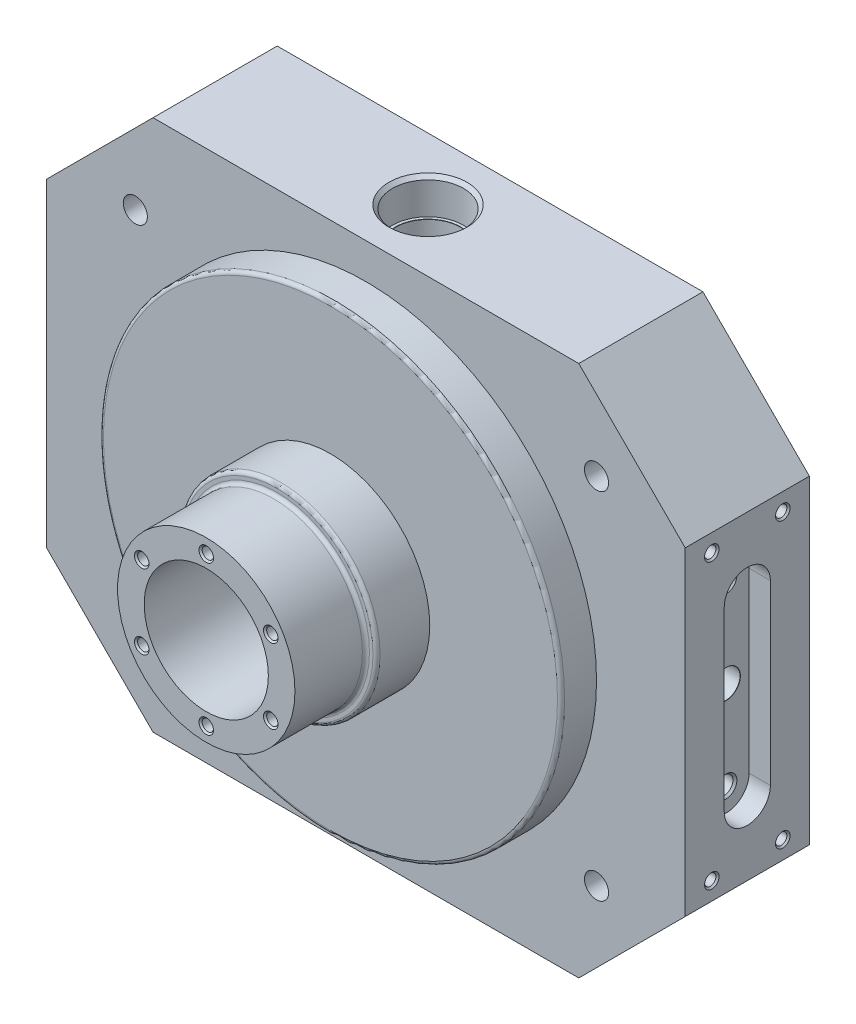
ISO-10303-21;
HEADER;
FILE_DESCRIPTION(('STEP AP214'),'2;1');
FILE_NAME('part.step','',(''),(''),'','','');
FILE_SCHEMA(('AUTOMOTIVE_DESIGN { 1 0 10303 214 1 1 1 1 }'));
ENDSEC;
DATA;
#1=APPLICATION_CONTEXT('core data for automotive mechanical design processes');
#2=APPLICATION_PROTOCOL_DEFINITION('international standard','automotive_design',2000,#1);
#3=PRODUCT_CONTEXT('',#1,'mechanical');
#4=PRODUCT('Part','Part','',(#3));
#5=PRODUCT_RELATED_PRODUCT_CATEGORY('part','',(#4));
#6=PRODUCT_DEFINITION_FORMATION('','',#4);
#7=PRODUCT_DEFINITION_CONTEXT('part definition',#1,'design');
#8=PRODUCT_DEFINITION('design','',#6,#7);
#9=PRODUCT_DEFINITION_SHAPE('','',#8);
#10=(LENGTH_UNIT() NAMED_UNIT(*) SI_UNIT(.MILLI.,.METRE.));
#11=(NAMED_UNIT(*) PLANE_ANGLE_UNIT() SI_UNIT($,.RADIAN.));
#12=(NAMED_UNIT(*) SI_UNIT($,.STERADIAN.) SOLID_ANGLE_UNIT());
#13=UNCERTAINTY_MEASURE_WITH_UNIT(LENGTH_MEASURE(1.E-05),#10,'distance_accuracy_value','');
#14=(GEOMETRIC_REPRESENTATION_CONTEXT(3) GLOBAL_UNCERTAINTY_ASSIGNED_CONTEXT((#13)) GLOBAL_UNIT_ASSIGNED_CONTEXT((#10,
#11,#12)) REPRESENTATION_CONTEXT('',''));
#15=CARTESIAN_POINT('',(0.,0.,0.));
#16=DIRECTION('',(0.,0.,1.));
#17=DIRECTION('',(1.,0.,0.));
#18=AXIS2_PLACEMENT_3D('',#15,#16,#17);
#19=CARTESIAN_POINT('',(59.8500001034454,29.9250000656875,19.5990369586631));
#20=DIRECTION('',(-1.,0.,0.));
#21=DIRECTION('',(0.,-1.,0.));
#22=AXIS2_PLACEMENT_3D('',#19,#20,#21);
#23=PLANE('',#22);
#24=CARTESIAN_POINT('',(59.8500001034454,26.6000000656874,1.3115369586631));
#25=DIRECTION('',(1.,0.,0.));
#26=DIRECTION('',(0.,0.,-1.));
#27=AXIS2_PLACEMENT_3D('',#24,#25,#26);
#28=CIRCLE('',#27,1.36325);
#29=CARTESIAN_POINT('',(59.8500001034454,26.6000000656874,-0.051713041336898));
#30=VERTEX_POINT('',#29);
#31=EDGE_CURVE('E244',#30,#30,#28,.T.);
#32=ORIENTED_EDGE('',*,*,#31,.F.);
#33=EDGE_LOOP('',(#32));
#34=FACE_BOUND('',#33,.T.);
#35=CARTESIAN_POINT('',(59.8500001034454,-26.5999999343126,14.6115369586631));
#36=DIRECTION('',(1.,0.,0.));
#37=DIRECTION('',(0.,0.,-1.));
#38=AXIS2_PLACEMENT_3D('',#35,#36,#37);
#39=CIRCLE('',#38,1.36325);
#40=CARTESIAN_POINT('',(59.8500001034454,-26.5999999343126,13.2482869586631));
#41=VERTEX_POINT('',#40);
#42=EDGE_CURVE('E577',#41,#41,#39,.T.);
#43=ORIENTED_EDGE('',*,*,#42,.F.);
#44=EDGE_LOOP('',(#43));
#45=FACE_BOUND('',#44,.T.);
#46=CARTESIAN_POINT('',(59.8500001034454,26.6000000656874,14.6115369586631));
#47=DIRECTION('',(1.,0.,0.));
#48=DIRECTION('',(0.,0.,-1.));
#49=AXIS2_PLACEMENT_3D('',#46,#47,#48);
#50=CIRCLE('',#49,1.36325);
#51=CARTESIAN_POINT('',(59.8500001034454,26.6000000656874,13.2482869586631));
#52=VERTEX_POINT('',#51);
#53=EDGE_CURVE('E565',#52,#52,#50,.T.);
#54=ORIENTED_EDGE('',*,*,#53,.F.);
#55=EDGE_LOOP('',(#54));
#56=FACE_BOUND('',#55,.T.);
#57=DIRECTION('',(0.,1.,0.));
#58=VECTOR('',#57,1.);
#59=CARTESIAN_POINT('',(59.8500001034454,29.9250000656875,-3.67596304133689));
#60=LINE('',#59,#58);
#61=CARTESIAN_POINT('',(59.8500001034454,-29.9249999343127,-3.67596304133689));
#62=VERTEX_POINT('',#61);
#63=CARTESIAN_POINT('',(59.8500001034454,29.9250000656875,-3.67596304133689));
#64=VERTEX_POINT('',#63);
#65=EDGE_CURVE('E635',#62,#64,#60,.T.);
#66=ORIENTED_EDGE('',*,*,#65,.T.);
#67=DIRECTION('',(0.,0.,-1.));
#68=VECTOR('',#67,1.);
#69=CARTESIAN_POINT('',(59.8500001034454,29.9250000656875,19.5990369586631));
#70=LINE('',#69,#68);
#71=CARTESIAN_POINT('',(59.8500001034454,29.9250000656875,19.5990369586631));
#72=VERTEX_POINT('',#71);
#73=EDGE_CURVE('E638',#72,#64,#70,.T.);
#74=ORIENTED_EDGE('',*,*,#73,.F.);
#75=DIRECTION('',(0.,1.,0.));
#76=VECTOR('',#75,1.);
#77=CARTESIAN_POINT('',(59.8500001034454,29.9250000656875,19.5990369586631));
#78=LINE('',#77,#76);
#79=CARTESIAN_POINT('',(59.8500001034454,-29.9249999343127,19.5990369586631));
#80=VERTEX_POINT('',#79);
#81=EDGE_CURVE('E770',#80,#72,#78,.T.);
#82=ORIENTED_EDGE('',*,*,#81,.F.);
#83=DIRECTION('',(0.,0.,-1.));
#84=VECTOR('',#83,1.);
#85=CARTESIAN_POINT('',(59.8500001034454,-29.9249999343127,19.5990369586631));
#86=LINE('',#85,#84);
#87=EDGE_CURVE('E641',#80,#62,#86,.T.);
#88=ORIENTED_EDGE('',*,*,#87,.T.);
#89=EDGE_LOOP('',(#66,#74,#82,#88));
#90=FACE_BOUND('',#89,.T.);
#91=CARTESIAN_POINT('',(59.8500001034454,-16.6249999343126,7.96153695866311));
#92=DIRECTION('',(-1.,0.,0.));
#93=DIRECTION('',(0.,0.,1.));
#94=AXIS2_PLACEMENT_3D('',#91,#92,#93);
#95=CIRCLE('',#94,4.3225);
#96=CARTESIAN_POINT('',(59.8500001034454,-16.6249999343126,3.63903695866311));
#97=VERTEX_POINT('',#96);
#98=CARTESIAN_POINT('',(59.8500001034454,-16.6249999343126,12.2840369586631));
#99=VERTEX_POINT('',#98);
#100=EDGE_CURVE('E75',#97,#99,#95,.T.);
#101=ORIENTED_EDGE('',*,*,#100,.T.);
#102=DIRECTION('',(0.,1.,0.));
#103=VECTOR('',#102,1.);
#104=CARTESIAN_POINT('',(59.8500001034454,-16.6249999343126,12.2840369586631));
#105=LINE('',#104,#103);
#106=CARTESIAN_POINT('',(59.8500001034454,16.6250000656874,12.2840369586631));
#107=VERTEX_POINT('',#106);
#108=EDGE_CURVE('E464',#99,#107,#105,.T.);
#109=ORIENTED_EDGE('',*,*,#108,.T.);
#110=CARTESIAN_POINT('',(59.8500001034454,16.6250000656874,7.96153695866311));
#111=DIRECTION('',(-1.,0.,0.));
#112=DIRECTION('',(0.,0.,1.));
#113=AXIS2_PLACEMENT_3D('',#110,#111,#112);
#114=CIRCLE('',#113,4.3225);
#115=CARTESIAN_POINT('',(59.8500001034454,16.6250000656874,3.63903695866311));
#116=VERTEX_POINT('',#115);
#117=EDGE_CURVE('E494',#107,#116,#114,.T.);
#118=ORIENTED_EDGE('',*,*,#117,.T.);
#119=DIRECTION('',(0.,-1.,0.));
#120=VECTOR('',#119,1.);
#121=CARTESIAN_POINT('',(59.8500001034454,-16.6249999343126,3.63903695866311));
#122=LINE('',#121,#120);
#123=EDGE_CURVE('E482',#116,#97,#122,.T.);
#124=ORIENTED_EDGE('',*,*,#123,.T.);
#125=EDGE_LOOP('',(#101,#109,#118,#124));
#126=FACE_BOUND('',#125,.T.);
#127=CARTESIAN_POINT('',(59.8500001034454,-26.5999999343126,1.3115369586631));
#128=DIRECTION('',(1.,0.,0.));
#129=DIRECTION('',(0.,0.,-1.));
#130=AXIS2_PLACEMENT_3D('',#127,#128,#129);
#131=CIRCLE('',#130,1.36325);
#132=CARTESIAN_POINT('',(59.8500001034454,-26.5999999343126,-0.051713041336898));
#133=VERTEX_POINT('',#132);
#134=EDGE_CURVE('E253',#133,#133,#131,.T.);
#135=ORIENTED_EDGE('',*,*,#134,.F.);
#136=EDGE_LOOP('',(#135));
#137=FACE_BOUND('',#136,.T.);
#138=ADVANCED_FACE('F58',(#34,#45,#56,#90,#126,#137),#23,.F.);
#139=CARTESIAN_POINT('',(-39.8999998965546,-49.8749999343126,19.5990369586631));
#140=DIRECTION('',(0.,1.,0.));
#141=DIRECTION('',(0.,0.,1.));
#142=AXIS2_PLACEMENT_3D('',#139,#140,#141);
#143=PLANE('',#142);
#144=CARTESIAN_POINT('',(1.03445390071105E-07,-49.8749999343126,7.96153695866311));
#145=DIRECTION('',(0.,1.,0.));
#146=DIRECTION('',(0.,0.,1.));
#147=AXIS2_PLACEMENT_3D('',#144,#145,#146);
#148=CIRCLE('',#147,7.31500000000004);
#149=CARTESIAN_POINT('',(1.03445390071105E-07,-49.8749999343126,15.2765369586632));
#150=VERTEX_POINT('',#149);
#151=EDGE_CURVE('E12',#150,#150,#148,.T.);
#152=ORIENTED_EDGE('',*,*,#151,.T.);
#153=EDGE_LOOP('',(#152));
#154=FACE_BOUND('',#153,.T.);
#155=DIRECTION('',(1.,0.,0.));
#156=VECTOR('',#155,1.);
#157=CARTESIAN_POINT('',(-39.8999998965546,-49.8749999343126,-3.67596304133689));
#158=LINE('',#157,#156);
#159=CARTESIAN_POINT('',(-39.8999998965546,-49.8749999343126,-3.67596304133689));
#160=VERTEX_POINT('',#159);
#161=CARTESIAN_POINT('',(39.9000001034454,-49.8749999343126,-3.67596304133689));
#162=VERTEX_POINT('',#161);
#163=EDGE_CURVE('E682',#160,#162,#158,.T.);
#164=ORIENTED_EDGE('',*,*,#163,.T.);
#165=DIRECTION('',(0.,0.,-1.));
#166=VECTOR('',#165,1.);
#167=CARTESIAN_POINT('',(39.9000001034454,-49.8749999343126,19.5990369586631));
#168=LINE('',#167,#166);
#169=CARTESIAN_POINT('',(39.9000001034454,-49.8749999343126,19.5990369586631));
#170=VERTEX_POINT('',#169);
#171=EDGE_CURVE('E732',#170,#162,#168,.T.);
#172=ORIENTED_EDGE('',*,*,#171,.F.);
#173=DIRECTION('',(1.,0.,0.));
#174=VECTOR('',#173,1.);
#175=CARTESIAN_POINT('',(-39.8999998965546,-49.8749999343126,19.5990369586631));
#176=LINE('',#175,#174);
#177=CARTESIAN_POINT('',(-39.8999998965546,-49.8749999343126,19.5990369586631));
#178=VERTEX_POINT('',#177);
#179=EDGE_CURVE('E700',#178,#170,#176,.T.);
#180=ORIENTED_EDGE('',*,*,#179,.F.);
#181=DIRECTION('',(0.,0.,-1.));
#182=VECTOR('',#181,1.);
#183=CARTESIAN_POINT('',(-39.8999998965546,-49.8749999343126,19.5990369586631));
#184=LINE('',#183,#182);
#185=EDGE_CURVE('E703',#178,#160,#184,.T.);
#186=ORIENTED_EDGE('',*,*,#185,.T.);
#187=EDGE_LOOP('',(#164,#172,#180,#186));
#188=FACE_BOUND('',#187,.T.);
#189=ADVANCED_FACE('F626',(#154,#188),#143,.F.);
#190=CARTESIAN_POINT('',(39.9000001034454,-49.8749999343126,19.5990369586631));
#191=DIRECTION('',(-0.707106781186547,0.707106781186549,0.));
#192=DIRECTION('',(-0.707106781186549,-0.707106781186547,0.));
#193=AXIS2_PLACEMENT_3D('',#190,#191,#192);
#194=PLANE('',#193);
#195=DIRECTION('',(0.707106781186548,0.707106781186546,0.));
#196=VECTOR('',#195,1.);
#197=CARTESIAN_POINT('',(39.9000001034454,-49.8749999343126,-3.67596304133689));
#198=LINE('',#197,#196);
#199=EDGE_CURVE('E646',#162,#62,#198,.T.);
#200=ORIENTED_EDGE('',*,*,#199,.T.);
#201=ORIENTED_EDGE('',*,*,#87,.F.);
#202=DIRECTION('',(0.707106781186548,0.707106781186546,0.));
#203=VECTOR('',#202,1.);
#204=CARTESIAN_POINT('',(39.9000001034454,-49.8749999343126,19.5990369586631));
#205=LINE('',#204,#203);
#206=EDGE_CURVE('E766',#170,#80,#205,.T.);
#207=ORIENTED_EDGE('',*,*,#206,.F.);
#208=ORIENTED_EDGE('',*,*,#171,.T.);
#209=EDGE_LOOP('',(#200,#201,#207,#208));
#210=FACE_BOUND('',#209,.T.);
#211=ADVANCED_FACE('F808',(#210),#194,.F.);
#212=CARTESIAN_POINT('',(39.9000001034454,49.8750000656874,19.5990369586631));
#213=DIRECTION('',(-0.707106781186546,-0.707106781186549,0.));
#214=DIRECTION('',(0.707106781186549,-0.707106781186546,0.));
#215=AXIS2_PLACEMENT_3D('',#212,#213,#214);
#216=PLANE('',#215);
#217=DIRECTION('',(-0.707106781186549,0.707106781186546,0.));
#218=VECTOR('',#217,1.);
#219=CARTESIAN_POINT('',(39.9000001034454,49.8750000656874,-3.67596304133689));
#220=LINE('',#219,#218);
#221=CARTESIAN_POINT('',(39.9000001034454,49.8750000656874,-3.67596304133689));
#222=VERTEX_POINT('',#221);
#223=EDGE_CURVE('E645',#64,#222,#220,.T.);
#224=ORIENTED_EDGE('',*,*,#223,.T.);
#225=DIRECTION('',(0.,0.,-1.));
#226=VECTOR('',#225,1.);
#227=CARTESIAN_POINT('',(39.9000001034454,49.8750000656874,19.5990369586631));
#228=LINE('',#227,#226);
#229=CARTESIAN_POINT('',(39.9000001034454,49.8750000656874,19.5990369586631));
#230=VERTEX_POINT('',#229);
#231=EDGE_CURVE('E654',#230,#222,#228,.T.);
#232=ORIENTED_EDGE('',*,*,#231,.F.);
#233=DIRECTION('',(-0.707106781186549,0.707106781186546,0.));
#234=VECTOR('',#233,1.);
#235=CARTESIAN_POINT('',(39.9000001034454,49.8750000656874,19.5990369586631));
#236=LINE('',#235,#234);
#237=EDGE_CURVE('E652',#72,#230,#236,.T.);
#238=ORIENTED_EDGE('',*,*,#237,.F.);
#239=ORIENTED_EDGE('',*,*,#73,.T.);
#240=EDGE_LOOP('',(#224,#232,#238,#239));
#241=FACE_BOUND('',#240,.T.);
#242=ADVANCED_FACE('F649',(#241),#216,.F.);
#243=CARTESIAN_POINT('',(-39.8999998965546,49.8750000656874,19.5990369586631));
#244=DIRECTION('',(0.,-1.,0.));
#245=DIRECTION('',(0.,0.,-1.));
#246=AXIS2_PLACEMENT_3D('',#243,#244,#245);
#247=PLANE('',#246);
#248=CARTESIAN_POINT('',(1.03445390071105E-07,49.8750000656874,7.96153695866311));
#249=DIRECTION('',(0.,1.,0.));
#250=DIRECTION('',(0.,0.,1.));
#251=AXIS2_PLACEMENT_3D('',#248,#249,#250);
#252=CIRCLE('',#251,7.31500000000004);
#253=CARTESIAN_POINT('',(1.03445390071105E-07,49.8750000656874,15.2765369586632));
#254=VERTEX_POINT('',#253);
#255=EDGE_CURVE('E325',#254,#254,#252,.T.);
#256=ORIENTED_EDGE('',*,*,#255,.F.);
#257=EDGE_LOOP('',(#256));
#258=FACE_BOUND('',#257,.T.);
#259=DIRECTION('',(-1.,0.,0.));
#260=VECTOR('',#259,1.);
#261=CARTESIAN_POINT('',(-39.8999998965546,49.8750000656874,-3.67596304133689));
#262=LINE('',#261,#260);
#263=CARTESIAN_POINT('',(-39.8999998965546,49.8750000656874,-3.67596304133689));
#264=VERTEX_POINT('',#263);
#265=EDGE_CURVE('E660',#222,#264,#262,.T.);
#266=ORIENTED_EDGE('',*,*,#265,.T.);
#267=DIRECTION('',(0.,0.,-1.));
#268=VECTOR('',#267,1.);
#269=CARTESIAN_POINT('',(-39.8999998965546,49.8750000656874,19.5990369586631));
#270=LINE('',#269,#268);
#271=CARTESIAN_POINT('',(-39.8999998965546,49.8750000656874,19.5990369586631));
#272=VERTEX_POINT('',#271);
#273=EDGE_CURVE('E716',#272,#264,#270,.T.);
#274=ORIENTED_EDGE('',*,*,#273,.F.);
#275=DIRECTION('',(-1.,0.,0.));
#276=VECTOR('',#275,1.);
#277=CARTESIAN_POINT('',(-39.8999998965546,49.8750000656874,19.5990369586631));
#278=LINE('',#277,#276);
#279=EDGE_CURVE('E780',#230,#272,#278,.T.);
#280=ORIENTED_EDGE('',*,*,#279,.F.);
#281=ORIENTED_EDGE('',*,*,#231,.T.);
#282=EDGE_LOOP('',(#266,#274,#280,#281));
#283=FACE_BOUND('',#282,.T.);
#284=ADVANCED_FACE('F1135',(#258,#283),#247,.F.);
#285=CARTESIAN_POINT('',(-59.8499998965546,29.9250000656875,19.5990369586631));
#286=DIRECTION('',(0.707106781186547,-0.707106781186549,0.));
#287=DIRECTION('',(0.707106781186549,0.707106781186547,0.));
#288=AXIS2_PLACEMENT_3D('',#285,#286,#287);
#289=PLANE('',#288);
#290=DIRECTION('',(-0.707106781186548,-0.707106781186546,0.));
#291=VECTOR('',#290,1.);
#292=CARTESIAN_POINT('',(-59.8499998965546,29.9250000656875,-3.67596304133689));
#293=LINE('',#292,#291);
#294=CARTESIAN_POINT('',(-59.8499998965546,29.9250000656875,-3.67596304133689));
#295=VERTEX_POINT('',#294);
#296=EDGE_CURVE('E664',#264,#295,#293,.T.);
#297=ORIENTED_EDGE('',*,*,#296,.T.);
#298=DIRECTION('',(0.,0.,-1.));
#299=VECTOR('',#298,1.);
#300=CARTESIAN_POINT('',(-59.8499998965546,29.9250000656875,19.5990369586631));
#301=LINE('',#300,#299);
#302=CARTESIAN_POINT('',(-59.8499998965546,29.9250000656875,19.5990369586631));
#303=VERTEX_POINT('',#302);
#304=EDGE_CURVE('E721',#303,#295,#301,.T.);
#305=ORIENTED_EDGE('',*,*,#304,.F.);
#306=DIRECTION('',(-0.707106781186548,-0.707106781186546,0.));
#307=VECTOR('',#306,1.);
#308=CARTESIAN_POINT('',(-59.8499998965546,29.9250000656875,19.5990369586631));
#309=LINE('',#308,#307);
#310=EDGE_CURVE('E784',#272,#303,#309,.T.);
#311=ORIENTED_EDGE('',*,*,#310,.F.);
#312=ORIENTED_EDGE('',*,*,#273,.T.);
#313=EDGE_LOOP('',(#297,#305,#311,#312));
#314=FACE_BOUND('',#313,.T.);
#315=ADVANCED_FACE('F1113',(#314),#289,.F.);
#316=CARTESIAN_POINT('',(-59.8499998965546,29.9250000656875,19.5990369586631));
#317=DIRECTION('',(1.,0.,0.));
#318=DIRECTION('',(0.,0.,-1.));
#319=AXIS2_PLACEMENT_3D('',#316,#317,#318);
#320=PLANE('',#319);
#321=CARTESIAN_POINT('',(-59.8499998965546,-26.5999999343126,1.3115369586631));
#322=DIRECTION('',(-1.,0.,0.));
#323=DIRECTION('',(0.,0.,1.));
#324=AXIS2_PLACEMENT_3D('',#321,#322,#323);
#325=CIRCLE('',#324,1.36325);
#326=CARTESIAN_POINT('',(-59.8499998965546,-26.5999999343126,2.67478695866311));
#327=VERTEX_POINT('',#326);
#328=EDGE_CURVE('E433',#327,#327,#325,.T.);
#329=ORIENTED_EDGE('',*,*,#328,.F.);
#330=EDGE_LOOP('',(#329));
#331=FACE_BOUND('',#330,.T.);
#332=CARTESIAN_POINT('',(-59.8499998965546,26.6000000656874,1.3115369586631));
#333=DIRECTION('',(-1.,0.,0.));
#334=DIRECTION('',(0.,0.,1.));
#335=AXIS2_PLACEMENT_3D('',#332,#333,#334);
#336=CIRCLE('',#335,1.36325);
#337=CARTESIAN_POINT('',(-59.8499998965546,26.6000000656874,2.67478695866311));
#338=VERTEX_POINT('',#337);
#339=EDGE_CURVE('E1090',#338,#338,#336,.T.);
#340=ORIENTED_EDGE('',*,*,#339,.F.);
#341=EDGE_LOOP('',(#340));
#342=FACE_BOUND('',#341,.T.);
#343=CARTESIAN_POINT('',(-59.8499998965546,-26.5999999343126,14.6115369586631));
#344=DIRECTION('',(-1.,0.,0.));
#345=DIRECTION('',(0.,0.,1.));
#346=AXIS2_PLACEMENT_3D('',#343,#344,#345);
#347=CIRCLE('',#346,1.36325);
#348=CARTESIAN_POINT('',(-59.8499998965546,-26.5999999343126,15.9747869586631));
#349=VERTEX_POINT('',#348);
#350=EDGE_CURVE('E1078',#349,#349,#347,.T.);
#351=ORIENTED_EDGE('',*,*,#350,.F.);
#352=EDGE_LOOP('',(#351));
#353=FACE_BOUND('',#352,.T.);
#354=CARTESIAN_POINT('',(-59.8499998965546,26.6000000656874,14.6115369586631));
#355=DIRECTION('',(-1.,0.,0.));
#356=DIRECTION('',(0.,0.,1.));
#357=AXIS2_PLACEMENT_3D('',#354,#355,#356);
#358=CIRCLE('',#357,1.36325);
#359=CARTESIAN_POINT('',(-59.8499998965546,26.6000000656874,15.9747869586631));
#360=VERTEX_POINT('',#359);
#361=EDGE_CURVE('E1066',#360,#360,#358,.T.);
#362=ORIENTED_EDGE('',*,*,#361,.F.);
#363=EDGE_LOOP('',(#362));
#364=FACE_BOUND('',#363,.T.);
#365=DIRECTION('',(0.,1.,0.));
#366=VECTOR('',#365,1.);
#367=CARTESIAN_POINT('',(-59.8499998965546,-16.6249999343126,12.2840369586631));
#368=LINE('',#367,#366);
#369=CARTESIAN_POINT('',(-59.8499998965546,-16.6249999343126,12.2840369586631));
#370=VERTEX_POINT('',#369);
#371=CARTESIAN_POINT('',(-59.8499998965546,16.6250000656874,12.2840369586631));
#372=VERTEX_POINT('',#371);
#373=EDGE_CURVE('E1015',#370,#372,#368,.T.);
#374=ORIENTED_EDGE('',*,*,#373,.F.);
#375=CARTESIAN_POINT('',(-59.8499998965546,-16.6249999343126,7.96153695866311));
#376=DIRECTION('',(-1.,0.,0.));
#377=DIRECTION('',(0.,0.,1.));
#378=AXIS2_PLACEMENT_3D('',#375,#376,#377);
#379=CIRCLE('',#378,4.3225);
#380=CARTESIAN_POINT('',(-59.8499998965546,-16.6249999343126,3.63903695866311));
#381=VERTEX_POINT('',#380);
#382=EDGE_CURVE('E83',#381,#370,#379,.T.);
#383=ORIENTED_EDGE('',*,*,#382,.F.);
#384=DIRECTION('',(0.,-1.,0.));
#385=VECTOR('',#384,1.);
#386=CARTESIAN_POINT('',(-59.8499998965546,-16.6249999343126,3.63903695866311));
#387=LINE('',#386,#385);
#388=CARTESIAN_POINT('',(-59.8499998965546,16.6250000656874,3.63903695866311));
#389=VERTEX_POINT('',#388);
#390=EDGE_CURVE('E416',#389,#381,#387,.T.);
#391=ORIENTED_EDGE('',*,*,#390,.F.);
#392=CARTESIAN_POINT('',(-59.8499998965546,16.6250000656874,7.96153695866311));
#393=DIRECTION('',(-1.,0.,0.));
#394=DIRECTION('',(0.,0.,1.));
#395=AXIS2_PLACEMENT_3D('',#392,#393,#394);
#396=CIRCLE('',#395,4.3225);
#397=EDGE_CURVE('E1010',#372,#389,#396,.T.);
#398=ORIENTED_EDGE('',*,*,#397,.F.);
#399=EDGE_LOOP('',(#374,#383,#391,#398));
#400=FACE_BOUND('',#399,.T.);
#401=DIRECTION('',(0.,-1.,0.));
#402=VECTOR('',#401,1.);
#403=CARTESIAN_POINT('',(-59.8499998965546,29.9250000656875,-3.67596304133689));
#404=LINE('',#403,#402);
#405=CARTESIAN_POINT('',(-59.8499998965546,-29.9249999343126,-3.67596304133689));
#406=VERTEX_POINT('',#405);
#407=EDGE_CURVE('E701',#295,#406,#404,.T.);
#408=ORIENTED_EDGE('',*,*,#407,.T.);
#409=DIRECTION('',(0.,0.,-1.));
#410=VECTOR('',#409,1.);
#411=CARTESIAN_POINT('',(-59.8499998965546,-29.9249999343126,19.5990369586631));
#412=LINE('',#411,#410);
#413=CARTESIAN_POINT('',(-59.8499998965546,-29.9249999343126,19.5990369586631));
#414=VERTEX_POINT('',#413);
#415=EDGE_CURVE('E708',#414,#406,#412,.T.);
#416=ORIENTED_EDGE('',*,*,#415,.F.);
#417=DIRECTION('',(0.,-1.,0.));
#418=VECTOR('',#417,1.);
#419=CARTESIAN_POINT('',(-59.8499998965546,29.9250000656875,19.5990369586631));
#420=LINE('',#419,#418);
#421=EDGE_CURVE('E787',#303,#414,#420,.T.);
#422=ORIENTED_EDGE('',*,*,#421,.F.);
#423=ORIENTED_EDGE('',*,*,#304,.T.);
#424=EDGE_LOOP('',(#408,#416,#422,#423));
#425=FACE_BOUND('',#424,.T.);
#426=ADVANCED_FACE('F1110',(#331,#342,#353,#364,#400,#425),#320,.F.);
#427=CARTESIAN_POINT('',(-59.8499998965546,-29.9249999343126,19.5990369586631));
#428=DIRECTION('',(0.707106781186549,0.707106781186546,0.));
#429=DIRECTION('',(-0.707106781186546,0.707106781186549,0.));
#430=AXIS2_PLACEMENT_3D('',#427,#428,#429);
#431=PLANE('',#430);
#432=DIRECTION('',(0.707106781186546,-0.707106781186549,0.));
#433=VECTOR('',#432,1.);
#434=CARTESIAN_POINT('',(-59.8499998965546,-29.9249999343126,-3.67596304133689));
#435=LINE('',#434,#433);
#436=EDGE_CURVE('E696',#406,#160,#435,.T.);
#437=ORIENTED_EDGE('',*,*,#436,.T.);
#438=ORIENTED_EDGE('',*,*,#185,.F.);
#439=DIRECTION('',(0.707106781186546,-0.707106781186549,0.));
#440=VECTOR('',#439,1.);
#441=CARTESIAN_POINT('',(-59.8499998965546,-29.9249999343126,19.5990369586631));
#442=LINE('',#441,#440);
#443=EDGE_CURVE('E688',#414,#178,#442,.T.);
#444=ORIENTED_EDGE('',*,*,#443,.F.);
#445=ORIENTED_EDGE('',*,*,#415,.T.);
#446=EDGE_LOOP('',(#437,#438,#444,#445));
#447=FACE_BOUND('',#446,.T.);
#448=ADVANCED_FACE('F804',(#447),#431,.F.);
#449=CARTESIAN_POINT('',(1.03445388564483E-07,6.56873982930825E-08,19.5990369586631));
#450=DIRECTION('',(0.,0.,-1.));
#451=DIRECTION('',(-1.,0.,0.));
#452=AXIS2_PLACEMENT_3D('',#449,#450,#451);
#453=PLANE('',#452);
#454=CARTESIAN_POINT('',(-43.2249998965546,-33.2499999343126,19.5990369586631));
#455=DIRECTION('',(0.,0.,-1.));
#456=DIRECTION('',(-1.,0.,0.));
#457=AXIS2_PLACEMENT_3D('',#454,#455,#456);
#458=CIRCLE('',#457,2.261);
#459=CARTESIAN_POINT('',(-45.4859998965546,-33.2499999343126,19.5990369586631));
#460=VERTEX_POINT('',#459);
#461=EDGE_CURVE('E917',#460,#460,#458,.T.);
#462=ORIENTED_EDGE('',*,*,#461,.T.);
#463=EDGE_LOOP('',(#462));
#464=FACE_BOUND('',#463,.T.);
#465=CARTESIAN_POINT('',(-43.2249998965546,33.2500000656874,19.5990369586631));
#466=DIRECTION('',(0.,0.,-1.));
#467=DIRECTION('',(-1.,0.,0.));
#468=AXIS2_PLACEMENT_3D('',#465,#466,#467);
#469=CIRCLE('',#468,2.261);
#470=CARTESIAN_POINT('',(-45.4859998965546,33.2500000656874,19.5990369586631));
#471=VERTEX_POINT('',#470);
#472=EDGE_CURVE('E895',#471,#471,#469,.T.);
#473=ORIENTED_EDGE('',*,*,#472,.T.);
#474=EDGE_LOOP('',(#473));
#475=FACE_BOUND('',#474,.T.);
#476=CARTESIAN_POINT('',(43.2250001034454,-33.2499999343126,19.5990369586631));
#477=DIRECTION('',(0.,0.,-1.));
#478=DIRECTION('',(-1.,0.,0.));
#479=AXIS2_PLACEMENT_3D('',#476,#477,#478);
#480=CIRCLE('',#479,2.261);
#481=CARTESIAN_POINT('',(40.9640001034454,-33.2499999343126,19.5990369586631));
#482=VERTEX_POINT('',#481);
#483=EDGE_CURVE('E874',#482,#482,#480,.T.);
#484=ORIENTED_EDGE('',*,*,#483,.T.);
#485=EDGE_LOOP('',(#484));
#486=FACE_BOUND('',#485,.T.);
#487=CARTESIAN_POINT('',(43.2250001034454,33.2500000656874,19.5990369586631));
#488=DIRECTION('',(0.,0.,-1.));
#489=DIRECTION('',(-1.,0.,0.));
#490=AXIS2_PLACEMENT_3D('',#487,#488,#489);
#491=CIRCLE('',#490,2.261);
#492=CARTESIAN_POINT('',(40.9640001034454,33.2500000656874,19.5990369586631));
#493=VERTEX_POINT('',#492);
#494=EDGE_CURVE('E342',#493,#493,#491,.T.);
#495=ORIENTED_EDGE('',*,*,#494,.T.);
#496=EDGE_LOOP('',(#495));
#497=FACE_BOUND('',#496,.T.);
#498=CARTESIAN_POINT('',(1.03445388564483E-07,6.56873982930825E-08,19.5990369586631));
#499=DIRECTION('',(0.,0.,1.));
#500=DIRECTION('',(1.,0.,0.));
#501=AXIS2_PLACEMENT_3D('',#498,#499,#500);
#502=CIRCLE('',#501,43.225);
#503=CARTESIAN_POINT('',(43.2250001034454,6.56873982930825E-08,19.5990369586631));
#504=VERTEX_POINT('',#503);
#505=EDGE_CURVE('E737',#504,#504,#502,.T.);
#506=ORIENTED_EDGE('',*,*,#505,.F.);
#507=EDGE_LOOP('',(#506));
#508=FACE_BOUND('',#507,.T.);
#509=ORIENTED_EDGE('',*,*,#179,.T.);
#510=ORIENTED_EDGE('',*,*,#206,.T.);
#511=ORIENTED_EDGE('',*,*,#81,.T.);
#512=ORIENTED_EDGE('',*,*,#237,.T.);
#513=ORIENTED_EDGE('',*,*,#279,.T.);
#514=ORIENTED_EDGE('',*,*,#310,.T.);
#515=ORIENTED_EDGE('',*,*,#421,.T.);
#516=ORIENTED_EDGE('',*,*,#443,.T.);
#517=EDGE_LOOP('',(#509,#510,#511,#512,#513,#514,#515,#516));
#518=FACE_BOUND('',#517,.T.);
#519=ADVANCED_FACE('F799',(#464,#475,#486,#497,#508,#518),#453,.F.);
#520=CARTESIAN_POINT('',(1.03445388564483E-07,6.56873982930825E-08,-3.67596304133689));
#521=DIRECTION('',(0.,0.,-1.));
#522=DIRECTION('',(-1.,0.,0.));
#523=AXIS2_PLACEMENT_3D('',#520,#521,#522);
#524=PLANE('',#523);
#525=CARTESIAN_POINT('',(-43.2249998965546,-33.2499999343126,-3.67596304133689));
#526=DIRECTION('',(0.,0.,-1.));
#527=DIRECTION('',(-1.,0.,0.));
#528=AXIS2_PLACEMENT_3D('',#525,#526,#527);
#529=CIRCLE('',#528,4.68825);
#530=CARTESIAN_POINT('',(-47.9132498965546,-33.2499999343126,-3.67596304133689));
#531=VERTEX_POINT('',#530);
#532=EDGE_CURVE('E935',#531,#531,#529,.T.);
#533=ORIENTED_EDGE('',*,*,#532,.F.);
#534=EDGE_LOOP('',(#533));
#535=FACE_BOUND('',#534,.T.);
#536=CARTESIAN_POINT('',(-43.2249998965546,33.2500000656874,-3.67596304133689));
#537=DIRECTION('',(0.,0.,-1.));
#538=DIRECTION('',(-1.,0.,0.));
#539=AXIS2_PLACEMENT_3D('',#536,#537,#538);
#540=CIRCLE('',#539,4.68825);
#541=CARTESIAN_POINT('',(-47.9132498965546,33.2500000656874,-3.67596304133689));
#542=VERTEX_POINT('',#541);
#543=EDGE_CURVE('E913',#542,#542,#540,.T.);
#544=ORIENTED_EDGE('',*,*,#543,.F.);
#545=EDGE_LOOP('',(#544));
#546=FACE_BOUND('',#545,.T.);
#547=CARTESIAN_POINT('',(43.2250001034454,-33.2499999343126,-3.67596304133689));
#548=DIRECTION('',(0.,0.,-1.));
#549=DIRECTION('',(-1.,0.,0.));
#550=AXIS2_PLACEMENT_3D('',#547,#548,#549);
#551=CIRCLE('',#550,4.68825);
#552=CARTESIAN_POINT('',(38.5367501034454,-33.2499999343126,-3.67596304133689));
#553=VERTEX_POINT('',#552);
#554=EDGE_CURVE('E891',#553,#553,#551,.T.);
#555=ORIENTED_EDGE('',*,*,#554,.F.);
#556=EDGE_LOOP('',(#555));
#557=FACE_BOUND('',#556,.T.);
#558=CARTESIAN_POINT('',(43.2250001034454,33.2500000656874,-3.67596304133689));
#559=DIRECTION('',(0.,0.,-1.));
#560=DIRECTION('',(-1.,0.,0.));
#561=AXIS2_PLACEMENT_3D('',#558,#559,#560);
#562=CIRCLE('',#561,4.68825);
#563=CARTESIAN_POINT('',(38.5367501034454,33.2500000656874,-3.67596304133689));
#564=VERTEX_POINT('',#563);
#565=EDGE_CURVE('E871',#564,#564,#562,.T.);
#566=ORIENTED_EDGE('',*,*,#565,.F.);
#567=EDGE_LOOP('',(#566));
#568=FACE_BOUND('',#567,.T.);
#569=CARTESIAN_POINT('',(1.03445388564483E-07,6.56873982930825E-08,-3.67596304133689));
#570=DIRECTION('',(0.,0.,1.));
#571=DIRECTION('',(1.,0.,0.));
#572=AXIS2_PLACEMENT_3D('',#569,#570,#571);
#573=CIRCLE('',#572,11.6375);
#574=CARTESIAN_POINT('',(11.6375001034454,6.56873982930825E-08,-3.67596304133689));
#575=VERTEX_POINT('',#574);
#576=EDGE_CURVE('E350',#575,#575,#573,.T.);
#577=ORIENTED_EDGE('',*,*,#576,.T.);
#578=EDGE_LOOP('',(#577));
#579=FACE_BOUND('',#578,.T.);
#580=ORIENTED_EDGE('',*,*,#163,.F.);
#581=ORIENTED_EDGE('',*,*,#436,.F.);
#582=ORIENTED_EDGE('',*,*,#407,.F.);
#583=ORIENTED_EDGE('',*,*,#296,.F.);
#584=ORIENTED_EDGE('',*,*,#265,.F.);
#585=ORIENTED_EDGE('',*,*,#223,.F.);
#586=ORIENTED_EDGE('',*,*,#65,.F.);
#587=ORIENTED_EDGE('',*,*,#199,.F.);
#588=EDGE_LOOP('',(#580,#581,#582,#583,#584,#585,#586,#587));
#589=FACE_BOUND('',#588,.T.);
#590=ADVANCED_FACE('F658',(#535,#546,#557,#568,#579,#589),#524,.T.);
#591=CARTESIAN_POINT('',(1.03445388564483E-07,6.56873982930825E-08,26.2490369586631));
#592=DIRECTION('',(0.,0.,-1.));
#593=DIRECTION('',(-1.,0.,0.));
#594=AXIS2_PLACEMENT_3D('',#591,#592,#593);
#595=CYLINDRICAL_SURFACE('',#594,43.225);
#596=CARTESIAN_POINT('',(1.03445388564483E-07,6.56873982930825E-08,25.5840369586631));
#597=DIRECTION('',(0.,0.,1.));
#598=DIRECTION('',(1.,0.,0.));
#599=AXIS2_PLACEMENT_3D('',#596,#597,#598);
#600=CIRCLE('',#599,43.225);
#601=CARTESIAN_POINT('',(43.2250001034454,6.56873982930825E-08,25.5840369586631));
#602=VERTEX_POINT('',#601);
#603=EDGE_CURVE('E744',#602,#602,#600,.F.);
#604=ORIENTED_EDGE('',*,*,#603,.T.);
#605=EDGE_LOOP('',(#604));
#606=FACE_BOUND('',#605,.T.);
#607=ORIENTED_EDGE('',*,*,#505,.T.);
#608=EDGE_LOOP('',(#607));
#609=FACE_BOUND('',#608,.T.);
#610=ADVANCED_FACE('F1189',(#606,#609),#595,.T.);
#611=CARTESIAN_POINT('',(1.03445388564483E-07,6.56873982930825E-08,26.2490369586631));
#612=DIRECTION('',(0.,0.,1.));
#613=DIRECTION('',(1.,0.,0.));
#614=AXIS2_PLACEMENT_3D('',#611,#612,#613);
#615=PLANE('',#614);
#616=CARTESIAN_POINT('',(1.03445388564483E-07,6.56873982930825E-08,26.2490369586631));
#617=DIRECTION('',(0.,0.,1.));
#618=DIRECTION('',(1.,0.,0.));
#619=AXIS2_PLACEMENT_3D('',#616,#617,#618);
#620=CIRCLE('',#619,42.56);
#621=CARTESIAN_POINT('',(42.5600001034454,6.56873982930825E-08,26.2490369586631));
#622=VERTEX_POINT('',#621);
#623=EDGE_CURVE('E739',#622,#622,#620,.T.);
#624=ORIENTED_EDGE('',*,*,#623,.T.);
#625=EDGE_LOOP('',(#624));
#626=FACE_BOUND('',#625,.T.);
#627=CARTESIAN_POINT('',(1.03445388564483E-07,6.56873982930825E-08,26.2490369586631));
#628=DIRECTION('',(0.,0.,1.));
#629=DIRECTION('',(1.,0.,0.));
#630=AXIS2_PLACEMENT_3D('',#627,#628,#629);
#631=CIRCLE('',#630,18.62);
#632=CARTESIAN_POINT('',(18.6200001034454,6.56873982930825E-08,26.2490369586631));
#633=VERTEX_POINT('',#632);
#634=EDGE_CURVE('E745',#633,#633,#631,.T.);
#635=ORIENTED_EDGE('',*,*,#634,.F.);
#636=EDGE_LOOP('',(#635));
#637=FACE_BOUND('',#636,.T.);
#638=ADVANCED_FACE('F1195',(#626,#637),#615,.T.);
#639=CARTESIAN_POINT('',(1.03445388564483E-07,6.56873982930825E-08,36.2240369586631));
#640=DIRECTION('',(0.,0.,-1.));
#641=DIRECTION('',(-1.,0.,0.));
#642=AXIS2_PLACEMENT_3D('',#639,#640,#641);
#643=CYLINDRICAL_SURFACE('',#642,18.62);
#644=CARTESIAN_POINT('',(1.03445388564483E-07,6.56873982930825E-08,35.5590369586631));
#645=DIRECTION('',(0.,0.,1.));
#646=DIRECTION('',(1.,0.,0.));
#647=AXIS2_PLACEMENT_3D('',#644,#645,#646);
#648=CIRCLE('',#647,18.62);
#649=CARTESIAN_POINT('',(18.6200001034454,6.56873982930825E-08,35.5590369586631));
#650=VERTEX_POINT('',#649);
#651=EDGE_CURVE('E844',#650,#650,#648,.F.);
#652=ORIENTED_EDGE('',*,*,#651,.T.);
#653=EDGE_LOOP('',(#652));
#654=FACE_BOUND('',#653,.T.);
#655=ORIENTED_EDGE('',*,*,#634,.T.);
#656=EDGE_LOOP('',(#655));
#657=FACE_BOUND('',#656,.T.);
#658=ADVANCED_FACE('F1200',(#654,#657),#643,.T.);
#659=CARTESIAN_POINT('',(1.03445388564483E-07,6.56873982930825E-08,36.2240369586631));
#660=DIRECTION('',(0.,0.,1.));
#661=DIRECTION('',(1.,0.,0.));
#662=AXIS2_PLACEMENT_3D('',#659,#660,#661);
#663=PLANE('',#662);
#664=CARTESIAN_POINT('',(1.03445388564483E-07,6.56873982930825E-08,36.2240369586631));
#665=DIRECTION('',(0.,0.,1.));
#666=DIRECTION('',(1.,0.,0.));
#667=AXIS2_PLACEMENT_3D('',#664,#665,#666);
#668=CIRCLE('',#667,17.955);
#669=CARTESIAN_POINT('',(17.9550001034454,6.56873982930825E-08,36.2240369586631));
#670=VERTEX_POINT('',#669);
#671=EDGE_CURVE('E839',#670,#670,#668,.T.);
#672=ORIENTED_EDGE('',*,*,#671,.T.);
#673=EDGE_LOOP('',(#672));
#674=FACE_BOUND('',#673,.T.);
#675=CARTESIAN_POINT('',(1.03445388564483E-07,6.56873982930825E-08,36.2240369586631));
#676=DIRECTION('',(0.,0.,1.));
#677=DIRECTION('',(1.,0.,0.));
#678=AXIS2_PLACEMENT_3D('',#675,#676,#677);
#679=CIRCLE('',#678,17.29);
#680=CARTESIAN_POINT('',(17.2900001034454,6.56873982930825E-08,36.2240369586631));
#681=VERTEX_POINT('',#680);
#682=EDGE_CURVE('E845',#681,#681,#679,.F.);
#683=ORIENTED_EDGE('',*,*,#682,.T.);
#684=EDGE_LOOP('',(#683));
#685=FACE_BOUND('',#684,.T.);
#686=ADVANCED_FACE('F1205',(#674,#685),#663,.T.);
#687=CARTESIAN_POINT('',(1.03445388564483E-07,6.56873982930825E-08,49.5240369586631));
#688=DIRECTION('',(0.,0.,-1.));
#689=DIRECTION('',(-1.,0.,0.));
#690=AXIS2_PLACEMENT_3D('',#687,#688,#689);
#691=CYLINDRICAL_SURFACE('',#690,16.625);
#692=CARTESIAN_POINT('',(1.03445388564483E-07,6.56873982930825E-08,36.8890369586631));
#693=DIRECTION('',(0.,0.,1.));
#694=DIRECTION('',(1.,0.,0.));
#695=AXIS2_PLACEMENT_3D('',#692,#693,#694);
#696=CIRCLE('',#695,16.625);
#697=CARTESIAN_POINT('',(16.6250001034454,6.56873982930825E-08,36.8890369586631));
#698=VERTEX_POINT('',#697);
#699=EDGE_CURVE('E1175',#698,#698,#696,.T.);
#700=ORIENTED_EDGE('',*,*,#699,.T.);
#701=EDGE_LOOP('',(#700));
#702=FACE_BOUND('',#701,.T.);
#703=CARTESIAN_POINT('',(1.03445388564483E-07,6.56873982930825E-08,49.5240369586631));
#704=DIRECTION('',(0.,0.,1.));
#705=DIRECTION('',(1.,0.,0.));
#706=AXIS2_PLACEMENT_3D('',#703,#704,#705);
#707=CIRCLE('',#706,16.625);
#708=CARTESIAN_POINT('',(16.6250001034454,6.56873982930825E-08,49.5240369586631));
#709=VERTEX_POINT('',#708);
#710=EDGE_CURVE('E687',#709,#709,#707,.T.);
#711=ORIENTED_EDGE('',*,*,#710,.F.);
#712=EDGE_LOOP('',(#711));
#713=FACE_BOUND('',#712,.T.);
#714=ADVANCED_FACE('F1211',(#702,#713),#691,.T.);
#715=CARTESIAN_POINT('',(1.03445388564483E-07,6.56873982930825E-08,49.5240369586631));
#716=DIRECTION('',(0.,0.,1.));
#717=DIRECTION('',(1.,0.,0.));
#718=AXIS2_PLACEMENT_3D('',#715,#716,#717);
#719=PLANE('',#718);
#720=CARTESIAN_POINT('',(1.03445388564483E-07,13.9650000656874,49.5240369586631));
#721=DIRECTION('',(0.,0.,1.));
#722=DIRECTION('',(1.,0.,0.));
#723=AXIS2_PLACEMENT_3D('',#720,#721,#722);
#724=CIRCLE('',#723,1.36325);
#725=CARTESIAN_POINT('',(1.36325010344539,13.9650000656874,49.5240369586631));
#726=VERTEX_POINT('',#725);
#727=EDGE_CURVE('E391',#726,#726,#724,.T.);
#728=ORIENTED_EDGE('',*,*,#727,.F.);
#729=EDGE_LOOP('',(#728));
#730=FACE_BOUND('',#729,.T.);
#731=CARTESIAN_POINT('',(12.0940448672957,6.98250006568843,49.5240369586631));
#732=DIRECTION('',(0.,0.,1.));
#733=DIRECTION('',(1.,0.,0.));
#734=AXIS2_PLACEMENT_3D('',#731,#732,#733);
#735=CIRCLE('',#734,1.36325);
#736=CARTESIAN_POINT('',(13.4572948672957,6.98250006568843,49.5240369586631));
#737=VERTEX_POINT('',#736);
#738=EDGE_CURVE('E362',#737,#737,#735,.T.);
#739=ORIENTED_EDGE('',*,*,#738,.F.);
#740=EDGE_LOOP('',(#739));
#741=FACE_BOUND('',#740,.T.);
#742=CARTESIAN_POINT('',(12.0940448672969,-6.98249993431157,49.5240369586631));
#743=DIRECTION('',(0.,0.,1.));
#744=DIRECTION('',(1.,0.,0.));
#745=AXIS2_PLACEMENT_3D('',#742,#743,#744);
#746=CIRCLE('',#745,1.36325);
#747=CARTESIAN_POINT('',(13.4572948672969,-6.98249993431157,49.5240369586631));
#748=VERTEX_POINT('',#747);
#749=EDGE_CURVE('E983',#748,#748,#746,.T.);
#750=ORIENTED_EDGE('',*,*,#749,.F.);
#751=EDGE_LOOP('',(#750));
#752=FACE_BOUND('',#751,.T.);
#753=CARTESIAN_POINT('',(1.03447758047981E-07,-13.9649999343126,49.5240369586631));
#754=DIRECTION('',(0.,0.,1.));
#755=DIRECTION('',(1.,0.,0.));
#756=AXIS2_PLACEMENT_3D('',#753,#754,#755);
#757=CIRCLE('',#756,1.36325);
#758=CARTESIAN_POINT('',(1.36325010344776,-13.9649999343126,49.5240369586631));
#759=VERTEX_POINT('',#758);
#760=EDGE_CURVE('E971',#759,#759,#757,.T.);
#761=ORIENTED_EDGE('',*,*,#760,.F.);
#762=EDGE_LOOP('',(#761));
#763=FACE_BOUND('',#762,.T.);
#764=CARTESIAN_POINT('',(-12.0940446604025,-6.98249993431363,49.5240369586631));
#765=DIRECTION('',(0.,0.,1.));
#766=DIRECTION('',(1.,0.,0.));
#767=AXIS2_PLACEMENT_3D('',#764,#765,#766);
#768=CIRCLE('',#767,1.36325);
#769=CARTESIAN_POINT('',(-10.7307946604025,-6.98249993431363,49.5240369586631));
#770=VERTEX_POINT('',#769);
#771=EDGE_CURVE('E959',#770,#770,#768,.T.);
#772=ORIENTED_EDGE('',*,*,#771,.F.);
#773=EDGE_LOOP('',(#772));
#774=FACE_BOUND('',#773,.T.);
#775=CARTESIAN_POINT('',(-12.0940446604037,6.98250006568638,49.5240369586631));
#776=DIRECTION('',(0.,0.,1.));
#777=DIRECTION('',(1.,0.,0.));
#778=AXIS2_PLACEMENT_3D('',#775,#776,#777);
#779=CIRCLE('',#778,1.36325);
#780=CARTESIAN_POINT('',(-10.7307946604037,6.98250006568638,49.5240369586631));
#781=VERTEX_POINT('',#780);
#782=EDGE_CURVE('E947',#781,#781,#779,.T.);
#783=ORIENTED_EDGE('',*,*,#782,.F.);
#784=EDGE_LOOP('',(#783));
#785=FACE_BOUND('',#784,.T.);
#786=CARTESIAN_POINT('',(1.03445388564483E-07,6.56873982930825E-08,49.5240369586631));
#787=DIRECTION('',(0.,0.,1.));
#788=DIRECTION('',(1.,0.,0.));
#789=AXIS2_PLACEMENT_3D('',#786,#787,#788);
#790=CIRCLE('',#789,11.6375);
#791=CARTESIAN_POINT('',(11.6375001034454,6.56873982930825E-08,49.5240369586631));
#792=VERTEX_POINT('',#791);
#793=EDGE_CURVE('E349',#792,#792,#790,.T.);
#794=ORIENTED_EDGE('',*,*,#793,.F.);
#795=EDGE_LOOP('',(#794));
#796=FACE_BOUND('',#795,.T.);
#797=ORIENTED_EDGE('',*,*,#710,.T.);
#798=EDGE_LOOP('',(#797));
#799=FACE_BOUND('',#798,.T.);
#800=ADVANCED_FACE('F1257',(#730,#741,#752,#763,#774,#785,#796,#799),#719,.T.);
#801=CARTESIAN_POINT('',(1.03445388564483E-07,6.56873982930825E-08,-3.67596304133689));
#802=DIRECTION('',(0.,0.,1.));
#803=DIRECTION('',(1.,0.,0.));
#804=AXIS2_PLACEMENT_3D('',#801,#802,#803);
#805=CYLINDRICAL_SURFACE('',#804,11.6375);
#806=CARTESIAN_POINT('',(1.03445390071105E-07,11.6375000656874,2.70803695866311));
#807=CARTESIAN_POINT('',(0.139716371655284,11.6374991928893,2.70803799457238));
#808=CARTESIAN_POINT('',(0.279465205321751,11.6349774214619,2.71361777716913));
#809=CARTESIAN_POINT('',(0.557954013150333,11.6249529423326,2.73588089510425));
#810=CARTESIAN_POINT('',(0.696693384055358,11.6174474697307,2.75257039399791));
#811=CARTESIAN_POINT('',(0.972323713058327,11.5976341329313,2.79691052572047));
#812=CARTESIAN_POINT('',(1.10921083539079,11.5853175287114,2.8245811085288));
#813=CARTESIAN_POINT('',(1.37994950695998,11.5561973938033,2.89059729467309));
#814=CARTESIAN_POINT('',(1.51379979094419,11.5393920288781,2.92894726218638));
#815=CARTESIAN_POINT('',(1.77699113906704,11.5017956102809,3.01576277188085));
#816=CARTESIAN_POINT('',(1.90634829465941,11.481021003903,3.06418664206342));
#817=CARTESIAN_POINT('',(2.16035447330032,11.4359500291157,3.17080287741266));
#818=CARTESIAN_POINT('',(2.2850017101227,11.4116523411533,3.22899890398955));
#819=CARTESIAN_POINT('',(2.65063791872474,11.3343447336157,3.41748376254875));
#820=CARTESIAN_POINT('',(2.88364788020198,11.2768714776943,3.56177805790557));
#821=CARTESIAN_POINT('',(3.33468479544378,11.1520859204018,3.89196246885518));
#822=CARTESIAN_POINT('',(3.55130147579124,11.0844172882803,4.07962613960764));
#823=CARTESIAN_POINT('',(3.95134707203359,10.9481926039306,4.48768019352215));
#824=CARTESIAN_POINT('',(4.13475557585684,10.8796360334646,4.70809055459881));
#825=CARTESIAN_POINT('',(4.3865743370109,10.7795285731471,5.06665369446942));
#826=CARTESIAN_POINT('',(4.46855476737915,10.7457119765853,5.19485716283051));
#827=CARTESIAN_POINT('',(4.6213413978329,10.6808934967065,5.45841215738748));
#828=CARTESIAN_POINT('',(4.692152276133,10.6498904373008,5.59376065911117));
#829=CARTESIAN_POINT('',(4.82197829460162,10.5917421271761,5.87079641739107));
#830=CARTESIAN_POINT('',(4.88099349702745,10.5645968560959,6.01248364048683));
#831=CARTESIAN_POINT('',(4.98658634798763,10.5151683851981,6.30116911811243));
#832=CARTESIAN_POINT('',(5.03317076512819,10.4928825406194,6.4481644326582));
#833=CARTESIAN_POINT('',(5.11123510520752,10.455068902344,6.73846105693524));
#834=CARTESIAN_POINT('',(5.14338651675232,10.4392447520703,6.88154312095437));
#835=CARTESIAN_POINT('',(5.19565088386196,10.4133315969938,7.17033895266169));
#836=CARTESIAN_POINT('',(5.21576970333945,10.4032397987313,7.3160514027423));
#837=CARTESIAN_POINT('',(5.24371343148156,10.3891830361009,7.60889131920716));
#838=CARTESIAN_POINT('',(5.25154295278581,10.3852157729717,7.75601823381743));
#839=CARTESIAN_POINT('',(5.25481008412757,10.3835632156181,8.05044002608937));
#840=CARTESIAN_POINT('',(5.25024853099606,10.3858774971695,8.19773489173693));
#841=CARTESIAN_POINT('',(5.22980438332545,10.3961851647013,8.47749021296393));
#842=CARTESIAN_POINT('',(5.21501746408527,10.4036286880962,8.61005283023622));
#843=CARTESIAN_POINT('',(5.17547807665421,10.4233547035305,8.87335942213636));
#844=CARTESIAN_POINT('',(5.1507223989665,10.4356387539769,9.0041027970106));
#845=CARTESIAN_POINT('',(5.09150959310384,10.4646559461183,9.2628433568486));
#846=CARTESIAN_POINT('',(5.05705434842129,10.4813882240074,9.39084106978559));
#847=CARTESIAN_POINT('',(4.97877676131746,10.5187957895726,9.64336561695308));
#848=CARTESIAN_POINT('',(4.93495078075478,10.5394726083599,9.76789108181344));
#849=CARTESIAN_POINT('',(4.78780039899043,10.6075575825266,10.1406478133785));
#850=CARTESIAN_POINT('',(4.67010463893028,10.6603484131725,10.3823990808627));
#851=CARTESIAN_POINT('',(4.40048882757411,10.7744356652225,10.8436350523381));
#852=CARTESIAN_POINT('',(4.24855417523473,10.8357357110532,11.0631101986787));
#853=CARTESIAN_POINT('',(3.89683408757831,10.9674431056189,11.4970125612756));
#854=CARTESIAN_POINT('',(3.69376834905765,11.038145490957,11.7086989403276));
#855=CARTESIAN_POINT('',(3.25430100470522,11.1755882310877,12.0960869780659));
#856=CARTESIAN_POINT('',(3.01788872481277,11.2423273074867,12.271777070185));
#857=CARTESIAN_POINT('',(2.63848775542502,11.3352362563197,12.5069522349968));
#858=CARTESIAN_POINT('',(2.50562274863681,11.3654147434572,12.5815400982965));
#859=CARTESIAN_POINT('',(2.23329330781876,11.4220446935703,12.7191521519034));
#860=CARTESIAN_POINT('',(2.09383162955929,11.4484976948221,12.7821811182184));
#861=CARTESIAN_POINT('',(1.80930533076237,11.4968973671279,12.8960233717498));
#862=CARTESIAN_POINT('',(1.66424241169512,11.5188453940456,12.9468403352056));
#863=CARTESIAN_POINT('',(1.36958466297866,11.5575825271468,13.0357039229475));
#864=CARTESIAN_POINT('',(1.21999024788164,11.5743721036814,13.073751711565));
#865=CARTESIAN_POINT('',(0.928363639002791,11.6012686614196,13.1343475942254));
#866=CARTESIAN_POINT('',(0.786557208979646,11.6117681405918,13.1578106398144));
#867=CARTESIAN_POINT('',(0.501215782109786,11.6275793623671,13.1930478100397));
#868=CARTESIAN_POINT('',(0.35768090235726,11.6328914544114,13.2048227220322));
#869=CARTESIAN_POINT('',(0.0700734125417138,11.6381776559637,13.2165403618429));
#870=CARTESIAN_POINT('',(-0.0739990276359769,11.6381533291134,13.2164865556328));
#871=CARTESIAN_POINT('',(-0.361550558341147,11.6327711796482,13.2045559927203));
#872=CARTESIAN_POINT('',(-0.505029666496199,11.6274135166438,13.1926795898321));
#873=CARTESIAN_POINT('',(-0.781587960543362,11.6119995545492,13.1583250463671));
#874=CARTESIAN_POINT('',(-0.914770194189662,11.6022478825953,13.1365334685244));
#875=CARTESIAN_POINT('',(-1.17873299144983,11.5784094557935,13.0828646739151));
#876=CARTESIAN_POINT('',(-1.30951276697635,11.5643213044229,13.0509842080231));
#877=CARTESIAN_POINT('',(-1.5677533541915,11.5321496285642,12.9774540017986));
#878=CARTESIAN_POINT('',(-1.69521512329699,11.5140672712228,12.9358071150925));
#879=CARTESIAN_POINT('',(-1.94611725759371,11.4743282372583,12.8431151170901));
#880=CARTESIAN_POINT('',(-2.06955606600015,11.4526701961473,12.7920664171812));
#881=CARTESIAN_POINT('',(-2.4402093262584,11.3816138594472,12.6219981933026));
#882=CARTESIAN_POINT('',(-2.6799118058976,11.3271482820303,12.4882932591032));
#883=CARTESIAN_POINT('',(-3.13421565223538,11.209966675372,12.1865215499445));
#884=CARTESIAN_POINT('',(-3.34880596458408,11.1472470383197,12.0184397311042));
#885=CARTESIAN_POINT('',(-3.7657083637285,11.0137459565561,11.6364668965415));
#886=CARTESIAN_POINT('',(-3.96552883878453,10.9427271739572,11.4199338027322));
#887=CARTESIAN_POINT('',(-4.32692738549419,10.8049347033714,10.955443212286));
#888=CARTESIAN_POINT('',(-4.48849049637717,10.7381626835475,10.7074734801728));
#889=CARTESIAN_POINT('',(-4.70038737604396,10.6463096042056,10.3128718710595));
#890=CARTESIAN_POINT('',(-4.7666046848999,10.6167447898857,10.1755999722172));
#891=CARTESIAN_POINT('',(-4.88710142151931,10.5618194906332,9.89512429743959));
#892=CARTESIAN_POINT('',(-4.94138615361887,10.5364571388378,9.75192319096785));
#893=CARTESIAN_POINT('',(-5.03739606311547,10.4908948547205,9.46067202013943));
#894=CARTESIAN_POINT('',(-5.07912894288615,10.4706917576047,9.31262499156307));
#895=CARTESIAN_POINT('',(-5.14954865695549,10.4362396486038,9.01278098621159));
#896=CARTESIAN_POINT('',(-5.17823703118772,10.4219899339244,8.8609844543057));
#897=CARTESIAN_POINT('',(-5.22025878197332,10.4010001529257,8.56824603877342));
#898=CARTESIAN_POINT('',(-5.23470649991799,10.3937167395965,8.42750217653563));
#899=CARTESIAN_POINT('',(-5.25219567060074,10.3848902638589,8.14513122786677));
#900=CARTESIAN_POINT('',(-5.25523790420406,10.38334680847,8.00350420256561));
#901=CARTESIAN_POINT('',(-5.2498768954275,10.3860583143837,7.72055288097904));
#902=CARTESIAN_POINT('',(-5.24147592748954,10.3903121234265,7.57922853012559));
#903=CARTESIAN_POINT('',(-5.21334393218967,10.4044556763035,7.29800296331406));
#904=CARTESIAN_POINT('',(-5.19361310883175,10.4143453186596,7.1581017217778));
#905=CARTESIAN_POINT('',(-5.14469241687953,10.4385937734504,6.88972128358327));
#906=CARTESIAN_POINT('',(-5.11619233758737,10.4526243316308,6.76108606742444));
#907=CARTESIAN_POINT('',(-5.04977936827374,10.4848694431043,6.5067921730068));
#908=CARTESIAN_POINT('',(-5.0118634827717,10.5030853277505,6.38113445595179));
#909=CARTESIAN_POINT('',(-4.88449257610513,10.5632393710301,6.00977496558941));
#910=CARTESIAN_POINT('',(-4.78138099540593,10.6107013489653,5.76950670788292));
#911=CARTESIAN_POINT('',(-4.53414304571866,10.7187781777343,5.29369548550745));
#912=CARTESIAN_POINT('',(-4.38779000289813,10.7800465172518,5.05947006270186));
#913=CARTESIAN_POINT('',(-4.06107231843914,10.9073312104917,4.61750338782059));
#914=CARTESIAN_POINT('',(-3.88069291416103,10.973349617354,4.40977369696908));
#915=CARTESIAN_POINT('',(-3.47139051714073,11.109965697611,4.00700167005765));
#916=CARTESIAN_POINT('',(-3.23953732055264,11.180430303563,3.81485498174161));
#917=CARTESIAN_POINT('',(-2.86857981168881,11.2791474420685,3.55775922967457));
#918=CARTESIAN_POINT('',(-2.74095017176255,11.3109130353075,3.47719476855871));
#919=CARTESIAN_POINT('',(-2.47867879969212,11.3712628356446,3.32707877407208));
#920=CARTESIAN_POINT('',(-2.34404034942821,11.3998485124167,3.25752214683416));
#921=CARTESIAN_POINT('',(-2.06985445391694,11.4527916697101,3.13063794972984));
#922=CARTESIAN_POINT('',(-1.93036261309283,11.4771851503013,3.07320517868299));
#923=CARTESIAN_POINT('',(-1.6463612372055,11.5213512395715,2.9703903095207));
#924=CARTESIAN_POINT('',(-1.50185416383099,11.5411260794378,2.92500239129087));
#925=CARTESIAN_POINT('',(-1.20923076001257,11.5754404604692,2.84686142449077));
#926=CARTESIAN_POINT('',(-1.06112387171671,11.5899923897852,2.81407846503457));
#927=CARTESIAN_POINT('',(-0.762267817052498,11.6134744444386,2.76142129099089));
#928=CARTESIAN_POINT('',(-0.611520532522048,11.6224084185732,2.74153823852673));
#929=CARTESIAN_POINT('',(-0.383666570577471,11.6314262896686,2.72150248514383));
#930=CARTESIAN_POINT('',(-0.307042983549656,11.6337019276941,2.71645510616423));
#931=CARTESIAN_POINT('',(-0.153616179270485,11.6367390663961,2.70972203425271));
#932=CARTESIAN_POINT('',(-0.0768129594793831,11.6375005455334,2.708036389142));
#933=CARTESIAN_POINT('',(1.03445390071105E-07,11.6375000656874,2.70803695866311));
#934=B_SPLINE_CURVE_WITH_KNOTS('',3,(#806,#807,#808,#809,#810,#811,#812,#813,#814,#815,#816,
#817,#818,#819,#820,#821,#822,#823,#824,#825,#826,#827,#828,#829,#830,#831,#832,#833,#834,#835,
#836,#837,#838,#839,#840,#841,#842,#843,#844,#845,#846,#847,#848,#849,#850,#851,#852,#853,#854,
#855,#856,#857,#858,#859,#860,#861,#862,#863,#864,#865,#866,#867,#868,#869,#870,#871,#872,#873,
#874,#875,#876,#877,#878,#879,#880,#881,#882,#883,#884,#885,#886,#887,#888,#889,#890,#891,#892,
#893,#894,#895,#896,#897,#898,#899,#900,#901,#902,#903,#904,#905,#906,#907,#908,#909,#910,#911,
#912,#913,#914,#915,#916,#917,#918,#919,#920,#921,#922,#923,#924,#925,#926,#927,#928,#929,#930,
#931,#932,#933),.UNSPECIFIED.,.T.,.F.,(4,2,2,2,2,2,2,2,2,2,2,2,2,2,2,2,2,2,2,2,2,2,2,2,2,2,2,2,
2,2,2,2,2,2,2,2,2,2,2,2,2,2,2,2,2,2,2,2,2,2,2,2,2,2,2,2,2,2,2,2,2,2,2,4),(0.,0.419071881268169,
0.838376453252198,1.2584463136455,1.67868808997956,2.09722486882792,2.51591881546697,
3.35227614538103,4.23214747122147,5.11255780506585,5.57972752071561,6.04670104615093,
6.51367210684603,6.98038837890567,7.42228571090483,7.8639675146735,8.30548349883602,
8.74696966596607,9.14727553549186,9.54771038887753,9.94806753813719,10.3485804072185,
11.1669466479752,11.985662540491,12.8869381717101,13.788502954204,14.2539787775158,
14.7192618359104,15.1844046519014,15.6495050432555,16.0812937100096,16.5130532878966,
16.9446863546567,17.3763065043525,17.7817531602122,18.1873305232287,18.5927895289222,
18.9984036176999,19.8340224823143,20.6700078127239,21.5752787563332,22.4809031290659,
22.9461302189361,23.4111500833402,23.8758840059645,24.3405630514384,24.7650121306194,
25.1894321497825,25.613767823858,26.0380958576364,26.4351397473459,26.8323101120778,
27.6261050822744,28.4713920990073,29.3170466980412,30.2400051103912,30.7022429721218,
31.1642663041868,31.6220988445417,32.07970975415,32.5362279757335,32.9924331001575,
33.2228267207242,33.4532236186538),.UNSPECIFIED.);
#935=CARTESIAN_POINT('',(1.03445390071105E-07,11.6375000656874,2.70803695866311));
#936=VERTEX_POINT('',#935);
#937=EDGE_CURVE('E315',#936,#936,#934,.T.);
#938=ORIENTED_EDGE('',*,*,#937,.F.);
#939=EDGE_LOOP('',(#938));
#940=FACE_BOUND('',#939,.T.);
#941=CARTESIAN_POINT('',(1.03445390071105E-07,-11.6374999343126,2.70803695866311));
#942=CARTESIAN_POINT('',(0.139716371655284,-11.6374990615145,2.70803799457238));
#943=CARTESIAN_POINT('',(0.279465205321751,-11.6349772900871,2.71361777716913));
#944=CARTESIAN_POINT('',(0.557954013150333,-11.6249528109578,2.73588089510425));
#945=CARTESIAN_POINT('',(0.696693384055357,-11.6174473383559,2.75257039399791));
#946=CARTESIAN_POINT('',(0.972323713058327,-11.5976340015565,2.79691052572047));
#947=CARTESIAN_POINT('',(1.10921083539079,-11.5853173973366,2.8245811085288));
#948=CARTESIAN_POINT('',(1.37994950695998,-11.5561972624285,2.89059729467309));
#949=CARTESIAN_POINT('',(1.51379979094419,-11.5393918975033,2.92894726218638));
#950=CARTESIAN_POINT('',(1.77699113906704,-11.5017954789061,3.01576277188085));
#951=CARTESIAN_POINT('',(1.90634829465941,-11.4810208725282,3.06418664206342));
#952=CARTESIAN_POINT('',(2.16035447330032,-11.4359498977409,3.17080287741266));
#953=CARTESIAN_POINT('',(2.2850017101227,-11.4116522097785,3.22899890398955));
#954=CARTESIAN_POINT('',(2.65063791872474,-11.3343446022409,3.41748376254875));
#955=CARTESIAN_POINT('',(2.88364788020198,-11.2768713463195,3.56177805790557));
#956=CARTESIAN_POINT('',(3.33468479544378,-11.152085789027,3.89196246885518));
#957=CARTESIAN_POINT('',(3.55130147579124,-11.0844171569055,4.07962613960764));
#958=CARTESIAN_POINT('',(3.95134707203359,-10.9481924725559,4.48768019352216));
#959=CARTESIAN_POINT('',(4.13475557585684,-10.8796359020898,4.70809055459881));
#960=CARTESIAN_POINT('',(4.3865743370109,-10.7795284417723,5.06665369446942));
#961=CARTESIAN_POINT('',(4.46855476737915,-10.7457118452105,5.1948571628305));
#962=CARTESIAN_POINT('',(4.6213413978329,-10.6808933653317,5.45841215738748));
#963=CARTESIAN_POINT('',(4.692152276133,-10.649890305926,5.59376065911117));
#964=CARTESIAN_POINT('',(4.82197829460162,-10.5917419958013,5.87079641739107));
#965=CARTESIAN_POINT('',(4.88099349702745,-10.5645967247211,6.01248364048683));
#966=CARTESIAN_POINT('',(4.98658634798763,-10.5151682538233,6.30116911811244));
#967=CARTESIAN_POINT('',(5.03317076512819,-10.4928824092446,6.4481644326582));
#968=CARTESIAN_POINT('',(5.11123510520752,-10.4550687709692,6.73846105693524));
#969=CARTESIAN_POINT('',(5.14338651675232,-10.4392446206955,6.88154312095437));
#970=CARTESIAN_POINT('',(5.19565088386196,-10.413331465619,7.17033895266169));
#971=CARTESIAN_POINT('',(5.21576970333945,-10.4032396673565,7.3160514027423));
#972=CARTESIAN_POINT('',(5.24371343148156,-10.3891829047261,7.60889131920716));
#973=CARTESIAN_POINT('',(5.25154295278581,-10.3852156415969,7.75601823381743));
#974=CARTESIAN_POINT('',(5.25481008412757,-10.3835630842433,8.05044002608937));
#975=CARTESIAN_POINT('',(5.25024853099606,-10.3858773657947,8.19773489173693));
#976=CARTESIAN_POINT('',(5.22980438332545,-10.3961850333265,8.47749021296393));
#977=CARTESIAN_POINT('',(5.21501746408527,-10.4036285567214,8.61005283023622));
#978=CARTESIAN_POINT('',(5.17547807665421,-10.4233545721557,8.87335942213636));
#979=CARTESIAN_POINT('',(5.1507223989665,-10.4356386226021,9.0041027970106));
#980=CARTESIAN_POINT('',(5.09150959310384,-10.4646558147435,9.2628433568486));
#981=CARTESIAN_POINT('',(5.05705434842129,-10.4813880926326,9.39084106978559));
#982=CARTESIAN_POINT('',(4.97877676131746,-10.5187956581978,9.64336561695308));
#983=CARTESIAN_POINT('',(4.93495078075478,-10.5394724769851,9.76789108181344));
#984=CARTESIAN_POINT('',(4.78780039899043,-10.6075574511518,10.1406478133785));
#985=CARTESIAN_POINT('',(4.67010463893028,-10.6603482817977,10.3823990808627));
#986=CARTESIAN_POINT('',(4.40048882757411,-10.7744355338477,10.8436350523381));
#987=CARTESIAN_POINT('',(4.24855417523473,-10.8357355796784,11.0631101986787));
#988=CARTESIAN_POINT('',(3.89683408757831,-10.9674429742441,11.4970125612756));
#989=CARTESIAN_POINT('',(3.69376834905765,-11.0381453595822,11.7086989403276));
#990=CARTESIAN_POINT('',(3.25430100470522,-11.1755880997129,12.0960869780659));
#991=CARTESIAN_POINT('',(3.01788872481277,-11.2423271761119,12.271777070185));
#992=CARTESIAN_POINT('',(2.63848775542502,-11.3352361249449,12.5069522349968));
#993=CARTESIAN_POINT('',(2.50562274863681,-11.3654146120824,12.5815400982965));
#994=CARTESIAN_POINT('',(2.23329330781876,-11.4220445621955,12.7191521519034));
#995=CARTESIAN_POINT('',(2.09383162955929,-11.4484975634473,12.7821811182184));
#996=CARTESIAN_POINT('',(1.80930533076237,-11.4968972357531,12.8960233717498));
#997=CARTESIAN_POINT('',(1.66424241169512,-11.5188452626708,12.9468403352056));
#998=CARTESIAN_POINT('',(1.36958466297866,-11.557582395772,13.0357039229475));
#999=CARTESIAN_POINT('',(1.21999024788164,-11.5743719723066,13.073751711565));
#1000=CARTESIAN_POINT('',(0.92836363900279,-11.6012685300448,13.1343475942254));
#1001=CARTESIAN_POINT('',(0.786557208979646,-11.611768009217,13.1578106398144));
#1002=CARTESIAN_POINT('',(0.501215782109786,-11.6275792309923,13.1930478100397));
#1003=CARTESIAN_POINT('',(0.35768090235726,-11.6328913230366,13.2048227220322));
#1004=CARTESIAN_POINT('',(0.0700734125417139,-11.6381775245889,13.2165403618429));
#1005=CARTESIAN_POINT('',(-0.0739990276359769,-11.6381531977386,13.2164865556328));
#1006=CARTESIAN_POINT('',(-0.361550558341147,-11.6327710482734,13.2045559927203));
#1007=CARTESIAN_POINT('',(-0.505029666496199,-11.627413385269,13.1926795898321));
#1008=CARTESIAN_POINT('',(-0.781587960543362,-11.6119994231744,13.1583250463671));
#1009=CARTESIAN_POINT('',(-0.914770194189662,-11.6022477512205,13.1365334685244));
#1010=CARTESIAN_POINT('',(-1.17873299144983,-11.5784093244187,13.0828646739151));
#1011=CARTESIAN_POINT('',(-1.30951276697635,-11.5643211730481,13.0509842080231));
#1012=CARTESIAN_POINT('',(-1.5677533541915,-11.5321494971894,12.9774540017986));
#1013=CARTESIAN_POINT('',(-1.69521512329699,-11.514067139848,12.9358071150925));
#1014=CARTESIAN_POINT('',(-1.94611725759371,-11.4743281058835,12.8431151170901));
#1015=CARTESIAN_POINT('',(-2.06955606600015,-11.4526700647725,12.7920664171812));
#1016=CARTESIAN_POINT('',(-2.4402093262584,-11.3816137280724,12.6219981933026));
#1017=CARTESIAN_POINT('',(-2.6799118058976,-11.3271481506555,12.4882932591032));
#1018=CARTESIAN_POINT('',(-3.13421565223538,-11.2099665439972,12.1865215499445));
#1019=CARTESIAN_POINT('',(-3.34880596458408,-11.1472469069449,12.0184397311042));
#1020=CARTESIAN_POINT('',(-3.7657083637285,-11.0137458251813,11.6364668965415));
#1021=CARTESIAN_POINT('',(-3.96552883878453,-10.9427270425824,11.4199338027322));
#1022=CARTESIAN_POINT('',(-4.32692738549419,-10.8049345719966,10.955443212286));
#1023=CARTESIAN_POINT('',(-4.48849049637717,-10.7381625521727,10.7074734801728));
#1024=CARTESIAN_POINT('',(-4.70038737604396,-10.6463094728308,10.3128718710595));
#1025=CARTESIAN_POINT('',(-4.7666046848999,-10.6167446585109,10.1755999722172));
#1026=CARTESIAN_POINT('',(-4.88710142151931,-10.5618193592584,9.89512429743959));
#1027=CARTESIAN_POINT('',(-4.94138615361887,-10.536457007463,9.75192319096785));
#1028=CARTESIAN_POINT('',(-5.03739606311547,-10.4908947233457,9.46067202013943));
#1029=CARTESIAN_POINT('',(-5.07912894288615,-10.4706916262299,9.31262499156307));
#1030=CARTESIAN_POINT('',(-5.14954865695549,-10.436239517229,9.01278098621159));
#1031=CARTESIAN_POINT('',(-5.17823703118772,-10.4219898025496,8.8609844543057));
#1032=CARTESIAN_POINT('',(-5.22025878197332,-10.4010000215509,8.56824603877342));
#1033=CARTESIAN_POINT('',(-5.23470649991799,-10.3937166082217,8.42750217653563));
#1034=CARTESIAN_POINT('',(-5.25219567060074,-10.3848901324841,8.14513122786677));
#1035=CARTESIAN_POINT('',(-5.25523790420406,-10.3833466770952,8.00350420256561));
#1036=CARTESIAN_POINT('',(-5.2498768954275,-10.3860581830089,7.72055288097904));
#1037=CARTESIAN_POINT('',(-5.24147592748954,-10.3903119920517,7.57922853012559));
#1038=CARTESIAN_POINT('',(-5.21334393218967,-10.4044555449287,7.29800296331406));
#1039=CARTESIAN_POINT('',(-5.19361310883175,-10.4143451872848,7.1581017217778));
#1040=CARTESIAN_POINT('',(-5.14469241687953,-10.4385936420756,6.88972128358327));
#1041=CARTESIAN_POINT('',(-5.11619233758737,-10.452624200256,6.76108606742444));
#1042=CARTESIAN_POINT('',(-5.04977936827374,-10.4848693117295,6.5067921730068));
#1043=CARTESIAN_POINT('',(-5.0118634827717,-10.5030851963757,6.38113445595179));
#1044=CARTESIAN_POINT('',(-4.88449257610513,-10.5632392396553,6.00977496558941));
#1045=CARTESIAN_POINT('',(-4.78138099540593,-10.6107012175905,5.76950670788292));
#1046=CARTESIAN_POINT('',(-4.53414304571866,-10.7187780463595,5.29369548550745));
#1047=CARTESIAN_POINT('',(-4.38779000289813,-10.780046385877,5.05947006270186));
#1048=CARTESIAN_POINT('',(-4.06107231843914,-10.9073310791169,4.61750338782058));
#1049=CARTESIAN_POINT('',(-3.88069291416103,-10.9733494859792,4.40977369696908));
#1050=CARTESIAN_POINT('',(-3.47139051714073,-11.1099655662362,4.00700167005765));
#1051=CARTESIAN_POINT('',(-3.23953732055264,-11.1804301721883,3.81485498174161));
#1052=CARTESIAN_POINT('',(-2.86857981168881,-11.2791473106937,3.55775922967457));
#1053=CARTESIAN_POINT('',(-2.74095017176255,-11.3109129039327,3.47719476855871));
#1054=CARTESIAN_POINT('',(-2.47867879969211,-11.3712627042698,3.32707877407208));
#1055=CARTESIAN_POINT('',(-2.34404034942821,-11.3998483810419,3.25752214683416));
#1056=CARTESIAN_POINT('',(-2.06985445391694,-11.4527915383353,3.13063794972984));
#1057=CARTESIAN_POINT('',(-1.93036261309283,-11.4771850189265,3.07320517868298));
#1058=CARTESIAN_POINT('',(-1.6463612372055,-11.5213511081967,2.9703903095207));
#1059=CARTESIAN_POINT('',(-1.50185416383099,-11.541125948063,2.92500239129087));
#1060=CARTESIAN_POINT('',(-1.20923076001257,-11.5754403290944,2.84686142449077));
#1061=CARTESIAN_POINT('',(-1.06112387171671,-11.5899922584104,2.81407846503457));
#1062=CARTESIAN_POINT('',(-0.762267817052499,-11.6134743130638,2.76142129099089));
#1063=CARTESIAN_POINT('',(-0.611520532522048,-11.6224082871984,2.74153823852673));
#1064=CARTESIAN_POINT('',(-0.383666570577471,-11.6314261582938,2.72150248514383));
#1065=CARTESIAN_POINT('',(-0.307042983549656,-11.6337017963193,2.71645510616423));
#1066=CARTESIAN_POINT('',(-0.153616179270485,-11.6367389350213,2.70972203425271));
#1067=CARTESIAN_POINT('',(-0.0768129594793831,-11.6375004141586,2.708036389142));
#1068=CARTESIAN_POINT('',(1.03445390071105E-07,-11.6374999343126,2.70803695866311));
#1069=B_SPLINE_CURVE_WITH_KNOTS('',3,(#941,#942,#943,#944,#945,#946,#947,#948,#949,#950,#951,
#952,#953,#954,#955,#956,#957,#958,#959,#960,#961,#962,#963,#964,#965,#966,#967,#968,#969,#970,
#971,#972,#973,#974,#975,#976,#977,#978,#979,#980,#981,#982,#983,#984,#985,#986,#987,#988,#989,
#990,#991,#992,#993,#994,#995,#996,#997,#998,#999,#1000,#1001,#1002,#1003,#1004,#1005,#1006,
#1007,#1008,#1009,#1010,#1011,#1012,#1013,#1014,#1015,#1016,#1017,#1018,#1019,#1020,#1021,#1022,
#1023,#1024,#1025,#1026,#1027,#1028,#1029,#1030,#1031,#1032,#1033,#1034,#1035,#1036,#1037,#1038,
#1039,#1040,#1041,#1042,#1043,#1044,#1045,#1046,#1047,#1048,#1049,#1050,#1051,#1052,#1053,#1054,
#1055,#1056,#1057,#1058,#1059,#1060,#1061,#1062,#1063,#1064,#1065,#1066,#1067,#1068),
.UNSPECIFIED.,.T.,.F.,(4,2,2,2,2,2,2,2,2,2,2,2,2,2,2,2,2,2,2,2,2,2,2,2,2,2,2,2,2,2,2,2,2,2,2,2,
2,2,2,2,2,2,2,2,2,2,2,2,2,2,2,2,2,2,2,2,2,2,2,2,2,2,2,4),(0.,0.419071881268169,
0.838376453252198,1.2584463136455,1.67868808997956,2.09722486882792,2.51591881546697,
3.35227614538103,4.23214747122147,5.11255780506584,5.57972752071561,6.04670104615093,
6.51367210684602,6.98038837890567,7.42228571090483,7.86396751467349,8.30548349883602,
8.74696966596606,9.14727553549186,9.54771038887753,9.94806753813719,10.3485804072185,
11.1669466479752,11.985662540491,12.8869381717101,13.788502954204,14.2539787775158,
14.7192618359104,15.1844046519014,15.6495050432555,16.0812937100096,16.5130532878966,
16.9446863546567,17.3763065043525,17.7817531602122,18.1873305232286,18.5927895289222,
18.9984036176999,19.8340224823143,20.6700078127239,21.5752787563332,22.4809031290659,
22.9461302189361,23.4111500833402,23.8758840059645,24.3405630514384,24.7650121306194,
25.1894321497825,25.613767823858,26.0380958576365,26.4351397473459,26.8323101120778,
27.6261050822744,28.4713920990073,29.3170466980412,30.2400051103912,30.7022429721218,
31.1642663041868,31.6220988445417,32.07970975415,32.5362279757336,32.9924331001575,
33.2228267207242,33.4532236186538),.UNSPECIFIED.);
#1070=CARTESIAN_POINT('',(1.03445390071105E-07,-11.6374999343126,2.70803695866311));
#1071=VERTEX_POINT('',#1070);
#1072=EDGE_CURVE('E276',#1071,#1071,#1069,.T.);
#1073=ORIENTED_EDGE('',*,*,#1072,.T.);
#1074=EDGE_LOOP('',(#1073));
#1075=FACE_BOUND('',#1074,.T.);
#1076=ORIENTED_EDGE('',*,*,#576,.F.);
#1077=EDGE_LOOP('',(#1076));
#1078=FACE_BOUND('',#1077,.T.);
#1079=ORIENTED_EDGE('',*,*,#793,.T.);
#1080=EDGE_LOOP('',(#1079));
#1081=FACE_BOUND('',#1080,.T.);
#1082=ADVANCED_FACE('F1156',(#940,#1075,#1078,#1081),#805,.F.);
#1083=CARTESIAN_POINT('',(1.03445388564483E-07,6.56873982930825E-08,25.5840369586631));
#1084=DIRECTION('',(0.,0.,1.));
#1085=DIRECTION('',(1.,0.,0.));
#1086=AXIS2_PLACEMENT_3D('',#1083,#1084,#1085);
#1087=TOROIDAL_SURFACE('',#1086,42.56,0.665);
#1088=ORIENTED_EDGE('',*,*,#603,.F.);
#1089=EDGE_LOOP('',(#1088));
#1090=FACE_BOUND('',#1089,.T.);
#1091=ORIENTED_EDGE('',*,*,#623,.F.);
#1092=EDGE_LOOP('',(#1091));
#1093=FACE_BOUND('',#1092,.T.);
#1094=ADVANCED_FACE('F1152',(#1090,#1093),#1087,.T.);
#1095=CARTESIAN_POINT('',(1.03445388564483E-07,6.56873982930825E-08,35.5590369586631));
#1096=DIRECTION('',(0.,0.,1.));
#1097=DIRECTION('',(1.,0.,0.));
#1098=AXIS2_PLACEMENT_3D('',#1095,#1096,#1097);
#1099=TOROIDAL_SURFACE('',#1098,17.955,0.665);
#1100=ORIENTED_EDGE('',*,*,#651,.F.);
#1101=EDGE_LOOP('',(#1100));
#1102=FACE_BOUND('',#1101,.T.);
#1103=ORIENTED_EDGE('',*,*,#671,.F.);
#1104=EDGE_LOOP('',(#1103));
#1105=FACE_BOUND('',#1104,.T.);
#1106=ADVANCED_FACE('F1155',(#1102,#1105),#1099,.T.);
#1107=CARTESIAN_POINT('',(1.03445388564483E-07,6.56873982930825E-08,36.8890369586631));
#1108=DIRECTION('',(0.,0.,1.));
#1109=DIRECTION('',(1.,0.,0.));
#1110=AXIS2_PLACEMENT_3D('',#1107,#1108,#1109);
#1111=TOROIDAL_SURFACE('',#1110,17.29,0.665);
#1112=ORIENTED_EDGE('',*,*,#682,.F.);
#1113=EDGE_LOOP('',(#1112));
#1114=FACE_BOUND('',#1113,.T.);
#1115=ORIENTED_EDGE('',*,*,#699,.F.);
#1116=EDGE_LOOP('',(#1115));
#1117=FACE_BOUND('',#1116,.T.);
#1118=ADVANCED_FACE('F1159',(#1114,#1117),#1111,.F.);
#1119=CARTESIAN_POINT('',(43.2250001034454,33.2500000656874,-3.67596304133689));
#1120=DIRECTION('',(0.,0.,-1.));
#1121=DIRECTION('',(-1.,0.,0.));
#1122=AXIS2_PLACEMENT_3D('',#1119,#1120,#1121);
#1123=CYLINDRICAL_SURFACE('',#1122,2.261);
#1124=ORIENTED_EDGE('',*,*,#494,.F.);
#1125=EDGE_LOOP('',(#1124));
#1126=FACE_BOUND('',#1125,.T.);
#1127=CARTESIAN_POINT('',(43.2250001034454,33.2500000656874,-0.483963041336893));
#1128=DIRECTION('',(0.,0.,-1.));
#1129=DIRECTION('',(-1.,0.,0.));
#1130=AXIS2_PLACEMENT_3D('',#1127,#1128,#1129);
#1131=CIRCLE('',#1130,2.261);
#1132=CARTESIAN_POINT('',(40.9640001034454,33.2500000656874,-0.483963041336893));
#1133=VERTEX_POINT('',#1132);
#1134=EDGE_CURVE('E337',#1133,#1133,#1131,.T.);
#1135=ORIENTED_EDGE('',*,*,#1134,.T.);
#1136=EDGE_LOOP('',(#1135));
#1137=FACE_BOUND('',#1136,.T.);
#1138=ADVANCED_FACE('F1162',(#1126,#1137),#1123,.F.);
#1139=CARTESIAN_POINT('',(47.8800001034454,33.2500000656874,-0.483963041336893));
#1140=DIRECTION('',(0.,0.,1.));
#1141=DIRECTION('',(1.,0.,0.));
#1142=AXIS2_PLACEMENT_3D('',#1139,#1140,#1141);
#1143=PLANE('',#1142);
#1144=ORIENTED_EDGE('',*,*,#1134,.F.);
#1145=EDGE_LOOP('',(#1144));
#1146=FACE_BOUND('',#1145,.T.);
#1147=CARTESIAN_POINT('',(43.2250001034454,33.2500000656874,-0.483963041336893));
#1148=DIRECTION('',(0.,0.,-1.));
#1149=DIRECTION('',(-1.,0.,0.));
#1150=AXIS2_PLACEMENT_3D('',#1147,#1148,#1149);
#1151=CIRCLE('',#1150,4.65499999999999);
#1152=CARTESIAN_POINT('',(38.5700001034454,33.2500000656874,-0.483963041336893));
#1153=VERTEX_POINT('',#1152);
#1154=EDGE_CURVE('E343',#1153,#1153,#1151,.T.);
#1155=ORIENTED_EDGE('',*,*,#1154,.T.);
#1156=EDGE_LOOP('',(#1155));
#1157=FACE_BOUND('',#1156,.T.);
#1158=ADVANCED_FACE('F1167',(#1146,#1157),#1143,.F.);
#1159=CARTESIAN_POINT('',(43.2250001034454,33.2500000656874,-3.67596304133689));
#1160=DIRECTION('',(0.,0.,-1.));
#1161=DIRECTION('',(-1.,0.,0.));
#1162=AXIS2_PLACEMENT_3D('',#1159,#1160,#1161);
#1163=CYLINDRICAL_SURFACE('',#1162,4.65499999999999);
#1164=ORIENTED_EDGE('',*,*,#1154,.F.);
#1165=EDGE_LOOP('',(#1164));
#1166=FACE_BOUND('',#1165,.T.);
#1167=CARTESIAN_POINT('',(43.2250001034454,33.2500000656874,-3.64271304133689));
#1168=DIRECTION('',(0.,0.,-1.));
#1169=DIRECTION('',(-1.,0.,0.));
#1170=AXIS2_PLACEMENT_3D('',#1167,#1168,#1169);
#1171=CIRCLE('',#1170,4.65499999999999);
#1172=CARTESIAN_POINT('',(38.5700001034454,33.2500000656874,-3.64271304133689));
#1173=VERTEX_POINT('',#1172);
#1174=EDGE_CURVE('E868',#1173,#1173,#1171,.T.);
#1175=ORIENTED_EDGE('',*,*,#1174,.T.);
#1176=EDGE_LOOP('',(#1175));
#1177=FACE_BOUND('',#1176,.T.);
#1178=ADVANCED_FACE('F1299',(#1166,#1177),#1163,.F.);
#1179=CARTESIAN_POINT('',(43.2250001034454,33.2500000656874,-3.67596304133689));
#1180=DIRECTION('',(0.,0.,-1.));
#1181=DIRECTION('',(-1.,0.,0.));
#1182=AXIS2_PLACEMENT_3D('',#1179,#1180,#1181);
#1183=CONICAL_SURFACE('',#1182,4.68825,0.785398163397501);
#1184=ORIENTED_EDGE('',*,*,#1174,.F.);
#1185=EDGE_LOOP('',(#1184));
#1186=FACE_BOUND('',#1185,.T.);
#1187=ORIENTED_EDGE('',*,*,#565,.T.);
#1188=EDGE_LOOP('',(#1187));
#1189=FACE_BOUND('',#1188,.T.);
#1190=ADVANCED_FACE('F1308',(#1186,#1189),#1183,.F.);
#1191=CARTESIAN_POINT('',(43.2250001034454,-33.2499999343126,-3.67596304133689));
#1192=DIRECTION('',(0.,0.,-1.));
#1193=DIRECTION('',(-1.,0.,0.));
#1194=AXIS2_PLACEMENT_3D('',#1191,#1192,#1193);
#1195=CYLINDRICAL_SURFACE('',#1194,2.261);
#1196=ORIENTED_EDGE('',*,*,#483,.F.);
#1197=EDGE_LOOP('',(#1196));
#1198=FACE_BOUND('',#1197,.T.);
#1199=CARTESIAN_POINT('',(43.2250001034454,-33.2499999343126,-0.483963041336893));
#1200=DIRECTION('',(0.,0.,-1.));
#1201=DIRECTION('',(-1.,0.,0.));
#1202=AXIS2_PLACEMENT_3D('',#1199,#1200,#1201);
#1203=CIRCLE('',#1202,2.261);
#1204=CARTESIAN_POINT('',(40.9640001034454,-33.2499999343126,-0.483963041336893));
#1205=VERTEX_POINT('',#1204);
#1206=EDGE_CURVE('E878',#1205,#1205,#1203,.T.);
#1207=ORIENTED_EDGE('',*,*,#1206,.T.);
#1208=EDGE_LOOP('',(#1207));
#1209=FACE_BOUND('',#1208,.T.);
#1210=ADVANCED_FACE('F1317',(#1198,#1209),#1195,.F.);
#1211=CARTESIAN_POINT('',(47.8800001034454,-33.2499999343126,-0.483963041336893));
#1212=DIRECTION('',(0.,0.,1.));
#1213=DIRECTION('',(1.,0.,0.));
#1214=AXIS2_PLACEMENT_3D('',#1211,#1212,#1213);
#1215=PLANE('',#1214);
#1216=ORIENTED_EDGE('',*,*,#1206,.F.);
#1217=EDGE_LOOP('',(#1216));
#1218=FACE_BOUND('',#1217,.T.);
#1219=CARTESIAN_POINT('',(43.2250001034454,-33.2499999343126,-0.483963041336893));
#1220=DIRECTION('',(0.,0.,-1.));
#1221=DIRECTION('',(-1.,0.,0.));
#1222=AXIS2_PLACEMENT_3D('',#1219,#1220,#1221);
#1223=CIRCLE('',#1222,4.65499999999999);
#1224=CARTESIAN_POINT('',(38.5700001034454,-33.2499999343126,-0.483963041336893));
#1225=VERTEX_POINT('',#1224);
#1226=EDGE_CURVE('E881',#1225,#1225,#1223,.T.);
#1227=ORIENTED_EDGE('',*,*,#1226,.T.);
#1228=EDGE_LOOP('',(#1227));
#1229=FACE_BOUND('',#1228,.T.);
#1230=ADVANCED_FACE('F1326',(#1218,#1229),#1215,.F.);
#1231=CARTESIAN_POINT('',(43.2250001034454,-33.2499999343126,-3.67596304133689));
#1232=DIRECTION('',(0.,0.,-1.));
#1233=DIRECTION('',(-1.,0.,0.));
#1234=AXIS2_PLACEMENT_3D('',#1231,#1232,#1233);
#1235=CYLINDRICAL_SURFACE('',#1234,4.65499999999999);
#1236=ORIENTED_EDGE('',*,*,#1226,.F.);
#1237=EDGE_LOOP('',(#1236));
#1238=FACE_BOUND('',#1237,.T.);
#1239=CARTESIAN_POINT('',(43.2250001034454,-33.2499999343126,-3.64271304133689));
#1240=DIRECTION('',(0.,0.,-1.));
#1241=DIRECTION('',(-1.,0.,0.));
#1242=AXIS2_PLACEMENT_3D('',#1239,#1240,#1241);
#1243=CIRCLE('',#1242,4.65499999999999);
#1244=CARTESIAN_POINT('',(38.5700001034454,-33.2499999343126,-3.64271304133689));
#1245=VERTEX_POINT('',#1244);
#1246=EDGE_CURVE('E887',#1245,#1245,#1243,.T.);
#1247=ORIENTED_EDGE('',*,*,#1246,.T.);
#1248=EDGE_LOOP('',(#1247));
#1249=FACE_BOUND('',#1248,.T.);
#1250=ADVANCED_FACE('F1335',(#1238,#1249),#1235,.F.);
#1251=CARTESIAN_POINT('',(43.2250001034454,-33.2499999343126,-3.67596304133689));
#1252=DIRECTION('',(0.,0.,-1.));
#1253=DIRECTION('',(-1.,0.,0.));
#1254=AXIS2_PLACEMENT_3D('',#1251,#1252,#1253);
#1255=CONICAL_SURFACE('',#1254,4.68825,0.785398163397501);
#1256=ORIENTED_EDGE('',*,*,#1246,.F.);
#1257=EDGE_LOOP('',(#1256));
#1258=FACE_BOUND('',#1257,.T.);
#1259=ORIENTED_EDGE('',*,*,#554,.T.);
#1260=EDGE_LOOP('',(#1259));
#1261=FACE_BOUND('',#1260,.T.);
#1262=ADVANCED_FACE('F1344',(#1258,#1261),#1255,.F.);
#1263=CARTESIAN_POINT('',(-43.2249998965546,33.2500000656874,-3.67596304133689));
#1264=DIRECTION('',(0.,0.,-1.));
#1265=DIRECTION('',(-1.,0.,0.));
#1266=AXIS2_PLACEMENT_3D('',#1263,#1264,#1265);
#1267=CYLINDRICAL_SURFACE('',#1266,2.261);
#1268=ORIENTED_EDGE('',*,*,#472,.F.);
#1269=EDGE_LOOP('',(#1268));
#1270=FACE_BOUND('',#1269,.T.);
#1271=CARTESIAN_POINT('',(-43.2249998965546,33.2500000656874,-0.483963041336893));
#1272=DIRECTION('',(0.,0.,-1.));
#1273=DIRECTION('',(-1.,0.,0.));
#1274=AXIS2_PLACEMENT_3D('',#1271,#1272,#1273);
#1275=CIRCLE('',#1274,2.261);
#1276=CARTESIAN_POINT('',(-45.4859998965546,33.2500000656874,-0.483963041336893));
#1277=VERTEX_POINT('',#1276);
#1278=EDGE_CURVE('E899',#1277,#1277,#1275,.T.);
#1279=ORIENTED_EDGE('',*,*,#1278,.T.);
#1280=EDGE_LOOP('',(#1279));
#1281=FACE_BOUND('',#1280,.T.);
#1282=ADVANCED_FACE('F1353',(#1270,#1281),#1267,.F.);
#1283=CARTESIAN_POINT('',(-38.5699998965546,33.2500000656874,-0.483963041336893));
#1284=DIRECTION('',(0.,0.,1.));
#1285=DIRECTION('',(1.,0.,0.));
#1286=AXIS2_PLACEMENT_3D('',#1283,#1284,#1285);
#1287=PLANE('',#1286);
#1288=ORIENTED_EDGE('',*,*,#1278,.F.);
#1289=EDGE_LOOP('',(#1288));
#1290=FACE_BOUND('',#1289,.T.);
#1291=CARTESIAN_POINT('',(-43.2249998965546,33.2500000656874,-0.483963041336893));
#1292=DIRECTION('',(0.,0.,-1.));
#1293=DIRECTION('',(-1.,0.,0.));
#1294=AXIS2_PLACEMENT_3D('',#1291,#1292,#1293);
#1295=CIRCLE('',#1294,4.655);
#1296=CARTESIAN_POINT('',(-47.8799998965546,33.2500000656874,-0.483963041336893));
#1297=VERTEX_POINT('',#1296);
#1298=EDGE_CURVE('E903',#1297,#1297,#1295,.T.);
#1299=ORIENTED_EDGE('',*,*,#1298,.T.);
#1300=EDGE_LOOP('',(#1299));
#1301=FACE_BOUND('',#1300,.T.);
#1302=ADVANCED_FACE('F1362',(#1290,#1301),#1287,.F.);
#1303=CARTESIAN_POINT('',(-43.2249998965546,33.2500000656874,-3.67596304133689));
#1304=DIRECTION('',(0.,0.,-1.));
#1305=DIRECTION('',(-1.,0.,0.));
#1306=AXIS2_PLACEMENT_3D('',#1303,#1304,#1305);
#1307=CYLINDRICAL_SURFACE('',#1306,4.655);
#1308=ORIENTED_EDGE('',*,*,#1298,.F.);
#1309=EDGE_LOOP('',(#1308));
#1310=FACE_BOUND('',#1309,.T.);
#1311=CARTESIAN_POINT('',(-43.2249998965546,33.2500000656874,-3.64271304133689));
#1312=DIRECTION('',(0.,0.,-1.));
#1313=DIRECTION('',(-1.,0.,0.));
#1314=AXIS2_PLACEMENT_3D('',#1311,#1312,#1313);
#1315=CIRCLE('',#1314,4.65499999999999);
#1316=CARTESIAN_POINT('',(-47.8799998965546,33.2500000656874,-3.64271304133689));
#1317=VERTEX_POINT('',#1316);
#1318=EDGE_CURVE('E909',#1317,#1317,#1315,.T.);
#1319=ORIENTED_EDGE('',*,*,#1318,.T.);
#1320=EDGE_LOOP('',(#1319));
#1321=FACE_BOUND('',#1320,.T.);
#1322=ADVANCED_FACE('F1371',(#1310,#1321),#1307,.F.);
#1323=CARTESIAN_POINT('',(-43.2249998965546,33.2500000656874,-3.67596304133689));
#1324=DIRECTION('',(0.,0.,-1.));
#1325=DIRECTION('',(-1.,0.,0.));
#1326=AXIS2_PLACEMENT_3D('',#1323,#1324,#1325);
#1327=CONICAL_SURFACE('',#1326,4.68825,0.785398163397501);
#1328=ORIENTED_EDGE('',*,*,#1318,.F.);
#1329=EDGE_LOOP('',(#1328));
#1330=FACE_BOUND('',#1329,.T.);
#1331=ORIENTED_EDGE('',*,*,#543,.T.);
#1332=EDGE_LOOP('',(#1331));
#1333=FACE_BOUND('',#1332,.T.);
#1334=ADVANCED_FACE('F1380',(#1330,#1333),#1327,.F.);
#1335=CARTESIAN_POINT('',(-43.2249998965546,-33.2499999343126,-3.67596304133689));
#1336=DIRECTION('',(0.,0.,-1.));
#1337=DIRECTION('',(-1.,0.,0.));
#1338=AXIS2_PLACEMENT_3D('',#1335,#1336,#1337);
#1339=CYLINDRICAL_SURFACE('',#1338,2.261);
#1340=ORIENTED_EDGE('',*,*,#461,.F.);
#1341=EDGE_LOOP('',(#1340));
#1342=FACE_BOUND('',#1341,.T.);
#1343=CARTESIAN_POINT('',(-43.2249998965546,-33.2499999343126,-0.483963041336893));
#1344=DIRECTION('',(0.,0.,-1.));
#1345=DIRECTION('',(-1.,0.,0.));
#1346=AXIS2_PLACEMENT_3D('',#1343,#1344,#1345);
#1347=CIRCLE('',#1346,2.261);
#1348=CARTESIAN_POINT('',(-45.4859998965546,-33.2499999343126,-0.483963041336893));
#1349=VERTEX_POINT('',#1348);
#1350=EDGE_CURVE('E921',#1349,#1349,#1347,.T.);
#1351=ORIENTED_EDGE('',*,*,#1350,.T.);
#1352=EDGE_LOOP('',(#1351));
#1353=FACE_BOUND('',#1352,.T.);
#1354=ADVANCED_FACE('F1389',(#1342,#1353),#1339,.F.);
#1355=CARTESIAN_POINT('',(-38.5699998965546,-33.2499999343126,-0.483963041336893));
#1356=DIRECTION('',(0.,0.,1.));
#1357=DIRECTION('',(1.,0.,0.));
#1358=AXIS2_PLACEMENT_3D('',#1355,#1356,#1357);
#1359=PLANE('',#1358);
#1360=ORIENTED_EDGE('',*,*,#1350,.F.);
#1361=EDGE_LOOP('',(#1360));
#1362=FACE_BOUND('',#1361,.T.);
#1363=CARTESIAN_POINT('',(-43.2249998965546,-33.2499999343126,-0.483963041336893));
#1364=DIRECTION('',(0.,0.,-1.));
#1365=DIRECTION('',(-1.,0.,0.));
#1366=AXIS2_PLACEMENT_3D('',#1363,#1364,#1365);
#1367=CIRCLE('',#1366,4.655);
#1368=CARTESIAN_POINT('',(-47.8799998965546,-33.2499999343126,-0.483963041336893));
#1369=VERTEX_POINT('',#1368);
#1370=EDGE_CURVE('E925',#1369,#1369,#1367,.T.);
#1371=ORIENTED_EDGE('',*,*,#1370,.T.);
#1372=EDGE_LOOP('',(#1371));
#1373=FACE_BOUND('',#1372,.T.);
#1374=ADVANCED_FACE('F1398',(#1362,#1373),#1359,.F.);
#1375=CARTESIAN_POINT('',(-43.2249998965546,-33.2499999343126,-3.67596304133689));
#1376=DIRECTION('',(0.,0.,-1.));
#1377=DIRECTION('',(-1.,0.,0.));
#1378=AXIS2_PLACEMENT_3D('',#1375,#1376,#1377);
#1379=CYLINDRICAL_SURFACE('',#1378,4.655);
#1380=ORIENTED_EDGE('',*,*,#1370,.F.);
#1381=EDGE_LOOP('',(#1380));
#1382=FACE_BOUND('',#1381,.T.);
#1383=CARTESIAN_POINT('',(-43.2249998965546,-33.2499999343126,-3.64271304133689));
#1384=DIRECTION('',(0.,0.,-1.));
#1385=DIRECTION('',(-1.,0.,0.));
#1386=AXIS2_PLACEMENT_3D('',#1383,#1384,#1385);
#1387=CIRCLE('',#1386,4.65499999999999);
#1388=CARTESIAN_POINT('',(-47.8799998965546,-33.2499999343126,-3.64271304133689));
#1389=VERTEX_POINT('',#1388);
#1390=EDGE_CURVE('E931',#1389,#1389,#1387,.T.);
#1391=ORIENTED_EDGE('',*,*,#1390,.T.);
#1392=EDGE_LOOP('',(#1391));
#1393=FACE_BOUND('',#1392,.T.);
#1394=ADVANCED_FACE('F1407',(#1382,#1393),#1379,.F.);
#1395=CARTESIAN_POINT('',(-43.2249998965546,-33.2499999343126,-3.67596304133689));
#1396=DIRECTION('',(0.,0.,-1.));
#1397=DIRECTION('',(-1.,0.,0.));
#1398=AXIS2_PLACEMENT_3D('',#1395,#1396,#1397);
#1399=CONICAL_SURFACE('',#1398,4.68825,0.785398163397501);
#1400=ORIENTED_EDGE('',*,*,#1390,.F.);
#1401=EDGE_LOOP('',(#1400));
#1402=FACE_BOUND('',#1401,.T.);
#1403=ORIENTED_EDGE('',*,*,#532,.T.);
#1404=EDGE_LOOP('',(#1403));
#1405=FACE_BOUND('',#1404,.T.);
#1406=ADVANCED_FACE('F1416',(#1402,#1405),#1399,.F.);
#1407=CARTESIAN_POINT('',(-12.0940446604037,6.98250006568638,41.5440369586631));
#1408=DIRECTION('',(0.,0.,1.));
#1409=DIRECTION('',(1.,0.,0.));
#1410=AXIS2_PLACEMENT_3D('',#1407,#1408,#1409);
#1411=CONICAL_SURFACE('',#1410,1.064,1.02974425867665);
#1412=CARTESIAN_POINT('',(-12.0940446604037,6.98250006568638,40.9047212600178));
#1413=VERTEX_POINT('',#1412);
#1414=VERTEX_LOOP('',#1413);
#1415=FACE_BOUND('',#1414,.T.);
#1416=CARTESIAN_POINT('',(-12.0940446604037,6.98250006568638,41.5440369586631));
#1417=DIRECTION('',(0.,0.,1.));
#1418=DIRECTION('',(1.,0.,0.));
#1419=AXIS2_PLACEMENT_3D('',#1416,#1417,#1418);
#1420=CIRCLE('',#1419,1.064);
#1421=CARTESIAN_POINT('',(-11.0300446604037,6.98250006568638,41.5440369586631));
#1422=VERTEX_POINT('',#1421);
#1423=EDGE_CURVE('E939',#1422,#1422,#1420,.T.);
#1424=ORIENTED_EDGE('',*,*,#1423,.T.);
#1425=EDGE_LOOP('',(#1424));
#1426=FACE_BOUND('',#1425,.T.);
#1427=ADVANCED_FACE('F1425',(#1415,#1426),#1411,.F.);
#1428=CARTESIAN_POINT('',(-12.0940446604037,6.98250006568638,49.5240369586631));
#1429=DIRECTION('',(0.,0.,1.));
#1430=DIRECTION('',(1.,0.,0.));
#1431=AXIS2_PLACEMENT_3D('',#1428,#1429,#1430);
#1432=CYLINDRICAL_SURFACE('',#1431,1.064);
#1433=ORIENTED_EDGE('',*,*,#1423,.F.);
#1434=EDGE_LOOP('',(#1433));
#1435=FACE_BOUND('',#1434,.T.);
#1436=CARTESIAN_POINT('',(-12.0940446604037,6.98250006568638,49.2247869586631));
#1437=DIRECTION('',(0.,0.,1.));
#1438=DIRECTION('',(1.,0.,0.));
#1439=AXIS2_PLACEMENT_3D('',#1436,#1437,#1438);
#1440=CIRCLE('',#1439,1.064);
#1441=CARTESIAN_POINT('',(-11.0300446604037,6.98250006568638,49.2247869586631));
#1442=VERTEX_POINT('',#1441);
#1443=EDGE_CURVE('E943',#1442,#1442,#1440,.T.);
#1444=ORIENTED_EDGE('',*,*,#1443,.T.);
#1445=EDGE_LOOP('',(#1444));
#1446=FACE_BOUND('',#1445,.T.);
#1447=ADVANCED_FACE('F1434',(#1435,#1446),#1432,.F.);
#1448=CARTESIAN_POINT('',(-12.0940446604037,6.98250006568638,49.5240369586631));
#1449=DIRECTION('',(0.,0.,1.));
#1450=DIRECTION('',(1.,0.,0.));
#1451=AXIS2_PLACEMENT_3D('',#1448,#1449,#1450);
#1452=CONICAL_SURFACE('',#1451,1.36325,0.78539816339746);
#1453=ORIENTED_EDGE('',*,*,#1443,.F.);
#1454=EDGE_LOOP('',(#1453));
#1455=FACE_BOUND('',#1454,.T.);
#1456=ORIENTED_EDGE('',*,*,#782,.T.);
#1457=EDGE_LOOP('',(#1456));
#1458=FACE_BOUND('',#1457,.T.);
#1459=ADVANCED_FACE('F1443',(#1455,#1458),#1452,.F.);
#1460=CARTESIAN_POINT('',(-12.0940446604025,-6.98249993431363,41.5440369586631));
#1461=DIRECTION('',(0.,0.,1.));
#1462=DIRECTION('',(1.,0.,0.));
#1463=AXIS2_PLACEMENT_3D('',#1460,#1461,#1462);
#1464=CONICAL_SURFACE('',#1463,1.064,1.02974425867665);
#1465=CARTESIAN_POINT('',(-12.0940446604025,-6.98249993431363,40.9047212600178));
#1466=VERTEX_POINT('',#1465);
#1467=VERTEX_LOOP('',#1466);
#1468=FACE_BOUND('',#1467,.T.);
#1469=CARTESIAN_POINT('',(-12.0940446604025,-6.98249993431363,41.5440369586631));
#1470=DIRECTION('',(0.,0.,1.));
#1471=DIRECTION('',(1.,0.,0.));
#1472=AXIS2_PLACEMENT_3D('',#1469,#1470,#1471);
#1473=CIRCLE('',#1472,1.064);
#1474=CARTESIAN_POINT('',(-11.0300446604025,-6.98249993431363,41.5440369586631));
#1475=VERTEX_POINT('',#1474);
#1476=EDGE_CURVE('E951',#1475,#1475,#1473,.T.);
#1477=ORIENTED_EDGE('',*,*,#1476,.T.);
#1478=EDGE_LOOP('',(#1477));
#1479=FACE_BOUND('',#1478,.T.);
#1480=ADVANCED_FACE('F1452',(#1468,#1479),#1464,.F.);
#1481=CARTESIAN_POINT('',(-12.0940446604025,-6.98249993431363,49.5240369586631));
#1482=DIRECTION('',(0.,0.,1.));
#1483=DIRECTION('',(1.,0.,0.));
#1484=AXIS2_PLACEMENT_3D('',#1481,#1482,#1483);
#1485=CYLINDRICAL_SURFACE('',#1484,1.064);
#1486=ORIENTED_EDGE('',*,*,#1476,.F.);
#1487=EDGE_LOOP('',(#1486));
#1488=FACE_BOUND('',#1487,.T.);
#1489=CARTESIAN_POINT('',(-12.0940446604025,-6.98249993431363,49.2247869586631));
#1490=DIRECTION('',(0.,0.,1.));
#1491=DIRECTION('',(1.,0.,0.));
#1492=AXIS2_PLACEMENT_3D('',#1489,#1490,#1491);
#1493=CIRCLE('',#1492,1.064);
#1494=CARTESIAN_POINT('',(-11.0300446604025,-6.98249993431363,49.2247869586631));
#1495=VERTEX_POINT('',#1494);
#1496=EDGE_CURVE('E955',#1495,#1495,#1493,.T.);
#1497=ORIENTED_EDGE('',*,*,#1496,.T.);
#1498=EDGE_LOOP('',(#1497));
#1499=FACE_BOUND('',#1498,.T.);
#1500=ADVANCED_FACE('F1461',(#1488,#1499),#1485,.F.);
#1501=CARTESIAN_POINT('',(-12.0940446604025,-6.98249993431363,49.5240369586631));
#1502=DIRECTION('',(0.,0.,1.));
#1503=DIRECTION('',(1.,0.,0.));
#1504=AXIS2_PLACEMENT_3D('',#1501,#1502,#1503);
#1505=CONICAL_SURFACE('',#1504,1.36325,0.78539816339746);
#1506=ORIENTED_EDGE('',*,*,#1496,.F.);
#1507=EDGE_LOOP('',(#1506));
#1508=FACE_BOUND('',#1507,.T.);
#1509=ORIENTED_EDGE('',*,*,#771,.T.);
#1510=EDGE_LOOP('',(#1509));
#1511=FACE_BOUND('',#1510,.T.);
#1512=ADVANCED_FACE('F1470',(#1508,#1511),#1505,.F.);
#1513=CARTESIAN_POINT('',(1.03447758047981E-07,-13.9649999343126,41.5440369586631));
#1514=DIRECTION('',(0.,0.,1.));
#1515=DIRECTION('',(1.,0.,0.));
#1516=AXIS2_PLACEMENT_3D('',#1513,#1514,#1515);
#1517=CONICAL_SURFACE('',#1516,1.064,1.02974425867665);
#1518=CARTESIAN_POINT('',(1.0344775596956E-07,-13.9649999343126,40.9047212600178));
#1519=VERTEX_POINT('',#1518);
#1520=VERTEX_LOOP('',#1519);
#1521=FACE_BOUND('',#1520,.T.);
#1522=CARTESIAN_POINT('',(1.03447758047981E-07,-13.9649999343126,41.5440369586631));
#1523=DIRECTION('',(0.,0.,1.));
#1524=DIRECTION('',(1.,0.,0.));
#1525=AXIS2_PLACEMENT_3D('',#1522,#1523,#1524);
#1526=CIRCLE('',#1525,1.064);
#1527=CARTESIAN_POINT('',(1.06400010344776,-13.9649999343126,41.5440369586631));
#1528=VERTEX_POINT('',#1527);
#1529=EDGE_CURVE('E963',#1528,#1528,#1526,.T.);
#1530=ORIENTED_EDGE('',*,*,#1529,.T.);
#1531=EDGE_LOOP('',(#1530));
#1532=FACE_BOUND('',#1531,.T.);
#1533=ADVANCED_FACE('F1479',(#1521,#1532),#1517,.F.);
#1534=CARTESIAN_POINT('',(1.03447758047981E-07,-13.9649999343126,49.5240369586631));
#1535=DIRECTION('',(0.,0.,1.));
#1536=DIRECTION('',(1.,0.,0.));
#1537=AXIS2_PLACEMENT_3D('',#1534,#1535,#1536);
#1538=CYLINDRICAL_SURFACE('',#1537,1.064);
#1539=ORIENTED_EDGE('',*,*,#1529,.F.);
#1540=EDGE_LOOP('',(#1539));
#1541=FACE_BOUND('',#1540,.T.);
#1542=CARTESIAN_POINT('',(1.03447758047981E-07,-13.9649999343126,49.2247869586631));
#1543=DIRECTION('',(0.,0.,1.));
#1544=DIRECTION('',(1.,0.,0.));
#1545=AXIS2_PLACEMENT_3D('',#1542,#1543,#1544);
#1546=CIRCLE('',#1545,1.064);
#1547=CARTESIAN_POINT('',(1.06400010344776,-13.9649999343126,49.2247869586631));
#1548=VERTEX_POINT('',#1547);
#1549=EDGE_CURVE('E967',#1548,#1548,#1546,.T.);
#1550=ORIENTED_EDGE('',*,*,#1549,.T.);
#1551=EDGE_LOOP('',(#1550));
#1552=FACE_BOUND('',#1551,.T.);
#1553=ADVANCED_FACE('F1488',(#1541,#1552),#1538,.F.);
#1554=CARTESIAN_POINT('',(1.03447758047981E-07,-13.9649999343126,49.5240369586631));
#1555=DIRECTION('',(0.,0.,1.));
#1556=DIRECTION('',(1.,0.,0.));
#1557=AXIS2_PLACEMENT_3D('',#1554,#1555,#1556);
#1558=CONICAL_SURFACE('',#1557,1.36325,0.785398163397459);
#1559=ORIENTED_EDGE('',*,*,#1549,.F.);
#1560=EDGE_LOOP('',(#1559));
#1561=FACE_BOUND('',#1560,.T.);
#1562=ORIENTED_EDGE('',*,*,#760,.T.);
#1563=EDGE_LOOP('',(#1562));
#1564=FACE_BOUND('',#1563,.T.);
#1565=ADVANCED_FACE('F1497',(#1561,#1564),#1558,.F.);
#1566=CARTESIAN_POINT('',(12.0940448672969,-6.98249993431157,41.5440369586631));
#1567=DIRECTION('',(0.,0.,1.));
#1568=DIRECTION('',(1.,0.,0.));
#1569=AXIS2_PLACEMENT_3D('',#1566,#1567,#1568);
#1570=CONICAL_SURFACE('',#1569,1.064,1.02974425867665);
#1571=CARTESIAN_POINT('',(12.0940448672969,-6.98249993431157,40.9047212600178));
#1572=VERTEX_POINT('',#1571);
#1573=VERTEX_LOOP('',#1572);
#1574=FACE_BOUND('',#1573,.T.);
#1575=CARTESIAN_POINT('',(12.0940448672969,-6.98249993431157,41.5440369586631));
#1576=DIRECTION('',(0.,0.,1.));
#1577=DIRECTION('',(1.,0.,0.));
#1578=AXIS2_PLACEMENT_3D('',#1575,#1576,#1577);
#1579=CIRCLE('',#1578,1.064);
#1580=CARTESIAN_POINT('',(13.1580448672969,-6.98249993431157,41.5440369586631));
#1581=VERTEX_POINT('',#1580);
#1582=EDGE_CURVE('E975',#1581,#1581,#1579,.T.);
#1583=ORIENTED_EDGE('',*,*,#1582,.T.);
#1584=EDGE_LOOP('',(#1583));
#1585=FACE_BOUND('',#1584,.T.);
#1586=ADVANCED_FACE('F1506',(#1574,#1585),#1570,.F.);
#1587=CARTESIAN_POINT('',(12.0940448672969,-6.98249993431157,49.5240369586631));
#1588=DIRECTION('',(0.,0.,1.));
#1589=DIRECTION('',(1.,0.,0.));
#1590=AXIS2_PLACEMENT_3D('',#1587,#1588,#1589);
#1591=CYLINDRICAL_SURFACE('',#1590,1.064);
#1592=ORIENTED_EDGE('',*,*,#1582,.F.);
#1593=EDGE_LOOP('',(#1592));
#1594=FACE_BOUND('',#1593,.T.);
#1595=CARTESIAN_POINT('',(12.0940448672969,-6.98249993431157,49.2247869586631));
#1596=DIRECTION('',(0.,0.,1.));
#1597=DIRECTION('',(1.,0.,0.));
#1598=AXIS2_PLACEMENT_3D('',#1595,#1596,#1597);
#1599=CIRCLE('',#1598,1.064);
#1600=CARTESIAN_POINT('',(13.1580448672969,-6.98249993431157,49.2247869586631));
#1601=VERTEX_POINT('',#1600);
#1602=EDGE_CURVE('E979',#1601,#1601,#1599,.T.);
#1603=ORIENTED_EDGE('',*,*,#1602,.T.);
#1604=EDGE_LOOP('',(#1603));
#1605=FACE_BOUND('',#1604,.T.);
#1606=ADVANCED_FACE('F1515',(#1594,#1605),#1591,.F.);
#1607=CARTESIAN_POINT('',(12.0940448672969,-6.98249993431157,49.5240369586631));
#1608=DIRECTION('',(0.,0.,1.));
#1609=DIRECTION('',(1.,0.,0.));
#1610=AXIS2_PLACEMENT_3D('',#1607,#1608,#1609);
#1611=CONICAL_SURFACE('',#1610,1.36325,0.78539816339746);
#1612=ORIENTED_EDGE('',*,*,#1602,.F.);
#1613=EDGE_LOOP('',(#1612));
#1614=FACE_BOUND('',#1613,.T.);
#1615=ORIENTED_EDGE('',*,*,#749,.T.);
#1616=EDGE_LOOP('',(#1615));
#1617=FACE_BOUND('',#1616,.T.);
#1618=ADVANCED_FACE('F1524',(#1614,#1617),#1611,.F.);
#1619=CARTESIAN_POINT('',(12.0940448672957,6.98250006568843,41.5440369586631));
#1620=DIRECTION('',(0.,0.,1.));
#1621=DIRECTION('',(1.,0.,0.));
#1622=AXIS2_PLACEMENT_3D('',#1619,#1620,#1621);
#1623=CONICAL_SURFACE('',#1622,1.064,1.02974425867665);
#1624=CARTESIAN_POINT('',(12.0940448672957,6.98250006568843,40.9047212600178));
#1625=VERTEX_POINT('',#1624);
#1626=VERTEX_LOOP('',#1625);
#1627=FACE_BOUND('',#1626,.T.);
#1628=CARTESIAN_POINT('',(12.0940448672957,6.98250006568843,41.5440369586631));
#1629=DIRECTION('',(0.,0.,1.));
#1630=DIRECTION('',(1.,0.,0.));
#1631=AXIS2_PLACEMENT_3D('',#1628,#1629,#1630);
#1632=CIRCLE('',#1631,1.064);
#1633=CARTESIAN_POINT('',(13.1580448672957,6.98250006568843,41.5440369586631));
#1634=VERTEX_POINT('',#1633);
#1635=EDGE_CURVE('E376',#1634,#1634,#1632,.T.);
#1636=ORIENTED_EDGE('',*,*,#1635,.T.);
#1637=EDGE_LOOP('',(#1636));
#1638=FACE_BOUND('',#1637,.T.);
#1639=ADVANCED_FACE('F1533',(#1627,#1638),#1623,.F.);
#1640=CARTESIAN_POINT('',(12.0940448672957,6.98250006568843,49.5240369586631));
#1641=DIRECTION('',(0.,0.,1.));
#1642=DIRECTION('',(1.,0.,0.));
#1643=AXIS2_PLACEMENT_3D('',#1640,#1641,#1642);
#1644=CYLINDRICAL_SURFACE('',#1643,1.064);
#1645=ORIENTED_EDGE('',*,*,#1635,.F.);
#1646=EDGE_LOOP('',(#1645));
#1647=FACE_BOUND('',#1646,.T.);
#1648=CARTESIAN_POINT('',(12.0940448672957,6.98250006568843,49.2247869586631));
#1649=DIRECTION('',(0.,0.,1.));
#1650=DIRECTION('',(1.,0.,0.));
#1651=AXIS2_PLACEMENT_3D('',#1648,#1649,#1650);
#1652=CIRCLE('',#1651,1.064);
#1653=CARTESIAN_POINT('',(13.1580448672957,6.98250006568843,49.2247869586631));
#1654=VERTEX_POINT('',#1653);
#1655=EDGE_CURVE('E368',#1654,#1654,#1652,.T.);
#1656=ORIENTED_EDGE('',*,*,#1655,.T.);
#1657=EDGE_LOOP('',(#1656));
#1658=FACE_BOUND('',#1657,.T.);
#1659=ADVANCED_FACE('F1542',(#1647,#1658),#1644,.F.);
#1660=CARTESIAN_POINT('',(12.0940448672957,6.98250006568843,49.5240369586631));
#1661=DIRECTION('',(0.,0.,1.));
#1662=DIRECTION('',(1.,0.,0.));
#1663=AXIS2_PLACEMENT_3D('',#1660,#1661,#1662);
#1664=CONICAL_SURFACE('',#1663,1.36325,0.78539816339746);
#1665=ORIENTED_EDGE('',*,*,#1655,.F.);
#1666=EDGE_LOOP('',(#1665));
#1667=FACE_BOUND('',#1666,.T.);
#1668=ORIENTED_EDGE('',*,*,#738,.T.);
#1669=EDGE_LOOP('',(#1668));
#1670=FACE_BOUND('',#1669,.T.);
#1671=ADVANCED_FACE('F1551',(#1667,#1670),#1664,.F.);
#1672=CARTESIAN_POINT('',(1.03445388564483E-07,13.9650000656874,41.5440369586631));
#1673=DIRECTION('',(0.,0.,1.));
#1674=DIRECTION('',(1.,0.,0.));
#1675=AXIS2_PLACEMENT_3D('',#1672,#1673,#1674);
#1676=CONICAL_SURFACE('',#1675,1.064,1.02974425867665);
#1677=CARTESIAN_POINT('',(1.03445386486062E-07,13.9650000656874,40.9047212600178));
#1678=VERTEX_POINT('',#1677);
#1679=VERTEX_LOOP('',#1678);
#1680=FACE_BOUND('',#1679,.T.);
#1681=CARTESIAN_POINT('',(1.03445388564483E-07,13.9650000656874,41.5440369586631));
#1682=DIRECTION('',(0.,0.,1.));
#1683=DIRECTION('',(1.,0.,0.));
#1684=AXIS2_PLACEMENT_3D('',#1681,#1682,#1683);
#1685=CIRCLE('',#1684,1.064);
#1686=CARTESIAN_POINT('',(1.06400010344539,13.9650000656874,41.5440369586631));
#1687=VERTEX_POINT('',#1686);
#1688=EDGE_CURVE('E369',#1687,#1687,#1685,.T.);
#1689=ORIENTED_EDGE('',*,*,#1688,.T.);
#1690=EDGE_LOOP('',(#1689));
#1691=FACE_BOUND('',#1690,.T.);
#1692=ADVANCED_FACE('F1560',(#1680,#1691),#1676,.F.);
#1693=CARTESIAN_POINT('',(1.03445388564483E-07,13.9650000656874,49.5240369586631));
#1694=DIRECTION('',(0.,0.,1.));
#1695=DIRECTION('',(1.,0.,0.));
#1696=AXIS2_PLACEMENT_3D('',#1693,#1694,#1695);
#1697=CYLINDRICAL_SURFACE('',#1696,1.064);
#1698=ORIENTED_EDGE('',*,*,#1688,.F.);
#1699=EDGE_LOOP('',(#1698));
#1700=FACE_BOUND('',#1699,.T.);
#1701=CARTESIAN_POINT('',(1.03445388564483E-07,13.9650000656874,49.2247869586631));
#1702=DIRECTION('',(0.,0.,1.));
#1703=DIRECTION('',(1.,0.,0.));
#1704=AXIS2_PLACEMENT_3D('',#1701,#1702,#1703);
#1705=CIRCLE('',#1704,1.064);
#1706=CARTESIAN_POINT('',(1.06400010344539,13.9650000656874,49.2247869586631));
#1707=VERTEX_POINT('',#1706);
#1708=EDGE_CURVE('E387',#1707,#1707,#1705,.T.);
#1709=ORIENTED_EDGE('',*,*,#1708,.T.);
#1710=EDGE_LOOP('',(#1709));
#1711=FACE_BOUND('',#1710,.T.);
#1712=ADVANCED_FACE('F1569',(#1700,#1711),#1697,.F.);
#1713=CARTESIAN_POINT('',(1.03445388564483E-07,13.9650000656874,49.5240369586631));
#1714=DIRECTION('',(0.,0.,1.));
#1715=DIRECTION('',(1.,0.,0.));
#1716=AXIS2_PLACEMENT_3D('',#1713,#1714,#1715);
#1717=CONICAL_SURFACE('',#1716,1.36325,0.785398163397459);
#1718=ORIENTED_EDGE('',*,*,#1708,.F.);
#1719=EDGE_LOOP('',(#1718));
#1720=FACE_BOUND('',#1719,.T.);
#1721=ORIENTED_EDGE('',*,*,#727,.T.);
#1722=EDGE_LOOP('',(#1721));
#1723=FACE_BOUND('',#1722,.T.);
#1724=ADVANCED_FACE('F1578',(#1720,#1723),#1717,.F.);
#1725=CARTESIAN_POINT('',(-55.8599998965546,-16.6249999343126,7.96153695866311));
#1726=DIRECTION('',(-1.,0.,0.));
#1727=DIRECTION('',(0.,0.,1.));
#1728=AXIS2_PLACEMENT_3D('',#1725,#1726,#1727);
#1729=CYLINDRICAL_SURFACE('',#1728,4.3225);
#1730=ORIENTED_EDGE('',*,*,#382,.T.);
#1731=DIRECTION('',(-1.,0.,0.));
#1732=VECTOR('',#1731,1.);
#1733=CARTESIAN_POINT('',(-55.8599998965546,-16.6249999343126,12.2840369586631));
#1734=LINE('',#1733,#1732);
#1735=CARTESIAN_POINT('',(-55.8599998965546,-16.6249999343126,12.2840369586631));
#1736=VERTEX_POINT('',#1735);
#1737=EDGE_CURVE('E397',#1736,#370,#1734,.T.);
#1738=ORIENTED_EDGE('',*,*,#1737,.F.);
#1739=CARTESIAN_POINT('',(-55.8599998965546,-16.6249999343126,7.96153695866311));
#1740=DIRECTION('',(-1.,0.,0.));
#1741=DIRECTION('',(0.,0.,1.));
#1742=AXIS2_PLACEMENT_3D('',#1739,#1740,#1741);
#1743=CIRCLE('',#1742,4.3225);
#1744=CARTESIAN_POINT('',(-55.8599998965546,-16.6249999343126,3.63903695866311));
#1745=VERTEX_POINT('',#1744);
#1746=EDGE_CURVE('E1002',#1745,#1736,#1743,.T.);
#1747=ORIENTED_EDGE('',*,*,#1746,.F.);
#1748=DIRECTION('',(-1.,0.,0.));
#1749=VECTOR('',#1748,1.);
#1750=CARTESIAN_POINT('',(-55.8599998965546,-16.6249999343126,3.63903695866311));
#1751=LINE('',#1750,#1749);
#1752=EDGE_CURVE('E396',#1745,#381,#1751,.T.);
#1753=ORIENTED_EDGE('',*,*,#1752,.T.);
#1754=EDGE_LOOP('',(#1730,#1738,#1747,#1753));
#1755=FACE_BOUND('',#1754,.T.);
#1756=ADVANCED_FACE('F1587',(#1755),#1729,.F.);
#1757=CARTESIAN_POINT('',(-55.8599998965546,-16.6249999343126,3.63903695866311));
#1758=DIRECTION('',(0.,0.,-1.));
#1759=DIRECTION('',(-1.,0.,0.));
#1760=AXIS2_PLACEMENT_3D('',#1757,#1758,#1759);
#1761=PLANE('',#1760);
#1762=ORIENTED_EDGE('',*,*,#390,.T.);
#1763=ORIENTED_EDGE('',*,*,#1752,.F.);
#1764=DIRECTION('',(0.,-1.,0.));
#1765=VECTOR('',#1764,1.);
#1766=CARTESIAN_POINT('',(-55.8599998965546,-16.6249999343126,3.63903695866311));
#1767=LINE('',#1766,#1765);
#1768=CARTESIAN_POINT('',(-55.8599998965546,16.6250000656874,3.63903695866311));
#1769=VERTEX_POINT('',#1768);
#1770=EDGE_CURVE('E402',#1769,#1745,#1767,.T.);
#1771=ORIENTED_EDGE('',*,*,#1770,.F.);
#1772=DIRECTION('',(-1.,0.,0.));
#1773=VECTOR('',#1772,1.);
#1774=CARTESIAN_POINT('',(-55.8599998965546,16.6250000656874,3.63903695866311));
#1775=LINE('',#1774,#1773);
#1776=EDGE_CURVE('E415',#1769,#389,#1775,.T.);
#1777=ORIENTED_EDGE('',*,*,#1776,.T.);
#1778=EDGE_LOOP('',(#1762,#1763,#1771,#1777));
#1779=FACE_BOUND('',#1778,.T.);
#1780=ADVANCED_FACE('F1596',(#1779),#1761,.F.);
#1781=CARTESIAN_POINT('',(-55.8599998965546,16.6250000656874,7.96153695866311));
#1782=DIRECTION('',(-1.,0.,0.));
#1783=DIRECTION('',(0.,0.,1.));
#1784=AXIS2_PLACEMENT_3D('',#1781,#1782,#1783);
#1785=CYLINDRICAL_SURFACE('',#1784,4.3225);
#1786=ORIENTED_EDGE('',*,*,#397,.T.);
#1787=ORIENTED_EDGE('',*,*,#1776,.F.);
#1788=CARTESIAN_POINT('',(-55.8599998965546,16.6250000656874,7.96153695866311));
#1789=DIRECTION('',(-1.,0.,0.));
#1790=DIRECTION('',(0.,0.,1.));
#1791=AXIS2_PLACEMENT_3D('',#1788,#1789,#1790);
#1792=CIRCLE('',#1791,4.3225);
#1793=CARTESIAN_POINT('',(-55.8599998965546,16.6250000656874,12.2840369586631));
#1794=VERTEX_POINT('',#1793);
#1795=EDGE_CURVE('E994',#1794,#1769,#1792,.T.);
#1796=ORIENTED_EDGE('',*,*,#1795,.F.);
#1797=DIRECTION('',(-1.,0.,0.));
#1798=VECTOR('',#1797,1.);
#1799=CARTESIAN_POINT('',(-55.8599998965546,16.6250000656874,12.2840369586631));
#1800=LINE('',#1799,#1798);
#1801=EDGE_CURVE('E401',#1794,#372,#1800,.T.);
#1802=ORIENTED_EDGE('',*,*,#1801,.T.);
#1803=EDGE_LOOP('',(#1786,#1787,#1796,#1802));
#1804=FACE_BOUND('',#1803,.T.);
#1805=ADVANCED_FACE('F1604',(#1804),#1785,.F.);
#1806=CARTESIAN_POINT('',(-55.8599998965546,-16.6249999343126,12.2840369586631));
#1807=DIRECTION('',(0.,0.,1.));
#1808=DIRECTION('',(1.,0.,0.));
#1809=AXIS2_PLACEMENT_3D('',#1806,#1807,#1808);
#1810=PLANE('',#1809);
#1811=ORIENTED_EDGE('',*,*,#373,.T.);
#1812=ORIENTED_EDGE('',*,*,#1801,.F.);
#1813=DIRECTION('',(0.,1.,0.));
#1814=VECTOR('',#1813,1.);
#1815=CARTESIAN_POINT('',(-55.8599998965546,-16.6249999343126,12.2840369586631));
#1816=LINE('',#1815,#1814);
#1817=EDGE_CURVE('E998',#1736,#1794,#1816,.T.);
#1818=ORIENTED_EDGE('',*,*,#1817,.F.);
#1819=ORIENTED_EDGE('',*,*,#1737,.T.);
#1820=EDGE_LOOP('',(#1811,#1812,#1818,#1819));
#1821=FACE_BOUND('',#1820,.T.);
#1822=ADVANCED_FACE('F1613',(#1821),#1810,.F.);
#1823=CARTESIAN_POINT('',(-55.8599998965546,-16.6249999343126,7.96153695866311));
#1824=DIRECTION('',(-1.,0.,0.));
#1825=DIRECTION('',(0.,0.,1.));
#1826=AXIS2_PLACEMENT_3D('',#1823,#1824,#1825);
#1827=PLANE('',#1826);
#1828=CARTESIAN_POINT('',(-55.8599998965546,6.56873982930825E-08,7.96153695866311));
#1829=DIRECTION('',(-1.,0.,0.));
#1830=DIRECTION('',(0.,0.,1.));
#1831=AXIS2_PLACEMENT_3D('',#1828,#1829,#1830);
#1832=CIRCLE('',#1831,2.69325);
#1833=CARTESIAN_POINT('',(-55.8599998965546,6.56873982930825E-08,10.6547869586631));
#1834=VERTEX_POINT('',#1833);
#1835=EDGE_CURVE('E1054',#1834,#1834,#1832,.T.);
#1836=ORIENTED_EDGE('',*,*,#1835,.F.);
#1837=EDGE_LOOP('',(#1836));
#1838=FACE_BOUND('',#1837,.T.);
#1839=CARTESIAN_POINT('',(-55.8599998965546,-16.6249999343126,7.96153695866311));
#1840=DIRECTION('',(-1.,0.,0.));
#1841=DIRECTION('',(0.,0.,1.));
#1842=AXIS2_PLACEMENT_3D('',#1839,#1840,#1841);
#1843=CIRCLE('',#1842,2.02825);
#1844=CARTESIAN_POINT('',(-55.8599998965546,-16.6249999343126,9.98978695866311));
#1845=VERTEX_POINT('',#1844);
#1846=EDGE_CURVE('E1042',#1845,#1845,#1843,.T.);
#1847=ORIENTED_EDGE('',*,*,#1846,.F.);
#1848=EDGE_LOOP('',(#1847));
#1849=FACE_BOUND('',#1848,.T.);
#1850=CARTESIAN_POINT('',(-55.8599998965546,16.6250000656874,7.96153695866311));
#1851=DIRECTION('',(-1.,0.,0.));
#1852=DIRECTION('',(0.,0.,1.));
#1853=AXIS2_PLACEMENT_3D('',#1850,#1851,#1852);
#1854=CIRCLE('',#1853,2.02825);
#1855=CARTESIAN_POINT('',(-55.8599998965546,16.6250000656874,9.98978695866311));
#1856=VERTEX_POINT('',#1855);
#1857=EDGE_CURVE('E1030',#1856,#1856,#1854,.T.);
#1858=ORIENTED_EDGE('',*,*,#1857,.F.);
#1859=EDGE_LOOP('',(#1858));
#1860=FACE_BOUND('',#1859,.T.);
#1861=ORIENTED_EDGE('',*,*,#1746,.T.);
#1862=ORIENTED_EDGE('',*,*,#1817,.T.);
#1863=ORIENTED_EDGE('',*,*,#1795,.T.);
#1864=ORIENTED_EDGE('',*,*,#1770,.T.);
#1865=EDGE_LOOP('',(#1861,#1862,#1863,#1864));
#1866=FACE_BOUND('',#1865,.T.);
#1867=ADVANCED_FACE('F1622',(#1838,#1849,#1860,#1866),#1827,.T.);
#1868=CARTESIAN_POINT('',(-44.5549998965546,16.6250000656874,7.96153695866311));
#1869=DIRECTION('',(-1.,0.,0.));
#1870=DIRECTION('',(0.,0.,1.));
#1871=AXIS2_PLACEMENT_3D('',#1868,#1869,#1870);
#1872=CONICAL_SURFACE('',#1871,1.6625,1.02974425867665);
#1873=CARTESIAN_POINT('',(-43.5560691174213,16.6250000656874,7.96153695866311));
#1874=VERTEX_POINT('',#1873);
#1875=VERTEX_LOOP('',#1874);
#1876=FACE_BOUND('',#1875,.T.);
#1877=CARTESIAN_POINT('',(-44.5549998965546,16.6250000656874,7.96153695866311));
#1878=DIRECTION('',(-1.,0.,0.));
#1879=DIRECTION('',(0.,0.,1.));
#1880=AXIS2_PLACEMENT_3D('',#1877,#1878,#1879);
#1881=CIRCLE('',#1880,1.6625);
#1882=CARTESIAN_POINT('',(-44.5549998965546,16.6250000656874,9.62403695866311));
#1883=VERTEX_POINT('',#1882);
#1884=EDGE_CURVE('E1022',#1883,#1883,#1881,.T.);
#1885=ORIENTED_EDGE('',*,*,#1884,.T.);
#1886=EDGE_LOOP('',(#1885));
#1887=FACE_BOUND('',#1886,.T.);
#1888=ADVANCED_FACE('F1631',(#1876,#1887),#1872,.F.);
#1889=CARTESIAN_POINT('',(-55.8599998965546,16.6250000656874,7.96153695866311));
#1890=DIRECTION('',(-1.,0.,0.));
#1891=DIRECTION('',(0.,0.,1.));
#1892=AXIS2_PLACEMENT_3D('',#1889,#1890,#1891);
#1893=CYLINDRICAL_SURFACE('',#1892,1.6625);
#1894=ORIENTED_EDGE('',*,*,#1884,.F.);
#1895=EDGE_LOOP('',(#1894));
#1896=FACE_BOUND('',#1895,.T.);
#1897=CARTESIAN_POINT('',(-55.4942498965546,16.6250000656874,7.96153695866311));
#1898=DIRECTION('',(-1.,0.,0.));
#1899=DIRECTION('',(0.,0.,1.));
#1900=AXIS2_PLACEMENT_3D('',#1897,#1898,#1899);
#1901=CIRCLE('',#1900,1.6625);
#1902=CARTESIAN_POINT('',(-55.4942498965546,16.6250000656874,9.62403695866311));
#1903=VERTEX_POINT('',#1902);
#1904=EDGE_CURVE('E1027',#1903,#1903,#1901,.T.);
#1905=ORIENTED_EDGE('',*,*,#1904,.T.);
#1906=EDGE_LOOP('',(#1905));
#1907=FACE_BOUND('',#1906,.T.);
#1908=ADVANCED_FACE('F1640',(#1896,#1907),#1893,.F.);
#1909=CARTESIAN_POINT('',(-55.8599998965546,16.6250000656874,7.96153695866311));
#1910=DIRECTION('',(-1.,0.,0.));
#1911=DIRECTION('',(0.,0.,1.));
#1912=AXIS2_PLACEMENT_3D('',#1909,#1910,#1911);
#1913=CONICAL_SURFACE('',#1912,2.02825,0.785398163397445);
#1914=ORIENTED_EDGE('',*,*,#1904,.F.);
#1915=EDGE_LOOP('',(#1914));
#1916=FACE_BOUND('',#1915,.T.);
#1917=ORIENTED_EDGE('',*,*,#1857,.T.);
#1918=EDGE_LOOP('',(#1917));
#1919=FACE_BOUND('',#1918,.T.);
#1920=ADVANCED_FACE('F1649',(#1916,#1919),#1913,.F.);
#1921=CARTESIAN_POINT('',(-44.5549998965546,-16.6249999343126,7.96153695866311));
#1922=DIRECTION('',(-1.,0.,0.));
#1923=DIRECTION('',(0.,0.,1.));
#1924=AXIS2_PLACEMENT_3D('',#1921,#1922,#1923);
#1925=CONICAL_SURFACE('',#1924,1.6625,1.02974425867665);
#1926=CARTESIAN_POINT('',(-43.5560691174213,-16.6249999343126,7.96153695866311));
#1927=VERTEX_POINT('',#1926);
#1928=VERTEX_LOOP('',#1927);
#1929=FACE_BOUND('',#1928,.T.);
#1930=CARTESIAN_POINT('',(-44.5549998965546,-16.6249999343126,7.96153695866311));
#1931=DIRECTION('',(-1.,0.,0.));
#1932=DIRECTION('',(0.,0.,1.));
#1933=AXIS2_PLACEMENT_3D('',#1930,#1931,#1932);
#1934=CIRCLE('',#1933,1.6625);
#1935=CARTESIAN_POINT('',(-44.5549998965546,-16.6249999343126,9.62403695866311));
#1936=VERTEX_POINT('',#1935);
#1937=EDGE_CURVE('E1034',#1936,#1936,#1934,.T.);
#1938=ORIENTED_EDGE('',*,*,#1937,.T.);
#1939=EDGE_LOOP('',(#1938));
#1940=FACE_BOUND('',#1939,.T.);
#1941=ADVANCED_FACE('F1658',(#1929,#1940),#1925,.F.);
#1942=CARTESIAN_POINT('',(-55.8599998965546,-16.6249999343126,7.96153695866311));
#1943=DIRECTION('',(-1.,0.,0.));
#1944=DIRECTION('',(0.,0.,1.));
#1945=AXIS2_PLACEMENT_3D('',#1942,#1943,#1944);
#1946=CYLINDRICAL_SURFACE('',#1945,1.6625);
#1947=ORIENTED_EDGE('',*,*,#1937,.F.);
#1948=EDGE_LOOP('',(#1947));
#1949=FACE_BOUND('',#1948,.T.);
#1950=CARTESIAN_POINT('',(-55.4942498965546,-16.6249999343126,7.96153695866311));
#1951=DIRECTION('',(-1.,0.,0.));
#1952=DIRECTION('',(0.,0.,1.));
#1953=AXIS2_PLACEMENT_3D('',#1950,#1951,#1952);
#1954=CIRCLE('',#1953,1.6625);
#1955=CARTESIAN_POINT('',(-55.4942498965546,-16.6249999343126,9.62403695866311));
#1956=VERTEX_POINT('',#1955);
#1957=EDGE_CURVE('E1038',#1956,#1956,#1954,.T.);
#1958=ORIENTED_EDGE('',*,*,#1957,.T.);
#1959=EDGE_LOOP('',(#1958));
#1960=FACE_BOUND('',#1959,.T.);
#1961=ADVANCED_FACE('F1667',(#1949,#1960),#1946,.F.);
#1962=CARTESIAN_POINT('',(-55.8599998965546,-16.6249999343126,7.96153695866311));
#1963=DIRECTION('',(-1.,0.,0.));
#1964=DIRECTION('',(0.,0.,1.));
#1965=AXIS2_PLACEMENT_3D('',#1962,#1963,#1964);
#1966=CONICAL_SURFACE('',#1965,2.02825,0.785398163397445);
#1967=ORIENTED_EDGE('',*,*,#1957,.F.);
#1968=EDGE_LOOP('',(#1967));
#1969=FACE_BOUND('',#1968,.T.);
#1970=ORIENTED_EDGE('',*,*,#1846,.T.);
#1971=EDGE_LOOP('',(#1970));
#1972=FACE_BOUND('',#1971,.T.);
#1973=ADVANCED_FACE('F1676',(#1969,#1972),#1966,.F.);
#1974=CARTESIAN_POINT('',(-33.2499998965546,6.56873982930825E-08,7.96153695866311));
#1975=DIRECTION('',(-1.,0.,0.));
#1976=DIRECTION('',(0.,0.,1.));
#1977=AXIS2_PLACEMENT_3D('',#1974,#1975,#1976);
#1978=CONICAL_SURFACE('',#1977,2.66,1.02974425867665);
#1979=CARTESIAN_POINT('',(-31.6517106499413,6.56873924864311E-08,7.96153695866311));
#1980=VERTEX_POINT('',#1979);
#1981=VERTEX_LOOP('',#1980);
#1982=FACE_BOUND('',#1981,.T.);
#1983=CARTESIAN_POINT('',(-33.2499998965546,6.56873982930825E-08,7.96153695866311));
#1984=DIRECTION('',(-1.,0.,0.));
#1985=DIRECTION('',(0.,0.,1.));
#1986=AXIS2_PLACEMENT_3D('',#1983,#1984,#1985);
#1987=CIRCLE('',#1986,2.66);
#1988=CARTESIAN_POINT('',(-33.2499998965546,6.56873982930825E-08,10.6215369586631));
#1989=VERTEX_POINT('',#1988);
#1990=EDGE_CURVE('E1046',#1989,#1989,#1987,.T.);
#1991=ORIENTED_EDGE('',*,*,#1990,.T.);
#1992=EDGE_LOOP('',(#1991));
#1993=FACE_BOUND('',#1992,.T.);
#1994=ADVANCED_FACE('F1685',(#1982,#1993),#1978,.F.);
#1995=CARTESIAN_POINT('',(-55.8599998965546,6.56873982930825E-08,7.96153695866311));
#1996=DIRECTION('',(-1.,0.,0.));
#1997=DIRECTION('',(0.,0.,1.));
#1998=AXIS2_PLACEMENT_3D('',#1995,#1996,#1997);
#1999=CYLINDRICAL_SURFACE('',#1998,2.66);
#2000=ORIENTED_EDGE('',*,*,#1990,.F.);
#2001=EDGE_LOOP('',(#2000));
#2002=FACE_BOUND('',#2001,.T.);
#2003=CARTESIAN_POINT('',(-55.8267498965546,6.56873982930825E-08,7.96153695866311));
#2004=DIRECTION('',(-1.,0.,0.));
#2005=DIRECTION('',(0.,0.,1.));
#2006=AXIS2_PLACEMENT_3D('',#2003,#2004,#2005);
#2007=CIRCLE('',#2006,2.66);
#2008=CARTESIAN_POINT('',(-55.8267498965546,6.56873982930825E-08,10.6215369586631));
#2009=VERTEX_POINT('',#2008);
#2010=EDGE_CURVE('E1050',#2009,#2009,#2007,.T.);
#2011=ORIENTED_EDGE('',*,*,#2010,.T.);
#2012=EDGE_LOOP('',(#2011));
#2013=FACE_BOUND('',#2012,.T.);
#2014=ADVANCED_FACE('F1694',(#2002,#2013),#1999,.F.);
#2015=CARTESIAN_POINT('',(-55.8599998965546,6.56873982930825E-08,7.96153695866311));
#2016=DIRECTION('',(-1.,0.,0.));
#2017=DIRECTION('',(0.,0.,1.));
#2018=AXIS2_PLACEMENT_3D('',#2015,#2016,#2017);
#2019=CONICAL_SURFACE('',#2018,2.69325,0.785398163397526);
#2020=ORIENTED_EDGE('',*,*,#2010,.F.);
#2021=EDGE_LOOP('',(#2020));
#2022=FACE_BOUND('',#2021,.T.);
#2023=ORIENTED_EDGE('',*,*,#1835,.T.);
#2024=EDGE_LOOP('',(#2023));
#2025=FACE_BOUND('',#2024,.T.);
#2026=ADVANCED_FACE('F1703',(#2022,#2025),#2019,.F.);
#2027=CARTESIAN_POINT('',(-51.8699998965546,26.6000000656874,14.6115369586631));
#2028=DIRECTION('',(-1.,0.,0.));
#2029=DIRECTION('',(0.,0.,1.));
#2030=AXIS2_PLACEMENT_3D('',#2027,#2028,#2029);
#2031=CONICAL_SURFACE('',#2030,1.064,1.02974425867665);
#2032=CARTESIAN_POINT('',(-51.2306841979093,26.6000000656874,14.6115369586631));
#2033=VERTEX_POINT('',#2032);
#2034=VERTEX_LOOP('',#2033);
#2035=FACE_BOUND('',#2034,.T.);
#2036=CARTESIAN_POINT('',(-51.8699998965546,26.6000000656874,14.6115369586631));
#2037=DIRECTION('',(-1.,0.,0.));
#2038=DIRECTION('',(0.,0.,1.));
#2039=AXIS2_PLACEMENT_3D('',#2036,#2037,#2038);
#2040=CIRCLE('',#2039,1.064);
#2041=CARTESIAN_POINT('',(-51.8699998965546,26.6000000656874,15.6755369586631));
#2042=VERTEX_POINT('',#2041);
#2043=EDGE_CURVE('E1058',#2042,#2042,#2040,.T.);
#2044=ORIENTED_EDGE('',*,*,#2043,.T.);
#2045=EDGE_LOOP('',(#2044));
#2046=FACE_BOUND('',#2045,.T.);
#2047=ADVANCED_FACE('F1712',(#2035,#2046),#2031,.F.);
#2048=CARTESIAN_POINT('',(-59.8499998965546,26.6000000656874,14.6115369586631));
#2049=DIRECTION('',(-1.,0.,0.));
#2050=DIRECTION('',(0.,0.,1.));
#2051=AXIS2_PLACEMENT_3D('',#2048,#2049,#2050);
#2052=CYLINDRICAL_SURFACE('',#2051,1.064);
#2053=ORIENTED_EDGE('',*,*,#2043,.F.);
#2054=EDGE_LOOP('',(#2053));
#2055=FACE_BOUND('',#2054,.T.);
#2056=CARTESIAN_POINT('',(-59.5507498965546,26.6000000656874,14.6115369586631));
#2057=DIRECTION('',(-1.,0.,0.));
#2058=DIRECTION('',(0.,0.,1.));
#2059=AXIS2_PLACEMENT_3D('',#2056,#2057,#2058);
#2060=CIRCLE('',#2059,1.064);
#2061=CARTESIAN_POINT('',(-59.5507498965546,26.6000000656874,15.6755369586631));
#2062=VERTEX_POINT('',#2061);
#2063=EDGE_CURVE('E1062',#2062,#2062,#2060,.T.);
#2064=ORIENTED_EDGE('',*,*,#2063,.T.);
#2065=EDGE_LOOP('',(#2064));
#2066=FACE_BOUND('',#2065,.T.);
#2067=ADVANCED_FACE('F1721',(#2055,#2066),#2052,.F.);
#2068=CARTESIAN_POINT('',(-59.8499998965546,26.6000000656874,14.6115369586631));
#2069=DIRECTION('',(-1.,0.,0.));
#2070=DIRECTION('',(0.,0.,1.));
#2071=AXIS2_PLACEMENT_3D('',#2068,#2069,#2070);
#2072=CONICAL_SURFACE('',#2071,1.36325,0.785398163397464);
#2073=ORIENTED_EDGE('',*,*,#2063,.F.);
#2074=EDGE_LOOP('',(#2073));
#2075=FACE_BOUND('',#2074,.T.);
#2076=ORIENTED_EDGE('',*,*,#361,.T.);
#2077=EDGE_LOOP('',(#2076));
#2078=FACE_BOUND('',#2077,.T.);
#2079=ADVANCED_FACE('F1730',(#2075,#2078),#2072,.F.);
#2080=CARTESIAN_POINT('',(-51.8699998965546,-26.5999999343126,14.6115369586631));
#2081=DIRECTION('',(-1.,0.,0.));
#2082=DIRECTION('',(0.,0.,1.));
#2083=AXIS2_PLACEMENT_3D('',#2080,#2081,#2082);
#2084=CONICAL_SURFACE('',#2083,1.064,1.02974425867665);
#2085=CARTESIAN_POINT('',(-51.2306841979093,-26.5999999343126,14.6115369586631));
#2086=VERTEX_POINT('',#2085);
#2087=VERTEX_LOOP('',#2086);
#2088=FACE_BOUND('',#2087,.T.);
#2089=CARTESIAN_POINT('',(-51.8699998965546,-26.5999999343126,14.6115369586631));
#2090=DIRECTION('',(-1.,0.,0.));
#2091=DIRECTION('',(0.,0.,1.));
#2092=AXIS2_PLACEMENT_3D('',#2089,#2090,#2091);
#2093=CIRCLE('',#2092,1.064);
#2094=CARTESIAN_POINT('',(-51.8699998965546,-26.5999999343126,15.6755369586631));
#2095=VERTEX_POINT('',#2094);
#2096=EDGE_CURVE('E1070',#2095,#2095,#2093,.T.);
#2097=ORIENTED_EDGE('',*,*,#2096,.T.);
#2098=EDGE_LOOP('',(#2097));
#2099=FACE_BOUND('',#2098,.T.);
#2100=ADVANCED_FACE('F1739',(#2088,#2099),#2084,.F.);
#2101=CARTESIAN_POINT('',(-59.8499998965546,-26.5999999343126,14.6115369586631));
#2102=DIRECTION('',(-1.,0.,0.));
#2103=DIRECTION('',(0.,0.,1.));
#2104=AXIS2_PLACEMENT_3D('',#2101,#2102,#2103);
#2105=CYLINDRICAL_SURFACE('',#2104,1.064);
#2106=ORIENTED_EDGE('',*,*,#2096,.F.);
#2107=EDGE_LOOP('',(#2106));
#2108=FACE_BOUND('',#2107,.T.);
#2109=CARTESIAN_POINT('',(-59.5507498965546,-26.5999999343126,14.6115369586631));
#2110=DIRECTION('',(-1.,0.,0.));
#2111=DIRECTION('',(0.,0.,1.));
#2112=AXIS2_PLACEMENT_3D('',#2109,#2110,#2111);
#2113=CIRCLE('',#2112,1.064);
#2114=CARTESIAN_POINT('',(-59.5507498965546,-26.5999999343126,15.6755369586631));
#2115=VERTEX_POINT('',#2114);
#2116=EDGE_CURVE('E1074',#2115,#2115,#2113,.T.);
#2117=ORIENTED_EDGE('',*,*,#2116,.T.);
#2118=EDGE_LOOP('',(#2117));
#2119=FACE_BOUND('',#2118,.T.);
#2120=ADVANCED_FACE('F1748',(#2108,#2119),#2105,.F.);
#2121=CARTESIAN_POINT('',(-59.8499998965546,-26.5999999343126,14.6115369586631));
#2122=DIRECTION('',(-1.,0.,0.));
#2123=DIRECTION('',(0.,0.,1.));
#2124=AXIS2_PLACEMENT_3D('',#2121,#2122,#2123);
#2125=CONICAL_SURFACE('',#2124,1.36325,0.785398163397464);
#2126=ORIENTED_EDGE('',*,*,#2116,.F.);
#2127=EDGE_LOOP('',(#2126));
#2128=FACE_BOUND('',#2127,.T.);
#2129=ORIENTED_EDGE('',*,*,#350,.T.);
#2130=EDGE_LOOP('',(#2129));
#2131=FACE_BOUND('',#2130,.T.);
#2132=ADVANCED_FACE('F1757',(#2128,#2131),#2125,.F.);
#2133=CARTESIAN_POINT('',(-51.8699998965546,26.6000000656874,1.3115369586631));
#2134=DIRECTION('',(-1.,0.,0.));
#2135=DIRECTION('',(0.,0.,1.));
#2136=AXIS2_PLACEMENT_3D('',#2133,#2134,#2135);
#2137=CONICAL_SURFACE('',#2136,1.064,1.02974425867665);
#2138=CARTESIAN_POINT('',(-51.2306841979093,26.6000000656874,1.3115369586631));
#2139=VERTEX_POINT('',#2138);
#2140=VERTEX_LOOP('',#2139);
#2141=FACE_BOUND('',#2140,.T.);
#2142=CARTESIAN_POINT('',(-51.8699998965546,26.6000000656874,1.3115369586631));
#2143=DIRECTION('',(-1.,0.,0.));
#2144=DIRECTION('',(0.,0.,1.));
#2145=AXIS2_PLACEMENT_3D('',#2142,#2143,#2144);
#2146=CIRCLE('',#2145,1.064);
#2147=CARTESIAN_POINT('',(-51.8699998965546,26.6000000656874,2.3755369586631));
#2148=VERTEX_POINT('',#2147);
#2149=EDGE_CURVE('E1082',#2148,#2148,#2146,.T.);
#2150=ORIENTED_EDGE('',*,*,#2149,.T.);
#2151=EDGE_LOOP('',(#2150));
#2152=FACE_BOUND('',#2151,.T.);
#2153=ADVANCED_FACE('F1766',(#2141,#2152),#2137,.F.);
#2154=CARTESIAN_POINT('',(-59.8499998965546,26.6000000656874,1.3115369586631));
#2155=DIRECTION('',(-1.,0.,0.));
#2156=DIRECTION('',(0.,0.,1.));
#2157=AXIS2_PLACEMENT_3D('',#2154,#2155,#2156);
#2158=CYLINDRICAL_SURFACE('',#2157,1.064);
#2159=ORIENTED_EDGE('',*,*,#2149,.F.);
#2160=EDGE_LOOP('',(#2159));
#2161=FACE_BOUND('',#2160,.T.);
#2162=CARTESIAN_POINT('',(-59.5507498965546,26.6000000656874,1.3115369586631));
#2163=DIRECTION('',(-1.,0.,0.));
#2164=DIRECTION('',(0.,0.,1.));
#2165=AXIS2_PLACEMENT_3D('',#2162,#2163,#2164);
#2166=CIRCLE('',#2165,1.064);
#2167=CARTESIAN_POINT('',(-59.5507498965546,26.6000000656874,2.3755369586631));
#2168=VERTEX_POINT('',#2167);
#2169=EDGE_CURVE('E1086',#2168,#2168,#2166,.T.);
#2170=ORIENTED_EDGE('',*,*,#2169,.T.);
#2171=EDGE_LOOP('',(#2170));
#2172=FACE_BOUND('',#2171,.T.);
#2173=ADVANCED_FACE('F1775',(#2161,#2172),#2158,.F.);
#2174=CARTESIAN_POINT('',(-59.8499998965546,26.6000000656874,1.3115369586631));
#2175=DIRECTION('',(-1.,0.,0.));
#2176=DIRECTION('',(0.,0.,1.));
#2177=AXIS2_PLACEMENT_3D('',#2174,#2175,#2176);
#2178=CONICAL_SURFACE('',#2177,1.36325,0.785398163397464);
#2179=ORIENTED_EDGE('',*,*,#2169,.F.);
#2180=EDGE_LOOP('',(#2179));
#2181=FACE_BOUND('',#2180,.T.);
#2182=ORIENTED_EDGE('',*,*,#339,.T.);
#2183=EDGE_LOOP('',(#2182));
#2184=FACE_BOUND('',#2183,.T.);
#2185=ADVANCED_FACE('F1784',(#2181,#2184),#2178,.F.);
#2186=CARTESIAN_POINT('',(-51.8699998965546,-26.5999999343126,1.3115369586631));
#2187=DIRECTION('',(-1.,0.,0.));
#2188=DIRECTION('',(0.,0.,1.));
#2189=AXIS2_PLACEMENT_3D('',#2186,#2187,#2188);
#2190=CONICAL_SURFACE('',#2189,1.064,1.02974425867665);
#2191=CARTESIAN_POINT('',(-51.2306841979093,-26.5999999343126,1.3115369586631));
#2192=VERTEX_POINT('',#2191);
#2193=VERTEX_LOOP('',#2192);
#2194=FACE_BOUND('',#2193,.T.);
#2195=CARTESIAN_POINT('',(-51.8699998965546,-26.5999999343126,1.3115369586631));
#2196=DIRECTION('',(-1.,0.,0.));
#2197=DIRECTION('',(0.,0.,1.));
#2198=AXIS2_PLACEMENT_3D('',#2195,#2196,#2197);
#2199=CIRCLE('',#2198,1.064);
#2200=CARTESIAN_POINT('',(-51.8699998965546,-26.5999999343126,2.3755369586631));
#2201=VERTEX_POINT('',#2200);
#2202=EDGE_CURVE('E1094',#2201,#2201,#2199,.T.);
#2203=ORIENTED_EDGE('',*,*,#2202,.T.);
#2204=EDGE_LOOP('',(#2203));
#2205=FACE_BOUND('',#2204,.T.);
#2206=ADVANCED_FACE('F1793',(#2194,#2205),#2190,.F.);
#2207=CARTESIAN_POINT('',(-59.8499998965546,-26.5999999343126,1.3115369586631));
#2208=DIRECTION('',(-1.,0.,0.));
#2209=DIRECTION('',(0.,0.,1.));
#2210=AXIS2_PLACEMENT_3D('',#2207,#2208,#2209);
#2211=CYLINDRICAL_SURFACE('',#2210,1.064);
#2212=ORIENTED_EDGE('',*,*,#2202,.F.);
#2213=EDGE_LOOP('',(#2212));
#2214=FACE_BOUND('',#2213,.T.);
#2215=CARTESIAN_POINT('',(-59.5507498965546,-26.5999999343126,1.3115369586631));
#2216=DIRECTION('',(-1.,0.,0.));
#2217=DIRECTION('',(0.,0.,1.));
#2218=AXIS2_PLACEMENT_3D('',#2215,#2216,#2217);
#2219=CIRCLE('',#2218,1.064);
#2220=CARTESIAN_POINT('',(-59.5507498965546,-26.5999999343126,2.3755369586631));
#2221=VERTEX_POINT('',#2220);
#2222=EDGE_CURVE('E438',#2221,#2221,#2219,.T.);
#2223=ORIENTED_EDGE('',*,*,#2222,.T.);
#2224=EDGE_LOOP('',(#2223));
#2225=FACE_BOUND('',#2224,.T.);
#2226=ADVANCED_FACE('F1101',(#2214,#2225),#2211,.F.);
#2227=CARTESIAN_POINT('',(-59.8499998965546,-26.5999999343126,1.3115369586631));
#2228=DIRECTION('',(-1.,0.,0.));
#2229=DIRECTION('',(0.,0.,1.));
#2230=AXIS2_PLACEMENT_3D('',#2227,#2228,#2229);
#2231=CONICAL_SURFACE('',#2230,1.36325,0.785398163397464);
#2232=ORIENTED_EDGE('',*,*,#2222,.F.);
#2233=EDGE_LOOP('',(#2232));
#2234=FACE_BOUND('',#2233,.T.);
#2235=ORIENTED_EDGE('',*,*,#328,.T.);
#2236=EDGE_LOOP('',(#2235));
#2237=FACE_BOUND('',#2236,.T.);
#2238=ADVANCED_FACE('F1103',(#2234,#2237),#2231,.F.);
#2239=CARTESIAN_POINT('',(55.8600001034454,-16.6249999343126,7.96153695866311));
#2240=DIRECTION('',(1.,0.,0.));
#2241=DIRECTION('',(0.,0.,-1.));
#2242=AXIS2_PLACEMENT_3D('',#2239,#2240,#2241);
#2243=CYLINDRICAL_SURFACE('',#2242,4.3225);
#2244=ORIENTED_EDGE('',*,*,#100,.F.);
#2245=DIRECTION('',(1.,0.,0.));
#2246=VECTOR('',#2245,1.);
#2247=CARTESIAN_POINT('',(55.8600001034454,-16.6249999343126,3.63903695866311));
#2248=LINE('',#2247,#2246);
#2249=CARTESIAN_POINT('',(55.8600001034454,-16.6249999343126,3.63903695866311));
#2250=VERTEX_POINT('',#2249);
#2251=EDGE_CURVE('E425',#2250,#97,#2248,.T.);
#2252=ORIENTED_EDGE('',*,*,#2251,.F.);
#2253=CARTESIAN_POINT('',(55.8600001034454,-16.6249999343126,7.96153695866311));
#2254=DIRECTION('',(-1.,0.,0.));
#2255=DIRECTION('',(0.,0.,1.));
#2256=AXIS2_PLACEMENT_3D('',#2253,#2254,#2255);
#2257=CIRCLE('',#2256,4.3225);
#2258=CARTESIAN_POINT('',(55.8600001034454,-16.6249999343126,12.2840369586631));
#2259=VERTEX_POINT('',#2258);
#2260=EDGE_CURVE('E458',#2250,#2259,#2257,.T.);
#2261=ORIENTED_EDGE('',*,*,#2260,.T.);
#2262=DIRECTION('',(1.,0.,0.));
#2263=VECTOR('',#2262,1.);
#2264=CARTESIAN_POINT('',(55.8600001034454,-16.6249999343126,12.2840369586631));
#2265=LINE('',#2264,#2263);
#2266=EDGE_CURVE('E439',#2259,#99,#2265,.T.);
#2267=ORIENTED_EDGE('',*,*,#2266,.T.);
#2268=EDGE_LOOP('',(#2244,#2252,#2261,#2267));
#2269=FACE_BOUND('',#2268,.T.);
#2270=ADVANCED_FACE('F1106',(#2269),#2243,.F.);
#2271=CARTESIAN_POINT('',(55.8600001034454,-16.6249999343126,12.2840369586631));
#2272=DIRECTION('',(0.,0.,-1.));
#2273=DIRECTION('',(-1.,0.,0.));
#2274=AXIS2_PLACEMENT_3D('',#2271,#2272,#2273);
#2275=PLANE('',#2274);
#2276=ORIENTED_EDGE('',*,*,#108,.F.);
#2277=ORIENTED_EDGE('',*,*,#2266,.F.);
#2278=DIRECTION('',(0.,1.,0.));
#2279=VECTOR('',#2278,1.);
#2280=CARTESIAN_POINT('',(55.8600001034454,-16.6249999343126,12.2840369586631));
#2281=LINE('',#2280,#2279);
#2282=CARTESIAN_POINT('',(55.8600001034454,16.6250000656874,12.2840369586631));
#2283=VERTEX_POINT('',#2282);
#2284=EDGE_CURVE('E431',#2259,#2283,#2281,.T.);
#2285=ORIENTED_EDGE('',*,*,#2284,.T.);
#2286=DIRECTION('',(1.,0.,0.));
#2287=VECTOR('',#2286,1.);
#2288=CARTESIAN_POINT('',(55.8600001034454,16.6250000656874,12.2840369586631));
#2289=LINE('',#2288,#2287);
#2290=EDGE_CURVE('E498',#2283,#107,#2289,.T.);
#2291=ORIENTED_EDGE('',*,*,#2290,.T.);
#2292=EDGE_LOOP('',(#2276,#2277,#2285,#2291));
#2293=FACE_BOUND('',#2292,.T.);
#2294=ADVANCED_FACE('F1823',(#2293),#2275,.T.);
#2295=CARTESIAN_POINT('',(55.8600001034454,16.6250000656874,7.96153695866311));
#2296=DIRECTION('',(1.,0.,0.));
#2297=DIRECTION('',(0.,0.,-1.));
#2298=AXIS2_PLACEMENT_3D('',#2295,#2296,#2297);
#2299=CYLINDRICAL_SURFACE('',#2298,4.3225);
#2300=ORIENTED_EDGE('',*,*,#117,.F.);
#2301=ORIENTED_EDGE('',*,*,#2290,.F.);
#2302=CARTESIAN_POINT('',(55.8600001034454,16.6250000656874,7.96153695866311));
#2303=DIRECTION('',(-1.,0.,0.));
#2304=DIRECTION('',(0.,0.,1.));
#2305=AXIS2_PLACEMENT_3D('',#2302,#2303,#2304);
#2306=CIRCLE('',#2305,4.3225);
#2307=CARTESIAN_POINT('',(55.8600001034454,16.6250000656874,3.63903695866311));
#2308=VERTEX_POINT('',#2307);
#2309=EDGE_CURVE('E478',#2283,#2308,#2306,.T.);
#2310=ORIENTED_EDGE('',*,*,#2309,.T.);
#2311=DIRECTION('',(1.,0.,0.));
#2312=VECTOR('',#2311,1.);
#2313=CARTESIAN_POINT('',(55.8600001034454,16.6250000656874,3.63903695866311));
#2314=LINE('',#2313,#2312);
#2315=EDGE_CURVE('E430',#2308,#116,#2314,.T.);
#2316=ORIENTED_EDGE('',*,*,#2315,.T.);
#2317=EDGE_LOOP('',(#2300,#2301,#2310,#2316));
#2318=FACE_BOUND('',#2317,.T.);
#2319=ADVANCED_FACE('F508',(#2318),#2299,.F.);
#2320=CARTESIAN_POINT('',(55.8600001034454,-16.6249999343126,3.63903695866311));
#2321=DIRECTION('',(0.,0.,1.));
#2322=DIRECTION('',(1.,0.,0.));
#2323=AXIS2_PLACEMENT_3D('',#2320,#2321,#2322);
#2324=PLANE('',#2323);
#2325=ORIENTED_EDGE('',*,*,#123,.F.);
#2326=ORIENTED_EDGE('',*,*,#2315,.F.);
#2327=DIRECTION('',(0.,-1.,0.));
#2328=VECTOR('',#2327,1.);
#2329=CARTESIAN_POINT('',(55.8600001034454,-16.6249999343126,3.63903695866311));
#2330=LINE('',#2329,#2328);
#2331=EDGE_CURVE('E463',#2308,#2250,#2330,.T.);
#2332=ORIENTED_EDGE('',*,*,#2331,.T.);
#2333=ORIENTED_EDGE('',*,*,#2251,.T.);
#2334=EDGE_LOOP('',(#2325,#2326,#2332,#2333));
#2335=FACE_BOUND('',#2334,.T.);
#2336=ADVANCED_FACE('F514',(#2335),#2324,.T.);
#2337=CARTESIAN_POINT('',(55.8600001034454,-16.6249999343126,7.96153695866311));
#2338=DIRECTION('',(1.,0.,0.));
#2339=DIRECTION('',(0.,0.,1.));
#2340=AXIS2_PLACEMENT_3D('',#2337,#2338,#2339);
#2341=PLANE('',#2340);
#2342=CARTESIAN_POINT('',(55.8600001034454,6.56873982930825E-08,7.96153695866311));
#2343=DIRECTION('',(1.,0.,0.));
#2344=DIRECTION('',(0.,0.,-1.));
#2345=AXIS2_PLACEMENT_3D('',#2342,#2343,#2344);
#2346=CIRCLE('',#2345,2.69325);
#2347=CARTESIAN_POINT('',(55.8600001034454,6.56873982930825E-08,5.26828695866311));
#2348=VERTEX_POINT('',#2347);
#2349=EDGE_CURVE('E553',#2348,#2348,#2346,.T.);
#2350=ORIENTED_EDGE('',*,*,#2349,.F.);
#2351=EDGE_LOOP('',(#2350));
#2352=FACE_BOUND('',#2351,.T.);
#2353=CARTESIAN_POINT('',(55.8600001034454,-16.6249999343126,7.96153695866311));
#2354=DIRECTION('',(1.,0.,0.));
#2355=DIRECTION('',(0.,0.,-1.));
#2356=AXIS2_PLACEMENT_3D('',#2353,#2354,#2355);
#2357=CIRCLE('',#2356,2.02825);
#2358=CARTESIAN_POINT('',(55.8600001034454,-16.6249999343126,5.93328695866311));
#2359=VERTEX_POINT('',#2358);
#2360=EDGE_CURVE('E541',#2359,#2359,#2357,.T.);
#2361=ORIENTED_EDGE('',*,*,#2360,.F.);
#2362=EDGE_LOOP('',(#2361));
#2363=FACE_BOUND('',#2362,.T.);
#2364=CARTESIAN_POINT('',(55.8600001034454,16.6250000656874,7.96153695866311));
#2365=DIRECTION('',(1.,0.,0.));
#2366=DIRECTION('',(0.,0.,-1.));
#2367=AXIS2_PLACEMENT_3D('',#2364,#2365,#2366);
#2368=CIRCLE('',#2367,2.02825);
#2369=CARTESIAN_POINT('',(55.8600001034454,16.6250000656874,5.93328695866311));
#2370=VERTEX_POINT('',#2369);
#2371=EDGE_CURVE('E531',#2370,#2370,#2368,.T.);
#2372=ORIENTED_EDGE('',*,*,#2371,.F.);
#2373=EDGE_LOOP('',(#2372));
#2374=FACE_BOUND('',#2373,.T.);
#2375=ORIENTED_EDGE('',*,*,#2260,.F.);
#2376=ORIENTED_EDGE('',*,*,#2331,.F.);
#2377=ORIENTED_EDGE('',*,*,#2309,.F.);
#2378=ORIENTED_EDGE('',*,*,#2284,.F.);
#2379=EDGE_LOOP('',(#2375,#2376,#2377,#2378));
#2380=FACE_BOUND('',#2379,.T.);
#2381=ADVANCED_FACE('F1845',(#2352,#2363,#2374,#2380),#2341,.T.);
#2382=CARTESIAN_POINT('',(44.5550001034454,16.6250000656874,7.96153695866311));
#2383=DIRECTION('',(1.,0.,0.));
#2384=DIRECTION('',(0.,0.,-1.));
#2385=AXIS2_PLACEMENT_3D('',#2382,#2383,#2384);
#2386=CONICAL_SURFACE('',#2385,1.6625,1.02974425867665);
#2387=CARTESIAN_POINT('',(43.556069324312,16.6250000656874,7.96153695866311));
#2388=VERTEX_POINT('',#2387);
#2389=VERTEX_LOOP('',#2388);
#2390=FACE_BOUND('',#2389,.T.);
#2391=CARTESIAN_POINT('',(44.5550001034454,16.6250000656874,7.96153695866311));
#2392=DIRECTION('',(1.,0.,0.));
#2393=DIRECTION('',(0.,0.,-1.));
#2394=AXIS2_PLACEMENT_3D('',#2391,#2392,#2393);
#2395=CIRCLE('',#2394,1.6625);
#2396=CARTESIAN_POINT('',(44.5550001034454,16.6250000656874,6.29903695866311));
#2397=VERTEX_POINT('',#2396);
#2398=EDGE_CURVE('E450',#2397,#2397,#2395,.T.);
#2399=ORIENTED_EDGE('',*,*,#2398,.T.);
#2400=EDGE_LOOP('',(#2399));
#2401=FACE_BOUND('',#2400,.T.);
#2402=ADVANCED_FACE('F1852',(#2390,#2401),#2386,.F.);
#2403=CARTESIAN_POINT('',(55.8600001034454,16.6250000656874,7.96153695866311));
#2404=DIRECTION('',(1.,0.,0.));
#2405=DIRECTION('',(0.,0.,-1.));
#2406=AXIS2_PLACEMENT_3D('',#2403,#2404,#2405);
#2407=CYLINDRICAL_SURFACE('',#2406,1.6625);
#2408=ORIENTED_EDGE('',*,*,#2398,.F.);
#2409=EDGE_LOOP('',(#2408));
#2410=FACE_BOUND('',#2409,.T.);
#2411=CARTESIAN_POINT('',(55.4942501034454,16.6250000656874,7.96153695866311));
#2412=DIRECTION('',(1.,0.,0.));
#2413=DIRECTION('',(0.,0.,-1.));
#2414=AXIS2_PLACEMENT_3D('',#2411,#2412,#2413);
#2415=CIRCLE('',#2414,1.6625);
#2416=CARTESIAN_POINT('',(55.4942501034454,16.6250000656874,6.29903695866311));
#2417=VERTEX_POINT('',#2416);
#2418=EDGE_CURVE('E455',#2417,#2417,#2415,.T.);
#2419=ORIENTED_EDGE('',*,*,#2418,.T.);
#2420=EDGE_LOOP('',(#2419));
#2421=FACE_BOUND('',#2420,.T.);
#2422=ADVANCED_FACE('F1861',(#2410,#2421),#2407,.F.);
#2423=CARTESIAN_POINT('',(55.8600001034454,16.6250000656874,7.96153695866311));
#2424=DIRECTION('',(1.,0.,0.));
#2425=DIRECTION('',(0.,0.,-1.));
#2426=AXIS2_PLACEMENT_3D('',#2423,#2424,#2425);
#2427=CONICAL_SURFACE('',#2426,2.02825,0.785398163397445);
#2428=ORIENTED_EDGE('',*,*,#2418,.F.);
#2429=EDGE_LOOP('',(#2428));
#2430=FACE_BOUND('',#2429,.T.);
#2431=ORIENTED_EDGE('',*,*,#2371,.T.);
#2432=EDGE_LOOP('',(#2431));
#2433=FACE_BOUND('',#2432,.T.);
#2434=ADVANCED_FACE('F1871',(#2430,#2433),#2427,.F.);
#2435=CARTESIAN_POINT('',(44.5550001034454,-16.6249999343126,7.96153695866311));
#2436=DIRECTION('',(1.,0.,0.));
#2437=DIRECTION('',(0.,0.,-1.));
#2438=AXIS2_PLACEMENT_3D('',#2435,#2436,#2437);
#2439=CONICAL_SURFACE('',#2438,1.6625,1.02974425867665);
#2440=CARTESIAN_POINT('',(43.556069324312,-16.6249999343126,7.96153695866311));
#2441=VERTEX_POINT('',#2440);
#2442=VERTEX_LOOP('',#2441);
#2443=FACE_BOUND('',#2442,.T.);
#2444=CARTESIAN_POINT('',(44.5550001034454,-16.6249999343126,7.96153695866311));
#2445=DIRECTION('',(1.,0.,0.));
#2446=DIRECTION('',(0.,0.,-1.));
#2447=AXIS2_PLACEMENT_3D('',#2444,#2445,#2446);
#2448=CIRCLE('',#2447,1.6625);
#2449=CARTESIAN_POINT('',(44.5550001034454,-16.6249999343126,6.29903695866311));
#2450=VERTEX_POINT('',#2449);
#2451=EDGE_CURVE('E534',#2450,#2450,#2448,.T.);
#2452=ORIENTED_EDGE('',*,*,#2451,.T.);
#2453=EDGE_LOOP('',(#2452));
#2454=FACE_BOUND('',#2453,.T.);
#2455=ADVANCED_FACE('F1882',(#2443,#2454),#2439,.F.);
#2456=CARTESIAN_POINT('',(55.8600001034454,-16.6249999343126,7.96153695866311));
#2457=DIRECTION('',(1.,0.,0.));
#2458=DIRECTION('',(0.,0.,-1.));
#2459=AXIS2_PLACEMENT_3D('',#2456,#2457,#2458);
#2460=CYLINDRICAL_SURFACE('',#2459,1.6625);
#2461=ORIENTED_EDGE('',*,*,#2451,.F.);
#2462=EDGE_LOOP('',(#2461));
#2463=FACE_BOUND('',#2462,.T.);
#2464=CARTESIAN_POINT('',(55.4942501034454,-16.6249999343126,7.96153695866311));
#2465=DIRECTION('',(1.,0.,0.));
#2466=DIRECTION('',(0.,0.,-1.));
#2467=AXIS2_PLACEMENT_3D('',#2464,#2465,#2466);
#2468=CIRCLE('',#2467,1.6625);
#2469=CARTESIAN_POINT('',(55.4942501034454,-16.6249999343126,6.29903695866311));
#2470=VERTEX_POINT('',#2469);
#2471=EDGE_CURVE('E537',#2470,#2470,#2468,.T.);
#2472=ORIENTED_EDGE('',*,*,#2471,.T.);
#2473=EDGE_LOOP('',(#2472));
#2474=FACE_BOUND('',#2473,.T.);
#2475=ADVANCED_FACE('F1891',(#2463,#2474),#2460,.F.);
#2476=CARTESIAN_POINT('',(55.8600001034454,-16.6249999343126,7.96153695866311));
#2477=DIRECTION('',(1.,0.,0.));
#2478=DIRECTION('',(0.,0.,-1.));
#2479=AXIS2_PLACEMENT_3D('',#2476,#2477,#2478);
#2480=CONICAL_SURFACE('',#2479,2.02825,0.785398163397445);
#2481=ORIENTED_EDGE('',*,*,#2471,.F.);
#2482=EDGE_LOOP('',(#2481));
#2483=FACE_BOUND('',#2482,.T.);
#2484=ORIENTED_EDGE('',*,*,#2360,.T.);
#2485=EDGE_LOOP('',(#2484));
#2486=FACE_BOUND('',#2485,.T.);
#2487=ADVANCED_FACE('F1900',(#2483,#2486),#2480,.F.);
#2488=CARTESIAN_POINT('',(33.2500001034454,6.56873982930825E-08,7.96153695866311));
#2489=DIRECTION('',(1.,0.,0.));
#2490=DIRECTION('',(0.,0.,-1.));
#2491=AXIS2_PLACEMENT_3D('',#2488,#2489,#2490);
#2492=CONICAL_SURFACE('',#2491,2.66,1.02974425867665);
#2493=CARTESIAN_POINT('',(31.6517108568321,6.56873924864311E-08,7.96153695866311));
#2494=VERTEX_POINT('',#2493);
#2495=VERTEX_LOOP('',#2494);
#2496=FACE_BOUND('',#2495,.T.);
#2497=CARTESIAN_POINT('',(33.2500001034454,6.56873982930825E-08,7.96153695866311));
#2498=DIRECTION('',(1.,0.,0.));
#2499=DIRECTION('',(0.,0.,-1.));
#2500=AXIS2_PLACEMENT_3D('',#2497,#2498,#2499);
#2501=CIRCLE('',#2500,2.66);
#2502=CARTESIAN_POINT('',(33.2500001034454,6.56873982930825E-08,5.30153695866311));
#2503=VERTEX_POINT('',#2502);
#2504=EDGE_CURVE('E545',#2503,#2503,#2501,.T.);
#2505=ORIENTED_EDGE('',*,*,#2504,.T.);
#2506=EDGE_LOOP('',(#2505));
#2507=FACE_BOUND('',#2506,.T.);
#2508=ADVANCED_FACE('F1910',(#2496,#2507),#2492,.F.);
#2509=CARTESIAN_POINT('',(55.8600001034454,6.56873982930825E-08,7.96153695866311));
#2510=DIRECTION('',(1.,0.,0.));
#2511=DIRECTION('',(0.,0.,-1.));
#2512=AXIS2_PLACEMENT_3D('',#2509,#2510,#2511);
#2513=CYLINDRICAL_SURFACE('',#2512,2.66);
#2514=ORIENTED_EDGE('',*,*,#2504,.F.);
#2515=EDGE_LOOP('',(#2514));
#2516=FACE_BOUND('',#2515,.T.);
#2517=CARTESIAN_POINT('',(55.8267501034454,6.56873982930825E-08,7.96153695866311));
#2518=DIRECTION('',(1.,0.,0.));
#2519=DIRECTION('',(0.,0.,-1.));
#2520=AXIS2_PLACEMENT_3D('',#2517,#2518,#2519);
#2521=CIRCLE('',#2520,2.66);
#2522=CARTESIAN_POINT('',(55.8267501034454,6.56873982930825E-08,5.30153695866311));
#2523=VERTEX_POINT('',#2522);
#2524=EDGE_CURVE('E549',#2523,#2523,#2521,.T.);
#2525=ORIENTED_EDGE('',*,*,#2524,.T.);
#2526=EDGE_LOOP('',(#2525));
#2527=FACE_BOUND('',#2526,.T.);
#2528=ADVANCED_FACE('F1919',(#2516,#2527),#2513,.F.);
#2529=CARTESIAN_POINT('',(55.8600001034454,6.56873982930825E-08,7.96153695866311));
#2530=DIRECTION('',(1.,0.,0.));
#2531=DIRECTION('',(0.,0.,-1.));
#2532=AXIS2_PLACEMENT_3D('',#2529,#2530,#2531);
#2533=CONICAL_SURFACE('',#2532,2.69325,0.785398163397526);
#2534=ORIENTED_EDGE('',*,*,#2524,.F.);
#2535=EDGE_LOOP('',(#2534));
#2536=FACE_BOUND('',#2535,.T.);
#2537=ORIENTED_EDGE('',*,*,#2349,.T.);
#2538=EDGE_LOOP('',(#2537));
#2539=FACE_BOUND('',#2538,.T.);
#2540=ADVANCED_FACE('F1928',(#2536,#2539),#2533,.F.);
#2541=CARTESIAN_POINT('',(51.8700001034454,26.6000000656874,14.6115369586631));
#2542=DIRECTION('',(1.,0.,0.));
#2543=DIRECTION('',(0.,0.,-1.));
#2544=AXIS2_PLACEMENT_3D('',#2541,#2542,#2543);
#2545=CONICAL_SURFACE('',#2544,1.064,1.02974425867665);
#2546=CARTESIAN_POINT('',(51.2306844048,26.6000000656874,14.6115369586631));
#2547=VERTEX_POINT('',#2546);
#2548=VERTEX_LOOP('',#2547);
#2549=FACE_BOUND('',#2548,.T.);
#2550=CARTESIAN_POINT('',(51.8700001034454,26.6000000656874,14.6115369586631));
#2551=DIRECTION('',(1.,0.,0.));
#2552=DIRECTION('',(0.,0.,-1.));
#2553=AXIS2_PLACEMENT_3D('',#2550,#2551,#2552);
#2554=CIRCLE('',#2553,1.064);
#2555=CARTESIAN_POINT('',(51.8700001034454,26.6000000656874,13.5475369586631));
#2556=VERTEX_POINT('',#2555);
#2557=EDGE_CURVE('E557',#2556,#2556,#2554,.T.);
#2558=ORIENTED_EDGE('',*,*,#2557,.T.);
#2559=EDGE_LOOP('',(#2558));
#2560=FACE_BOUND('',#2559,.T.);
#2561=ADVANCED_FACE('F1937',(#2549,#2560),#2545,.F.);
#2562=CARTESIAN_POINT('',(59.8500001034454,26.6000000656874,14.6115369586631));
#2563=DIRECTION('',(1.,0.,0.));
#2564=DIRECTION('',(0.,0.,-1.));
#2565=AXIS2_PLACEMENT_3D('',#2562,#2563,#2564);
#2566=CYLINDRICAL_SURFACE('',#2565,1.064);
#2567=ORIENTED_EDGE('',*,*,#2557,.F.);
#2568=EDGE_LOOP('',(#2567));
#2569=FACE_BOUND('',#2568,.T.);
#2570=CARTESIAN_POINT('',(59.5507501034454,26.6000000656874,14.6115369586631));
#2571=DIRECTION('',(1.,0.,0.));
#2572=DIRECTION('',(0.,0.,-1.));
#2573=AXIS2_PLACEMENT_3D('',#2570,#2571,#2572);
#2574=CIRCLE('',#2573,1.064);
#2575=CARTESIAN_POINT('',(59.5507501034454,26.6000000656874,13.5475369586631));
#2576=VERTEX_POINT('',#2575);
#2577=EDGE_CURVE('E561',#2576,#2576,#2574,.T.);
#2578=ORIENTED_EDGE('',*,*,#2577,.T.);
#2579=EDGE_LOOP('',(#2578));
#2580=FACE_BOUND('',#2579,.T.);
#2581=ADVANCED_FACE('F1946',(#2569,#2580),#2566,.F.);
#2582=CARTESIAN_POINT('',(59.8500001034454,26.6000000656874,14.6115369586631));
#2583=DIRECTION('',(1.,0.,0.));
#2584=DIRECTION('',(0.,0.,-1.));
#2585=AXIS2_PLACEMENT_3D('',#2582,#2583,#2584);
#2586=CONICAL_SURFACE('',#2585,1.36325,0.785398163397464);
#2587=ORIENTED_EDGE('',*,*,#2577,.F.);
#2588=EDGE_LOOP('',(#2587));
#2589=FACE_BOUND('',#2588,.T.);
#2590=ORIENTED_EDGE('',*,*,#53,.T.);
#2591=EDGE_LOOP('',(#2590));
#2592=FACE_BOUND('',#2591,.T.);
#2593=ADVANCED_FACE('F1956',(#2589,#2592),#2586,.F.);
#2594=CARTESIAN_POINT('',(51.8700001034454,-26.5999999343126,14.6115369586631));
#2595=DIRECTION('',(1.,0.,0.));
#2596=DIRECTION('',(0.,0.,-1.));
#2597=AXIS2_PLACEMENT_3D('',#2594,#2595,#2596);
#2598=CONICAL_SURFACE('',#2597,1.064,1.02974425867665);
#2599=CARTESIAN_POINT('',(51.2306844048,-26.5999999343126,14.6115369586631));
#2600=VERTEX_POINT('',#2599);
#2601=VERTEX_LOOP('',#2600);
#2602=FACE_BOUND('',#2601,.T.);
#2603=CARTESIAN_POINT('',(51.8700001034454,-26.5999999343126,14.6115369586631));
#2604=DIRECTION('',(1.,0.,0.));
#2605=DIRECTION('',(0.,0.,-1.));
#2606=AXIS2_PLACEMENT_3D('',#2603,#2604,#2605);
#2607=CIRCLE('',#2606,1.064);
#2608=CARTESIAN_POINT('',(51.8700001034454,-26.5999999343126,13.5475369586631));
#2609=VERTEX_POINT('',#2608);
#2610=EDGE_CURVE('E569',#2609,#2609,#2607,.T.);
#2611=ORIENTED_EDGE('',*,*,#2610,.T.);
#2612=EDGE_LOOP('',(#2611));
#2613=FACE_BOUND('',#2612,.T.);
#2614=ADVANCED_FACE('F1966',(#2602,#2613),#2598,.F.);
#2615=CARTESIAN_POINT('',(59.8500001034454,-26.5999999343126,14.6115369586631));
#2616=DIRECTION('',(1.,0.,0.));
#2617=DIRECTION('',(0.,0.,-1.));
#2618=AXIS2_PLACEMENT_3D('',#2615,#2616,#2617);
#2619=CYLINDRICAL_SURFACE('',#2618,1.064);
#2620=ORIENTED_EDGE('',*,*,#2610,.F.);
#2621=EDGE_LOOP('',(#2620));
#2622=FACE_BOUND('',#2621,.T.);
#2623=CARTESIAN_POINT('',(59.5507501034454,-26.5999999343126,14.6115369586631));
#2624=DIRECTION('',(1.,0.,0.));
#2625=DIRECTION('',(0.,0.,-1.));
#2626=AXIS2_PLACEMENT_3D('',#2623,#2624,#2625);
#2627=CIRCLE('',#2626,1.064);
#2628=CARTESIAN_POINT('',(59.5507501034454,-26.5999999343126,13.5475369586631));
#2629=VERTEX_POINT('',#2628);
#2630=EDGE_CURVE('E573',#2629,#2629,#2627,.T.);
#2631=ORIENTED_EDGE('',*,*,#2630,.T.);
#2632=EDGE_LOOP('',(#2631));
#2633=FACE_BOUND('',#2632,.T.);
#2634=ADVANCED_FACE('F1975',(#2622,#2633),#2619,.F.);
#2635=CARTESIAN_POINT('',(59.8500001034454,-26.5999999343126,14.6115369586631));
#2636=DIRECTION('',(1.,0.,0.));
#2637=DIRECTION('',(0.,0.,-1.));
#2638=AXIS2_PLACEMENT_3D('',#2635,#2636,#2637);
#2639=CONICAL_SURFACE('',#2638,1.36325,0.785398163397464);
#2640=ORIENTED_EDGE('',*,*,#2630,.F.);
#2641=EDGE_LOOP('',(#2640));
#2642=FACE_BOUND('',#2641,.T.);
#2643=ORIENTED_EDGE('',*,*,#42,.T.);
#2644=EDGE_LOOP('',(#2643));
#2645=FACE_BOUND('',#2644,.T.);
#2646=ADVANCED_FACE('F1984',(#2642,#2645),#2639,.F.);
#2647=CARTESIAN_POINT('',(51.8700001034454,26.6000000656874,1.3115369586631));
#2648=DIRECTION('',(1.,0.,0.));
#2649=DIRECTION('',(0.,0.,-1.));
#2650=AXIS2_PLACEMENT_3D('',#2647,#2648,#2649);
#2651=CONICAL_SURFACE('',#2650,1.064,1.02974425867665);
#2652=CARTESIAN_POINT('',(51.2306844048,26.6000000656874,1.3115369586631));
#2653=VERTEX_POINT('',#2652);
#2654=VERTEX_LOOP('',#2653);
#2655=FACE_BOUND('',#2654,.T.);
#2656=CARTESIAN_POINT('',(51.8700001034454,26.6000000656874,1.3115369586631));
#2657=DIRECTION('',(1.,0.,0.));
#2658=DIRECTION('',(0.,0.,-1.));
#2659=AXIS2_PLACEMENT_3D('',#2656,#2657,#2658);
#2660=CIRCLE('',#2659,1.064);
#2661=CARTESIAN_POINT('',(51.8700001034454,26.6000000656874,0.247536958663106));
#2662=VERTEX_POINT('',#2661);
#2663=EDGE_CURVE('E581',#2662,#2662,#2660,.T.);
#2664=ORIENTED_EDGE('',*,*,#2663,.T.);
#2665=EDGE_LOOP('',(#2664));
#2666=FACE_BOUND('',#2665,.T.);
#2667=ADVANCED_FACE('F1993',(#2655,#2666),#2651,.F.);
#2668=CARTESIAN_POINT('',(59.8500001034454,26.6000000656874,1.3115369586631));
#2669=DIRECTION('',(1.,0.,0.));
#2670=DIRECTION('',(0.,0.,-1.));
#2671=AXIS2_PLACEMENT_3D('',#2668,#2669,#2670);
#2672=CYLINDRICAL_SURFACE('',#2671,1.064);
#2673=ORIENTED_EDGE('',*,*,#2663,.F.);
#2674=EDGE_LOOP('',(#2673));
#2675=FACE_BOUND('',#2674,.T.);
#2676=CARTESIAN_POINT('',(59.5507501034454,26.6000000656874,1.3115369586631));
#2677=DIRECTION('',(1.,0.,0.));
#2678=DIRECTION('',(0.,0.,-1.));
#2679=AXIS2_PLACEMENT_3D('',#2676,#2677,#2678);
#2680=CIRCLE('',#2679,1.064);
#2681=CARTESIAN_POINT('',(59.5507501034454,26.6000000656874,0.247536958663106));
#2682=VERTEX_POINT('',#2681);
#2683=EDGE_CURVE('E250',#2682,#2682,#2680,.T.);
#2684=ORIENTED_EDGE('',*,*,#2683,.T.);
#2685=EDGE_LOOP('',(#2684));
#2686=FACE_BOUND('',#2685,.T.);
#2687=ADVANCED_FACE('F617',(#2675,#2686),#2672,.F.);
#2688=CARTESIAN_POINT('',(59.8500001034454,26.6000000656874,1.3115369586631));
#2689=DIRECTION('',(1.,0.,0.));
#2690=DIRECTION('',(0.,0.,-1.));
#2691=AXIS2_PLACEMENT_3D('',#2688,#2689,#2690);
#2692=CONICAL_SURFACE('',#2691,1.36325,0.785398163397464);
#2693=ORIENTED_EDGE('',*,*,#2683,.F.);
#2694=EDGE_LOOP('',(#2693));
#2695=FACE_BOUND('',#2694,.T.);
#2696=ORIENTED_EDGE('',*,*,#31,.T.);
#2697=EDGE_LOOP('',(#2696));
#2698=FACE_BOUND('',#2697,.T.);
#2699=ADVANCED_FACE('F237',(#2695,#2698),#2692,.F.);
#2700=CARTESIAN_POINT('',(51.8700001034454,-26.5999999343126,1.3115369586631));
#2701=DIRECTION('',(1.,0.,0.));
#2702=DIRECTION('',(0.,0.,-1.));
#2703=AXIS2_PLACEMENT_3D('',#2700,#2701,#2702);
#2704=CONICAL_SURFACE('',#2703,1.064,1.02974425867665);
#2705=CARTESIAN_POINT('',(51.2306844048,-26.5999999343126,1.3115369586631));
#2706=VERTEX_POINT('',#2705);
#2707=VERTEX_LOOP('',#2706);
#2708=FACE_BOUND('',#2707,.T.);
#2709=CARTESIAN_POINT('',(51.8700001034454,-26.5999999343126,1.3115369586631));
#2710=DIRECTION('',(1.,0.,0.));
#2711=DIRECTION('',(0.,0.,-1.));
#2712=AXIS2_PLACEMENT_3D('',#2709,#2710,#2711);
#2713=CIRCLE('',#2712,1.064);
#2714=CARTESIAN_POINT('',(51.8700001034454,-26.5999999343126,0.247536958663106));
#2715=VERTEX_POINT('',#2714);
#2716=EDGE_CURVE('E241',#2715,#2715,#2713,.T.);
#2717=ORIENTED_EDGE('',*,*,#2716,.T.);
#2718=EDGE_LOOP('',(#2717));
#2719=FACE_BOUND('',#2718,.T.);
#2720=ADVANCED_FACE('F233',(#2708,#2719),#2704,.F.);
#2721=CARTESIAN_POINT('',(59.8500001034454,-26.5999999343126,1.3115369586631));
#2722=DIRECTION('',(1.,0.,0.));
#2723=DIRECTION('',(0.,0.,-1.));
#2724=AXIS2_PLACEMENT_3D('',#2721,#2722,#2723);
#2725=CYLINDRICAL_SURFACE('',#2724,1.064);
#2726=ORIENTED_EDGE('',*,*,#2716,.F.);
#2727=EDGE_LOOP('',(#2726));
#2728=FACE_BOUND('',#2727,.T.);
#2729=CARTESIAN_POINT('',(59.5507501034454,-26.5999999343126,1.3115369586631));
#2730=DIRECTION('',(1.,0.,0.));
#2731=DIRECTION('',(0.,0.,-1.));
#2732=AXIS2_PLACEMENT_3D('',#2729,#2730,#2731);
#2733=CIRCLE('',#2732,1.064);
#2734=CARTESIAN_POINT('',(59.5507501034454,-26.5999999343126,0.247536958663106));
#2735=VERTEX_POINT('',#2734);
#2736=EDGE_CURVE('E245',#2735,#2735,#2733,.T.);
#2737=ORIENTED_EDGE('',*,*,#2736,.T.);
#2738=EDGE_LOOP('',(#2737));
#2739=FACE_BOUND('',#2738,.T.);
#2740=ADVANCED_FACE('F236',(#2728,#2739),#2725,.F.);
#2741=CARTESIAN_POINT('',(59.8500001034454,-26.5999999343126,1.3115369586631));
#2742=DIRECTION('',(1.,0.,0.));
#2743=DIRECTION('',(0.,0.,-1.));
#2744=AXIS2_PLACEMENT_3D('',#2741,#2742,#2743);
#2745=CONICAL_SURFACE('',#2744,1.36325,0.785398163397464);
#2746=ORIENTED_EDGE('',*,*,#2736,.F.);
#2747=EDGE_LOOP('',(#2746));
#2748=FACE_BOUND('',#2747,.T.);
#2749=ORIENTED_EDGE('',*,*,#134,.T.);
#2750=EDGE_LOOP('',(#2749));
#2751=FACE_BOUND('',#2750,.T.);
#2752=ADVANCED_FACE('F2029',(#2748,#2751),#2745,.F.);
#2753=CARTESIAN_POINT('',(1.03445390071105E-07,-43.2249999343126,7.96153695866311));
#2754=DIRECTION('',(0.,-1.,0.));
#2755=DIRECTION('',(0.,0.,-1.));
#2756=AXIS2_PLACEMENT_3D('',#2753,#2754,#2755);
#2757=CYLINDRICAL_SURFACE('',#2756,6.65);
#2758=CARTESIAN_POINT('',(1.03445390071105E-07,-49.2099999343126,7.96153695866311));
#2759=DIRECTION('',(0.,1.,0.));
#2760=DIRECTION('',(0.,0.,1.));
#2761=AXIS2_PLACEMENT_3D('',#2758,#2759,#2760);
#2762=CIRCLE('',#2761,6.65);
#2763=CARTESIAN_POINT('',(1.03445390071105E-07,-49.2099999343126,14.6115369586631));
#2764=VERTEX_POINT('',#2763);
#2765=EDGE_CURVE('E68',#2764,#2764,#2762,.F.);
#2766=ORIENTED_EDGE('',*,*,#2765,.T.);
#2767=EDGE_LOOP('',(#2766));
#2768=FACE_BOUND('',#2767,.T.);
#2769=CARTESIAN_POINT('',(1.03445390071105E-07,-43.2249999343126,7.96153695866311));
#2770=DIRECTION('',(0.,-1.,0.));
#2771=DIRECTION('',(0.,0.,-1.));
#2772=AXIS2_PLACEMENT_3D('',#2769,#2770,#2771);
#2773=CIRCLE('',#2772,6.65);
#2774=CARTESIAN_POINT('',(1.03445390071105E-07,-43.2249999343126,1.31153695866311));
#2775=VERTEX_POINT('',#2774);
#2776=EDGE_CURVE('E271',#2775,#2775,#2773,.T.);
#2777=ORIENTED_EDGE('',*,*,#2776,.F.);
#2778=EDGE_LOOP('',(#2777));
#2779=FACE_BOUND('',#2778,.T.);
#2780=ADVANCED_FACE('F2036',(#2768,#2779),#2757,.F.);
#2781=CARTESIAN_POINT('',(1.03445390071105E-07,-43.2249999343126,7.96153695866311));
#2782=DIRECTION('',(0.,-1.,0.));
#2783=DIRECTION('',(0.,0.,-1.));
#2784=AXIS2_PLACEMENT_3D('',#2781,#2782,#2783);
#2785=PLANE('',#2784);
#2786=CARTESIAN_POINT('',(1.03445390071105E-07,-43.2249999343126,7.96153695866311));
#2787=DIRECTION('',(0.,-1.,0.));
#2788=DIRECTION('',(0.,0.,-1.));
#2789=AXIS2_PLACEMENT_3D('',#2786,#2787,#2788);
#2790=CIRCLE('',#2789,6.116005);
#2791=CARTESIAN_POINT('',(1.03445390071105E-07,-43.2249999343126,1.84553195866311));
#2792=VERTEX_POINT('',#2791);
#2793=EDGE_CURVE('E834',#2792,#2792,#2790,.T.);
#2794=ORIENTED_EDGE('',*,*,#2793,.F.);
#2795=EDGE_LOOP('',(#2794));
#2796=FACE_BOUND('',#2795,.T.);
#2797=ORIENTED_EDGE('',*,*,#2776,.T.);
#2798=EDGE_LOOP('',(#2797));
#2799=FACE_BOUND('',#2798,.T.);
#2800=ADVANCED_FACE('F2045',(#2796,#2799),#2785,.T.);
#2801=CARTESIAN_POINT('',(1.03445390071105E-07,-49.2099999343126,7.96153695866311));
#2802=DIRECTION('',(0.,-1.,0.));
#2803=DIRECTION('',(0.,0.,-1.));
#2804=AXIS2_PLACEMENT_3D('',#2801,#2802,#2803);
#2805=CONICAL_SURFACE('',#2804,6.65,0.785398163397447);
#2806=ORIENTED_EDGE('',*,*,#151,.F.);
#2807=EDGE_LOOP('',(#2806));
#2808=FACE_BOUND('',#2807,.T.);
#2809=ORIENTED_EDGE('',*,*,#2765,.F.);
#2810=EDGE_LOOP('',(#2809));
#2811=FACE_BOUND('',#2810,.T.);
#2812=ADVANCED_FACE('F60',(#2808,#2811),#2805,.F.);
#2813=CARTESIAN_POINT('',(1.03445390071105E-07,-43.2249999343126,7.96153695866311));
#2814=DIRECTION('',(0.,-1.,0.));
#2815=DIRECTION('',(0.,0.,-1.));
#2816=AXIS2_PLACEMENT_3D('',#2813,#2814,#2815);
#2817=CYLINDRICAL_SURFACE('',#2816,5.2535);
#2818=ORIENTED_EDGE('',*,*,#1072,.F.);
#2819=EDGE_LOOP('',(#2818));
#2820=FACE_BOUND('',#2819,.T.);
#2821=CARTESIAN_POINT('',(1.03445390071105E-07,-33.3829999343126,7.96153695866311));
#2822=DIRECTION('',(0.,-1.,0.));
#2823=DIRECTION('',(0.,0.,-1.));
#2824=AXIS2_PLACEMENT_3D('',#2821,#2822,#2823);
#2825=CIRCLE('',#2824,5.2535);
#2826=CARTESIAN_POINT('',(1.03445390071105E-07,-33.3829999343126,2.70803695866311));
#2827=VERTEX_POINT('',#2826);
#2828=EDGE_CURVE('E286',#2827,#2827,#2825,.T.);
#2829=ORIENTED_EDGE('',*,*,#2828,.T.);
#2830=EDGE_LOOP('',(#2829));
#2831=FACE_BOUND('',#2830,.T.);
#2832=ADVANCED_FACE('F292',(#2820,#2831),#2817,.F.);
#2833=CARTESIAN_POINT('',(5.25350010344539,-33.3829999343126,7.96153695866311));
#2834=DIRECTION('',(0.,1.,0.));
#2835=DIRECTION('',(0.,0.,1.));
#2836=AXIS2_PLACEMENT_3D('',#2833,#2834,#2835);
#2837=PLANE('',#2836);
#2838=ORIENTED_EDGE('',*,*,#2828,.F.);
#2839=EDGE_LOOP('',(#2838));
#2840=FACE_BOUND('',#2839,.T.);
#2841=CARTESIAN_POINT('',(1.03445390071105E-07,-33.3829999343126,7.96153695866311));
#2842=DIRECTION('',(0.,-1.,0.));
#2843=DIRECTION('',(0.,0.,-1.));
#2844=AXIS2_PLACEMENT_3D('',#2841,#2842,#2843);
#2845=CIRCLE('',#2844,5.77655896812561);
#2846=CARTESIAN_POINT('',(1.03445390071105E-07,-33.3829999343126,2.1849779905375));
#2847=VERTEX_POINT('',#2846);
#2848=EDGE_CURVE('E2931',#2847,#2847,#2845,.T.);
#2849=ORIENTED_EDGE('',*,*,#2848,.T.);
#2850=EDGE_LOOP('',(#2849));
#2851=FACE_BOUND('',#2850,.T.);
#2852=ADVANCED_FACE('F296',(#2840,#2851),#2837,.F.);
#2853=CARTESIAN_POINT('',(1.03445390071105E-07,-43.1917499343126,7.96153695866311));
#2854=DIRECTION('',(0.,-1.,0.));
#2855=DIRECTION('',(0.,0.,-1.));
#2856=AXIS2_PLACEMENT_3D('',#2853,#2854,#2855);
#2857=CONICAL_SURFACE('',#2856,6.082755,0.0312064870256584);
#2858=ORIENTED_EDGE('',*,*,#2848,.F.);
#2859=EDGE_LOOP('',(#2858));
#2860=FACE_BOUND('',#2859,.T.);
#2861=CARTESIAN_POINT('',(1.03445390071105E-07,-43.1917499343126,7.96153695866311));
#2862=DIRECTION('',(0.,-1.,0.));
#2863=DIRECTION('',(0.,0.,-1.));
#2864=AXIS2_PLACEMENT_3D('',#2861,#2862,#2863);
#2865=CIRCLE('',#2864,6.082755);
#2866=CARTESIAN_POINT('',(1.03445390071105E-07,-43.1917499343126,1.87878195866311));
#2867=VERTEX_POINT('',#2866);
#2868=EDGE_CURVE('E2927',#2867,#2867,#2865,.T.);
#2869=ORIENTED_EDGE('',*,*,#2868,.T.);
#2870=EDGE_LOOP('',(#2869));
#2871=FACE_BOUND('',#2870,.T.);
#2872=ADVANCED_FACE('F300',(#2860,#2871),#2857,.F.);
#2873=CARTESIAN_POINT('',(1.03445390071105E-07,-43.2249999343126,7.96153695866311));
#2874=DIRECTION('',(0.,-1.,0.));
#2875=DIRECTION('',(0.,0.,-1.));
#2876=AXIS2_PLACEMENT_3D('',#2873,#2874,#2875);
#2877=CONICAL_SURFACE('',#2876,6.116005,0.785398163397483);
#2878=ORIENTED_EDGE('',*,*,#2868,.F.);
#2879=EDGE_LOOP('',(#2878));
#2880=FACE_BOUND('',#2879,.T.);
#2881=ORIENTED_EDGE('',*,*,#2793,.T.);
#2882=EDGE_LOOP('',(#2881));
#2883=FACE_BOUND('',#2882,.T.);
#2884=ADVANCED_FACE('F304',(#2880,#2883),#2877,.F.);
#2885=CARTESIAN_POINT('',(1.03445390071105E-07,43.2250000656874,7.96153695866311));
#2886=DIRECTION('',(0.,1.,0.));
#2887=DIRECTION('',(0.,0.,-1.));
#2888=AXIS2_PLACEMENT_3D('',#2885,#2886,#2887);
#2889=CYLINDRICAL_SURFACE('',#2888,5.2535);
#2890=ORIENTED_EDGE('',*,*,#937,.T.);
#2891=EDGE_LOOP('',(#2890));
#2892=FACE_BOUND('',#2891,.T.);
#2893=CARTESIAN_POINT('',(1.03445390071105E-07,33.3830000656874,7.96153695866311));
#2894=DIRECTION('',(0.,-1.,0.));
#2895=DIRECTION('',(0.,0.,-1.));
#2896=AXIS2_PLACEMENT_3D('',#2893,#2894,#2895);
#2897=CIRCLE('',#2896,5.2535);
#2898=CARTESIAN_POINT('',(1.03445390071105E-07,33.3830000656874,2.70803695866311));
#2899=VERTEX_POINT('',#2898);
#2900=EDGE_CURVE('E829',#2899,#2899,#2897,.T.);
#2901=ORIENTED_EDGE('',*,*,#2900,.F.);
#2902=EDGE_LOOP('',(#2901));
#2903=FACE_BOUND('',#2902,.T.);
#2904=ADVANCED_FACE('F308',(#2892,#2903),#2889,.F.);
#2905=CARTESIAN_POINT('',(5.25350010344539,33.3830000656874,7.96153695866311));
#2906=DIRECTION('',(0.,-1.,0.));
#2907=DIRECTION('',(0.,0.,1.));
#2908=AXIS2_PLACEMENT_3D('',#2905,#2906,#2907);
#2909=PLANE('',#2908);
#2910=ORIENTED_EDGE('',*,*,#2900,.T.);
#2911=EDGE_LOOP('',(#2910));
#2912=FACE_BOUND('',#2911,.T.);
#2913=CARTESIAN_POINT('',(1.03445390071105E-07,33.3830000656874,7.96153695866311));
#2914=DIRECTION('',(0.,-1.,0.));
#2915=DIRECTION('',(0.,0.,-1.));
#2916=AXIS2_PLACEMENT_3D('',#2913,#2914,#2915);
#2917=CIRCLE('',#2916,5.77655896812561);
#2918=CARTESIAN_POINT('',(1.03445390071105E-07,33.3830000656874,2.1849779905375));
#2919=VERTEX_POINT('',#2918);
#2920=EDGE_CURVE('E835',#2919,#2919,#2917,.T.);
#2921=ORIENTED_EDGE('',*,*,#2920,.F.);
#2922=EDGE_LOOP('',(#2921));
#2923=FACE_BOUND('',#2922,.T.);
#2924=ADVANCED_FACE('F2088',(#2912,#2923),#2909,.F.);
#2925=CARTESIAN_POINT('',(1.03445390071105E-07,43.1917500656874,7.96153695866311));
#2926=DIRECTION('',(0.,1.,0.));
#2927=DIRECTION('',(0.,0.,-1.));
#2928=AXIS2_PLACEMENT_3D('',#2925,#2926,#2927);
#2929=CONICAL_SURFACE('',#2928,6.082755,0.0312064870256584);
#2930=ORIENTED_EDGE('',*,*,#2920,.T.);
#2931=EDGE_LOOP('',(#2930));
#2932=FACE_BOUND('',#2931,.T.);
#2933=CARTESIAN_POINT('',(1.03445390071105E-07,43.1917500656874,7.96153695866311));
#2934=DIRECTION('',(0.,-1.,0.));
#2935=DIRECTION('',(0.,0.,-1.));
#2936=AXIS2_PLACEMENT_3D('',#2933,#2934,#2935);
#2937=CIRCLE('',#2936,6.082755);
#2938=CARTESIAN_POINT('',(1.03445390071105E-07,43.1917500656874,1.87878195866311));
#2939=VERTEX_POINT('',#2938);
#2940=EDGE_CURVE('E2903',#2939,#2939,#2937,.T.);
#2941=ORIENTED_EDGE('',*,*,#2940,.F.);
#2942=EDGE_LOOP('',(#2941));
#2943=FACE_BOUND('',#2942,.T.);
#2944=ADVANCED_FACE('F2096',(#2932,#2943),#2929,.F.);
#2945=CARTESIAN_POINT('',(1.03445390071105E-07,43.2250000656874,7.96153695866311));
#2946=DIRECTION('',(0.,1.,0.));
#2947=DIRECTION('',(0.,0.,-1.));
#2948=AXIS2_PLACEMENT_3D('',#2945,#2946,#2947);
#2949=CONICAL_SURFACE('',#2948,6.116005,0.785398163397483);
#2950=ORIENTED_EDGE('',*,*,#2940,.T.);
#2951=EDGE_LOOP('',(#2950));
#2952=FACE_BOUND('',#2951,.T.);
#2953=CARTESIAN_POINT('',(1.03445390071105E-07,43.2250000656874,7.96153695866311));
#2954=DIRECTION('',(0.,-1.,0.));
#2955=DIRECTION('',(0.,0.,-1.));
#2956=AXIS2_PLACEMENT_3D('',#2953,#2954,#2955);
#2957=CIRCLE('',#2956,6.116005);
#2958=CARTESIAN_POINT('',(1.03445390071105E-07,43.2250000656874,1.84553195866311));
#2959=VERTEX_POINT('',#2958);
#2960=EDGE_CURVE('E2898',#2959,#2959,#2957,.T.);
#2961=ORIENTED_EDGE('',*,*,#2960,.F.);
#2962=EDGE_LOOP('',(#2961));
#2963=FACE_BOUND('',#2962,.T.);
#2964=ADVANCED_FACE('F2104',(#2952,#2963),#2949,.F.);
#2965=CARTESIAN_POINT('',(1.03445390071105E-07,43.2250000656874,7.96153695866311));
#2966=DIRECTION('',(0.,1.,0.));
#2967=DIRECTION('',(0.,0.,-1.));
#2968=AXIS2_PLACEMENT_3D('',#2965,#2966,#2967);
#2969=PLANE('',#2968);
#2970=ORIENTED_EDGE('',*,*,#2960,.T.);
#2971=EDGE_LOOP('',(#2970));
#2972=FACE_BOUND('',#2971,.T.);
#2973=CARTESIAN_POINT('',(1.03445390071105E-07,43.2250000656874,7.96153695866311));
#2974=DIRECTION('',(0.,-1.,0.));
#2975=DIRECTION('',(0.,0.,-1.));
#2976=AXIS2_PLACEMENT_3D('',#2973,#2974,#2975);
#2977=CIRCLE('',#2976,6.65);
#2978=CARTESIAN_POINT('',(1.03445390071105E-07,43.2250000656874,1.31153695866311));
#2979=VERTEX_POINT('',#2978);
#2980=EDGE_CURVE('E2895',#2979,#2979,#2977,.T.);
#2981=ORIENTED_EDGE('',*,*,#2980,.F.);
#2982=EDGE_LOOP('',(#2981));
#2983=FACE_BOUND('',#2982,.T.);
#2984=ADVANCED_FACE('F2112',(#2972,#2983),#2969,.T.);
#2985=CARTESIAN_POINT('',(1.03445390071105E-07,43.2250000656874,7.96153695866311));
#2986=DIRECTION('',(0.,1.,0.));
#2987=DIRECTION('',(0.,0.,-1.));
#2988=AXIS2_PLACEMENT_3D('',#2985,#2986,#2987);
#2989=CYLINDRICAL_SURFACE('',#2988,6.65);
#2990=CARTESIAN_POINT('',(1.03445390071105E-07,49.2100000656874,7.96153695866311));
#2991=DIRECTION('',(0.,1.,0.));
#2992=DIRECTION('',(0.,0.,1.));
#2993=AXIS2_PLACEMENT_3D('',#2990,#2991,#2992);
#2994=CIRCLE('',#2993,6.65);
#2995=CARTESIAN_POINT('',(1.03445390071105E-07,49.2100000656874,14.6115369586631));
#2996=VERTEX_POINT('',#2995);
#2997=EDGE_CURVE('E324',#2996,#2996,#2994,.F.);
#2998=ORIENTED_EDGE('',*,*,#2997,.F.);
#2999=EDGE_LOOP('',(#2998));
#3000=FACE_BOUND('',#2999,.T.);
#3001=ORIENTED_EDGE('',*,*,#2980,.T.);
#3002=EDGE_LOOP('',(#3001));
#3003=FACE_BOUND('',#3002,.T.);
#3004=ADVANCED_FACE('F2121',(#3000,#3003),#2989,.F.);
#3005=CARTESIAN_POINT('',(1.03445390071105E-07,49.2100000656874,7.96153695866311));
#3006=DIRECTION('',(0.,1.,0.));
#3007=DIRECTION('',(0.,0.,-1.));
#3008=AXIS2_PLACEMENT_3D('',#3005,#3006,#3007);
#3009=CONICAL_SURFACE('',#3008,6.65,0.785398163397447);
#3010=ORIENTED_EDGE('',*,*,#255,.T.);
#3011=EDGE_LOOP('',(#3010));
#3012=FACE_BOUND('',#3011,.T.);
#3013=ORIENTED_EDGE('',*,*,#2997,.T.);
#3014=EDGE_LOOP('',(#3013));
#3015=FACE_BOUND('',#3014,.T.);
#3016=ADVANCED_FACE('F2130',(#3012,#3015),#3009,.F.);
#3017=CLOSED_SHELL('',(#138,#189,#211,#242,#284,#315,#426,#448,#519,#590,#610,#638,#658,#686,
#714,#800,#1082,#1094,#1106,#1118,#1138,#1158,#1178,#1190,#1210,#1230,#1250,#1262,#1282,#1302,
#1322,#1334,#1354,#1374,#1394,#1406,#1427,#1447,#1459,#1480,#1500,#1512,#1533,#1553,#1565,#1586,
#1606,#1618,#1639,#1659,#1671,#1692,#1712,#1724,#1756,#1780,#1805,#1822,#1867,#1888,#1908,#1920,
#1941,#1961,#1973,#1994,#2014,#2026,#2047,#2067,#2079,#2100,#2120,#2132,#2153,#2173,#2185,#2206,
#2226,#2238,#2270,#2294,#2319,#2336,#2381,#2402,#2422,#2434,#2455,#2475,#2487,#2508,#2528,#2540,
#2561,#2581,#2593,#2614,#2634,#2646,#2667,#2687,#2699,#2720,#2740,#2752,#2780,#2800,#2812,#2832,
#2852,#2872,#2884,#2904,#2924,#2944,#2964,#2984,#3004,#3016));
#3018=MANIFOLD_SOLID_BREP('B2',#3017);
#3019=ADVANCED_BREP_SHAPE_REPRESENTATION('',(#18,#3018),#14);
#3020=SHAPE_DEFINITION_REPRESENTATION(#9,#3019);
ENDSEC;
END-ISO-10303-21;
